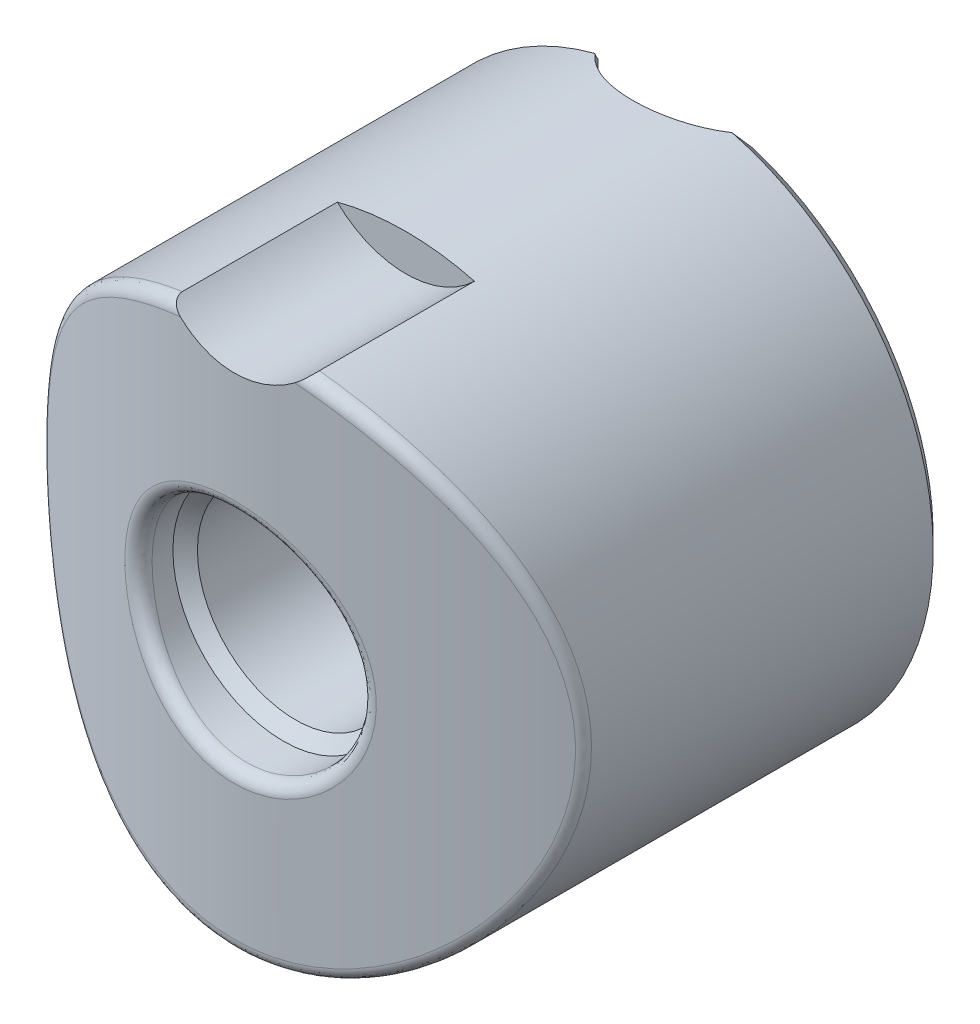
ISO-10303-21;
HEADER;
FILE_DESCRIPTION(('STEP AP214'),'2;1');
FILE_NAME('part.step','',(''),(''),'','','');
FILE_SCHEMA(('AUTOMOTIVE_DESIGN { 1 0 10303 214 1 1 1 1 }'));
ENDSEC;
DATA;
#1=APPLICATION_CONTEXT('core data for automotive mechanical design processes');
#2=APPLICATION_PROTOCOL_DEFINITION('international standard','automotive_design',2000,#1);
#3=PRODUCT_CONTEXT('',#1,'mechanical');
#4=PRODUCT('Part','Part','',(#3));
#5=PRODUCT_RELATED_PRODUCT_CATEGORY('part','',(#4));
#6=PRODUCT_DEFINITION_FORMATION('','',#4);
#7=PRODUCT_DEFINITION_CONTEXT('part definition',#1,'design');
#8=PRODUCT_DEFINITION('design','',#6,#7);
#9=PRODUCT_DEFINITION_SHAPE('','',#8);
#10=(LENGTH_UNIT() NAMED_UNIT(*) SI_UNIT(.MILLI.,.METRE.));
#11=(NAMED_UNIT(*) PLANE_ANGLE_UNIT() SI_UNIT($,.RADIAN.));
#12=(NAMED_UNIT(*) SI_UNIT($,.STERADIAN.) SOLID_ANGLE_UNIT());
#13=UNCERTAINTY_MEASURE_WITH_UNIT(LENGTH_MEASURE(1.E-05),#10,'distance_accuracy_value','');
#14=(GEOMETRIC_REPRESENTATION_CONTEXT(3) GLOBAL_UNCERTAINTY_ASSIGNED_CONTEXT((#13)) GLOBAL_UNIT_ASSIGNED_CONTEXT((#10,
#11,#12)) REPRESENTATION_CONTEXT('',''));
#15=CARTESIAN_POINT('',(0.,0.,0.));
#16=DIRECTION('',(0.,0.,1.));
#17=DIRECTION('',(1.,0.,0.));
#18=AXIS2_PLACEMENT_3D('',#15,#16,#17);
#19=CARTESIAN_POINT('',(0.,6.12361162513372,0.));
#20=DIRECTION('',(0.,-1.,0.));
#21=DIRECTION('',(1.,0.,0.));
#22=AXIS2_PLACEMENT_3D('',#19,#20,#21);
#23=TOROIDAL_SURFACE('',#22,5.5,0.5);
#24=CARTESIAN_POINT('',(0.,6.55662432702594,0.));
#25=DIRECTION('',(0.,-1.,0.));
#26=DIRECTION('',(1.,0.,0.));
#27=AXIS2_PLACEMENT_3D('',#24,#25,#26);
#28=CIRCLE('',#27,5.75);
#29=CARTESIAN_POINT('',(5.39096466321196,6.55662432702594,2.));
#30=VERTEX_POINT('',#29);
#31=CARTESIAN_POINT('',(-5.39096466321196,6.55662432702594,2.));
#32=VERTEX_POINT('',#31);
#33=EDGE_CURVE('E287',#30,#32,#28,.T.);
#34=ORIENTED_EDGE('',*,*,#33,.F.);
#35=CARTESIAN_POINT('',(5.65685424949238,6.12361162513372,2.));
#36=CARTESIAN_POINT('',(5.65688407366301,6.15054765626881,2.));
#37=CARTESIAN_POINT('',(5.65454760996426,6.17746797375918,2.));
#38=CARTESIAN_POINT('',(5.6453707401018,6.2304792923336,2.));
#39=CARTESIAN_POINT('',(5.63853892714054,6.25657177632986,2.));
#40=CARTESIAN_POINT('',(5.62059892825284,6.30723645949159,2.));
#41=CARTESIAN_POINT('',(5.60949098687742,6.33180874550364,2.));
#42=CARTESIAN_POINT('',(5.58340092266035,6.37879149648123,2.));
#43=CARTESIAN_POINT('',(5.56841916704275,6.40120216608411,2.));
#44=CARTESIAN_POINT('',(5.5346930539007,6.44380606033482,2.));
#45=CARTESIAN_POINT('',(5.51587204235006,6.46393848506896,2.));
#46=CARTESIAN_POINT('',(5.47525760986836,6.5009735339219,2.));
#47=CARTESIAN_POINT('',(5.45346117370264,6.51787283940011,2.));
#48=CARTESIAN_POINT('',(5.40626060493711,6.54893030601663,2.));
#49=CARTESIAN_POINT('',(5.38072400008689,6.56288664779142,2.));
#50=CARTESIAN_POINT('',(5.32781002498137,6.58658528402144,2.));
#51=CARTESIAN_POINT('',(5.30043556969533,6.59633407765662,2.));
#52=CARTESIAN_POINT('',(5.27248536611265,6.60388211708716,2.));
#53=B_SPLINE_CURVE_WITH_KNOTS('',3,(#35,#36,#37,#38,#39,#40,#41,#42,#43,#44,#45,#46,#47,#48,#49,
#50,#51,#52),.UNSPECIFIED.,.F.,.F.,(4,2,2,2,2,2,2,2,4),(0.,0.0806828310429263,0.161211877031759,
0.241736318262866,0.322253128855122,0.404570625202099,0.486972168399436,0.57390465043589,
0.660702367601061),.UNSPECIFIED.);
#54=CARTESIAN_POINT('',(5.65685424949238,6.12361162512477,2.));
#55=VERTEX_POINT('',#54);
#56=EDGE_CURVE('E23',#30,#55,#53,.F.);
#57=ORIENTED_EDGE('',*,*,#56,.T.);
#58=CARTESIAN_POINT('',(0.,6.12361162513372,0.));
#59=DIRECTION('',(0.,-1.,0.));
#60=DIRECTION('',(1.,0.,0.));
#61=AXIS2_PLACEMENT_3D('',#58,#59,#60);
#62=CIRCLE('',#61,6.);
#63=CARTESIAN_POINT('',(-5.65685424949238,6.12361162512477,2.));
#64=VERTEX_POINT('',#63);
#65=EDGE_CURVE('E288',#64,#55,#62,.F.);
#66=ORIENTED_EDGE('',*,*,#65,.F.);
#67=CARTESIAN_POINT('',(-5.39096466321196,6.55662432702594,2.));
#68=CARTESIAN_POINT('',(-5.41647014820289,6.54284572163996,2.));
#69=CARTESIAN_POINT('',(-5.44086154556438,6.52696502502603,2.));
#70=CARTESIAN_POINT('',(-5.48675040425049,6.4913727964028,2.));
#71=CARTESIAN_POINT('',(-5.50824135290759,6.47165287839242,2.));
#72=CARTESIAN_POINT('',(-5.54758209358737,6.42877909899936,2.));
#73=CARTESIAN_POINT('',(-5.56542484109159,6.40561874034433,2.));
#74=CARTESIAN_POINT('',(-5.59673458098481,6.35654526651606,2.));
#75=CARTESIAN_POINT('',(-5.61020777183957,6.33063612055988,2.));
#76=CARTESIAN_POINT('',(-5.63179057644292,6.27797871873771,2.));
#77=CARTESIAN_POINT('',(-5.64010696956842,6.25131522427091,2.));
#78=CARTESIAN_POINT('',(-5.65194858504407,6.1969258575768,2.));
#79=CARTESIAN_POINT('',(-5.65547169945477,6.16919952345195,2.));
#80=CARTESIAN_POINT('',(-5.65752509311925,6.11466943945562,2.));
#81=CARTESIAN_POINT('',(-5.65624780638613,6.08787270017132,2.));
#82=CARTESIAN_POINT('',(-5.64920917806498,6.03485931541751,2.));
#83=CARTESIAN_POINT('',(-5.6434452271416,6.00864301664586,2.));
#84=CARTESIAN_POINT('',(-5.63547995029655,5.9831064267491,2.));
#85=B_SPLINE_CURVE_WITH_KNOTS('',3,(#67,#68,#69,#70,#71,#72,#73,#74,#75,#76,#77,#78,#79,#80,#81,
#82,#83,#84),.UNSPECIFIED.,.F.,.F.,(4,2,2,2,2,2,2,2,4),(0.,0.0869040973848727,0.174000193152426,
0.261262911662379,0.348401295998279,0.431770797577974,0.515176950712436,0.595275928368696,
0.675421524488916),.UNSPECIFIED.);
#86=EDGE_CURVE('E9',#64,#32,#85,.F.);
#87=ORIENTED_EDGE('',*,*,#86,.T.);
#88=EDGE_LOOP('',(#34,#57,#66,#87));
#89=FACE_BOUND('',#88,.T.);
#90=ADVANCED_FACE('F14',(#89),#23,.F.);
#91=CARTESIAN_POINT('',(0.,0.,0.));
#92=DIRECTION('',(0.,-1.,0.));
#93=DIRECTION('',(1.,0.,0.));
#94=AXIS2_PLACEMENT_3D('',#91,#92,#93);
#95=CYLINDRICAL_SURFACE('',#94,6.);
#96=DIRECTION('',(0.,-1.,0.));
#97=VECTOR('',#96,1.);
#98=CARTESIAN_POINT('',(-5.65685424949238,0.,2.));
#99=LINE('',#98,#97);
#100=CARTESIAN_POINT('',(-5.65685424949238,-8.84590300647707,2.));
#101=VERTEX_POINT('',#100);
#102=EDGE_CURVE('E87',#64,#101,#99,.T.);
#103=ORIENTED_EDGE('',*,*,#102,.F.);
#104=ORIENTED_EDGE('',*,*,#65,.T.);
#105=DIRECTION('',(0.,-1.,0.));
#106=VECTOR('',#105,1.);
#107=CARTESIAN_POINT('',(5.65685424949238,0.,2.));
#108=LINE('',#107,#106);
#109=CARTESIAN_POINT('',(5.65685424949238,-8.84590300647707,2.));
#110=VERTEX_POINT('',#109);
#111=EDGE_CURVE('E96',#110,#55,#108,.F.);
#112=ORIENTED_EDGE('',*,*,#111,.F.);
#113=CARTESIAN_POINT('',(5.67435282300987,-8.77496667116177,1.9498));
#114=CARTESIAN_POINT('',(5.65702664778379,-8.84621603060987,2.00022184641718));
#115=CARTESIAN_POINT('',(5.63897843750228,-8.91734928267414,2.05056053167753));
#116=CARTESIAN_POINT('',(5.60142029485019,-9.05933693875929,2.15103872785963));
#117=CARTESIAN_POINT('',(5.58191079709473,-9.13019141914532,2.20117829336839));
#118=CARTESIAN_POINT('',(5.54140216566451,-9.27161722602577,2.30125535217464));
#119=CARTESIAN_POINT('',(5.52040303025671,-9.34218855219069,2.35119284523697));
#120=CARTESIAN_POINT('',(5.47688221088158,-9.48304058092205,2.45086060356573));
#121=CARTESIAN_POINT('',(5.45436007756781,-9.55332119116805,2.50059080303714));
#122=CARTESIAN_POINT('',(5.43106618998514,-9.62343182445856,2.55020000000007));
#123=B_SPLINE_CURVE_WITH_KNOTS('',3,(#113,#114,#115,#116,#117,#118,#119,#120,#121,#122),
.UNSPECIFIED.,.F.,.F.,(4,2,2,2,4),(0.,0.266964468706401,0.533849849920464,0.800735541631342,
1.06770032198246),.UNSPECIFIED.);
#124=CARTESIAN_POINT('',(5.45435605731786,-9.5524865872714,2.5));
#125=VERTEX_POINT('',#124);
#126=EDGE_CURVE('E108',#110,#125,#123,.T.);
#127=ORIENTED_EDGE('',*,*,#126,.T.);
#128=CARTESIAN_POINT('',(-5.45435605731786,-9.5524865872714,2.5));
#129=CARTESIAN_POINT('',(-5.38129194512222,-9.59419617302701,2.65935324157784));
#130=CARTESIAN_POINT('',(-5.30162045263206,-9.63858371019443,2.81478312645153));
#131=CARTESIAN_POINT('',(-5.1296552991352,-9.73119910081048,3.1172052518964));
#132=CARTESIAN_POINT('',(-5.03736716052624,-9.77942527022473,3.26420114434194));
#133=CARTESIAN_POINT('',(-4.74224213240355,-9.92770925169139,3.69202864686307));
#134=CARTESIAN_POINT('',(-4.52123446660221,-10.0313183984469,3.9595058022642));
#135=CARTESIAN_POINT('',(-4.15789831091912,-10.1847571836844,4.32918189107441));
#136=CARTESIAN_POINT('',(-4.03147997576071,-10.2355750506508,4.4471522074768));
#137=CARTESIAN_POINT('',(-3.76843834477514,-10.3353090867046,4.67212814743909));
#138=CARTESIAN_POINT('',(-3.63181487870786,-10.384225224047,4.77913358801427));
#139=CARTESIAN_POINT('',(-3.34910026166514,-10.4788240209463,4.98133893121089));
#140=CARTESIAN_POINT('',(-3.20301121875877,-10.5245073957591,5.07654144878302));
#141=CARTESIAN_POINT('',(-2.90216155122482,-10.6114067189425,5.25432809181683));
#142=CARTESIAN_POINT('',(-2.74740502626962,-10.6526247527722,5.33691811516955));
#143=CARTESIAN_POINT('',(-2.43248689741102,-10.7288795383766,5.48753229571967));
#144=CARTESIAN_POINT('',(-2.27244164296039,-10.7639999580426,5.55575690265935));
#145=CARTESIAN_POINT('',(-1.9459631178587,-10.8277823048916,5.67834570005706));
#146=CARTESIAN_POINT('',(-1.77953316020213,-10.8564475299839,5.73271696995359));
#147=CARTESIAN_POINT('',(-1.44161525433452,-10.9064613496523,5.8268765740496));
#148=CARTESIAN_POINT('',(-1.27013014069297,-10.9278139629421,5.86667291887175));
#149=CARTESIAN_POINT('',(-0.923547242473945,-10.9625441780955,5.93111414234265));
#150=CARTESIAN_POINT('',(-0.748449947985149,-10.9759228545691,5.95576106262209));
#151=CARTESIAN_POINT('',(-0.417019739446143,-10.9931942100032,5.98752612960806));
#152=CARTESIAN_POINT('',(-0.260897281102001,-10.9980161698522,5.99636248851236));
#153=CARTESIAN_POINT('',(0.0516210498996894,-11.0009884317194,6.00181251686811));
#154=CARTESIAN_POINT('',(0.208016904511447,-10.9991391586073,5.99842696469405));
#155=CARTESIAN_POINT('',(0.519815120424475,-10.9888180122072,5.97948022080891));
#156=CARTESIAN_POINT('',(0.675217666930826,-10.980347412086,5.96392136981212));
#157=CARTESIAN_POINT('',(0.983862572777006,-10.9570054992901,5.92083579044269));
#158=CARTESIAN_POINT('',(1.13710493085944,-10.94213418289,5.8933090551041));
#159=CARTESIAN_POINT('',(1.43315538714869,-10.9072093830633,5.82820176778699));
#160=CARTESIAN_POINT('',(1.57611452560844,-10.8874337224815,5.79115726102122));
#161=CARTESIAN_POINT('',(1.85821589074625,-10.8428533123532,5.70690234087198));
#162=CARTESIAN_POINT('',(1.9973568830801,-10.8180469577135,5.65968868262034));
#163=CARTESIAN_POINT('',(2.40781435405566,-10.7368521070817,5.50345337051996));
#164=CARTESIAN_POINT('',(2.67237295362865,-10.6736622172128,5.37979105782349));
#165=CARTESIAN_POINT('',(3.19683392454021,-10.5289982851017,5.08696070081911));
#166=CARTESIAN_POINT('',(3.45493617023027,-10.4465158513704,4.91509816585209));
#167=CARTESIAN_POINT('',(3.94014596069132,-10.2733480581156,4.53544469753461));
#168=CARTESIAN_POINT('',(4.16723666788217,-10.1826582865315,4.32763438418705));
#169=CARTESIAN_POINT('',(4.59730514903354,-9.99611590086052,3.86889067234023));
#170=CARTESIAN_POINT('',(4.79856437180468,-9.90022739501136,3.61634724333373));
#171=CARTESIAN_POINT('',(5.06887853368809,-9.76302925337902,3.21443282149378));
#172=CARTESIAN_POINT('',(5.15373156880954,-9.7183958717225,3.07658818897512));
#173=CARTESIAN_POINT('',(5.31243302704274,-9.63255755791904,2.79362463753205));
#174=CARTESIAN_POINT('',(5.3862775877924,-9.59135383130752,2.6485031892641));
#175=CARTESIAN_POINT('',(5.45435605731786,-9.5524865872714,2.5));
#176=B_SPLINE_CURVE_WITH_KNOTS('',3,(#128,#129,#130,#131,#132,#133,#134,#135,#136,#137,#138,
#139,#140,#141,#142,#143,#144,#145,#146,#147,#148,#149,#150,#151,#152,#153,#154,#155,#156,#157,
#158,#159,#160,#161,#162,#163,#164,#165,#166,#167,#168,#169,#170,#171,#172,#173,#174,#175),
.UNSPECIFIED.,.F.,.F.,(4,2,2,2,2,2,2,2,2,2,2,2,2,2,2,2,2,2,2,2,2,2,2,4),(0.,0.54010219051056,
1.07996872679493,2.16035596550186,2.70056608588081,3.24078521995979,3.78088445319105,
4.32073034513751,4.85245422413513,5.38390583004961,5.91506490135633,6.44615237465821,
6.91488851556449,7.38359480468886,7.85221099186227,8.32082745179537,8.76731855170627,
9.21395233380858,10.1065843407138,11.0654103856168,12.0247549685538,13.0309370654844,
13.5341849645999,14.037609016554),.UNSPECIFIED.);
#177=CARTESIAN_POINT('',(-5.45435605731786,-9.5524865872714,2.5));
#178=VERTEX_POINT('',#177);
#179=EDGE_CURVE('E103',#178,#125,#176,.T.);
#180=ORIENTED_EDGE('',*,*,#179,.F.);
#181=CARTESIAN_POINT('',(-5.43106618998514,-9.62343182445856,2.55020000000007));
#182=CARTESIAN_POINT('',(-5.45436007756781,-9.55332119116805,2.50059080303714));
#183=CARTESIAN_POINT('',(-5.47688221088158,-9.48304058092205,2.45086060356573));
#184=CARTESIAN_POINT('',(-5.52040303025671,-9.34218855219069,2.35119284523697));
#185=CARTESIAN_POINT('',(-5.54140216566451,-9.27161722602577,2.30125535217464));
#186=CARTESIAN_POINT('',(-5.58191079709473,-9.13019141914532,2.20117829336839));
#187=CARTESIAN_POINT('',(-5.60142029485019,-9.05933693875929,2.15103872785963));
#188=CARTESIAN_POINT('',(-5.63897843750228,-8.91734928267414,2.05056053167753));
#189=CARTESIAN_POINT('',(-5.65702664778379,-8.84621603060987,2.00022184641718));
#190=CARTESIAN_POINT('',(-5.67435282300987,-8.77496667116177,1.9498));
#191=B_SPLINE_CURVE_WITH_KNOTS('',3,(#181,#182,#183,#184,#185,#186,#187,#188,#189,#190),
.UNSPECIFIED.,.F.,.F.,(4,2,2,2,4),(0.,0.266964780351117,0.533850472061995,0.800735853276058,
1.06770032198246),.UNSPECIFIED.);
#192=EDGE_CURVE('E99',#178,#101,#191,.T.);
#193=ORIENTED_EDGE('',*,*,#192,.T.);
#194=EDGE_LOOP('',(#103,#104,#112,#127,#180,#193));
#195=FACE_BOUND('',#194,.T.);
#196=CARTESIAN_POINT('',(-5.5,0.,2.39791576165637));
#197=CARTESIAN_POINT('',(-5.49999985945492,0.0780212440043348,2.39791616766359));
#198=CARTESIAN_POINT('',(-5.49833310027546,0.156044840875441,2.40175041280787));
#199=CARTESIAN_POINT('',(-5.49173804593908,0.31121975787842,2.41679046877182));
#200=CARTESIAN_POINT('',(-5.48680928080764,0.388370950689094,2.42799734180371));
#201=CARTESIAN_POINT('',(-5.46732095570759,0.618072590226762,2.47172719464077));
#202=CARTESIAN_POINT('',(-5.44806107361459,0.768347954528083,2.51435169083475));
#203=CARTESIAN_POINT('',(-5.40494303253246,1.02428827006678,2.60546441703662));
#204=CARTESIAN_POINT('',(-5.38335718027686,1.13188382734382,2.64997721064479));
#205=CARTESIAN_POINT('',(-5.33474440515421,1.34244403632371,2.74653077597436));
#206=CARTESIAN_POINT('',(-5.30771362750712,1.44540534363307,2.79857687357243));
#207=CARTESIAN_POINT('',(-5.24857418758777,1.64729375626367,2.90797967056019));
#208=CARTESIAN_POINT('',(-5.21645143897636,1.74620868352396,2.96535091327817));
#209=CARTESIAN_POINT('',(-5.14743841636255,1.94022415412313,3.08359834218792));
#210=CARTESIAN_POINT('',(-5.11054655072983,2.03532341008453,3.14447569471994));
#211=CARTESIAN_POINT('',(-5.00029381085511,2.29800475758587,3.31883651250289));
#212=CARTESIAN_POINT('',(-4.92165638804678,2.46169834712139,3.43487363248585));
#213=CARTESIAN_POINT('',(-4.74948461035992,2.77939235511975,3.66928232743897));
#214=CARTESIAN_POINT('',(-4.6559399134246,2.93338593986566,3.78765547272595));
#215=CARTESIAN_POINT('',(-4.4539249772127,3.23186845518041,4.02325751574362));
#216=CARTESIAN_POINT('',(-4.34547196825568,3.37636807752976,4.14048756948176));
#217=CARTESIAN_POINT('',(-4.11333114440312,3.65560532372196,4.37118969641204));
#218=CARTESIAN_POINT('',(-3.9896515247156,3.79034813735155,4.48466374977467));
#219=CARTESIAN_POINT('',(-3.66132769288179,4.11350564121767,4.76032116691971));
#220=CARTESIAN_POINT('',(-3.44693538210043,4.29542496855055,4.91877367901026));
#221=CARTESIAN_POINT('',(-2.98285644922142,4.62969562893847,5.21324376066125));
#222=CARTESIAN_POINT('',(-2.73323304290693,4.78209878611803,5.34930058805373));
#223=CARTESIAN_POINT('',(-2.25406244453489,5.02252068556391,5.56538751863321));
#224=CARTESIAN_POINT('',(-2.0305984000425,5.11732472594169,5.65118269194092));
#225=CARTESIAN_POINT('',(-1.68204594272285,5.23792850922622,5.76069593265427));
#226=CARTESIAN_POINT('',(-1.56360044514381,5.2745366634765,5.79401044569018));
#227=CARTESIAN_POINT('',(-1.32289010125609,5.3399898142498,5.85365766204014));
#228=CARTESIAN_POINT('',(-1.20062694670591,5.36883819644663,5.87999341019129));
#229=CARTESIAN_POINT('',(-0.9522187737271,5.41843467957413,5.92531285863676));
#230=CARTESIAN_POINT('',(-0.826052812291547,5.43912559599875,5.94424464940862));
#231=CARTESIAN_POINT('',(-0.571642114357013,5.47171529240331,5.97407943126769));
#232=CARTESIAN_POINT('',(-0.443397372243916,5.48361404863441,5.98498240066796));
#233=CARTESIAN_POINT('',(-0.185994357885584,5.49836510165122,5.99850065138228));
#234=CARTESIAN_POINT('',(-0.0568364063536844,5.50122043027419,6.00111871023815));
#235=CARTESIAN_POINT('',(0.201251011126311,5.49783154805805,5.99801227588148));
#236=CARTESIAN_POINT('',(0.330180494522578,5.49158806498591,5.99228844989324));
#237=CARTESIAN_POINT('',(0.573036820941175,5.47127583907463,5.973679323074));
#238=CARTESIAN_POINT('',(0.687103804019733,5.45810782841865,5.96161846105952));
#239=CARTESIAN_POINT('',(0.913379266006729,5.42483542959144,5.93117153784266));
#240=CARTESIAN_POINT('',(1.02558712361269,5.40472876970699,5.91278340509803));
#241=CARTESIAN_POINT('',(1.35828237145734,5.3344455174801,5.84858397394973));
#242=CARTESIAN_POINT('',(1.57503769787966,5.27428854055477,5.79372186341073));
#243=CARTESIAN_POINT('',(2.00326929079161,5.12743397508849,5.6603529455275));
#244=CARTESIAN_POINT('',(2.21406648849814,5.03966167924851,5.58089127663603));
#245=CARTESIAN_POINT('',(2.61707586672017,4.842648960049,5.40364619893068));
#246=CARTESIAN_POINT('',(2.80928012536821,4.7333994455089,5.30585503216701));
#247=CARTESIAN_POINT('',(3.13070963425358,4.52506346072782,5.12098373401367));
#248=CARTESIAN_POINT('',(3.26408561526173,4.42967416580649,5.03683170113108));
#249=CARTESIAN_POINT('',(3.5192390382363,4.22980079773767,4.8619816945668));
#250=CARTESIAN_POINT('',(3.6410151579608,4.12531569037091,4.77128297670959));
#251=CARTESIAN_POINT('',(3.87338508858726,3.9079768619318,4.58466642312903));
#252=CARTESIAN_POINT('',(3.98394354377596,3.79509851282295,4.48873346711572));
#253=CARTESIAN_POINT('',(4.19364530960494,3.5620096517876,4.29346674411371));
#254=CARTESIAN_POINT('',(4.29279078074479,3.44180053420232,4.19413362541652));
#255=CARTESIAN_POINT('',(4.48222976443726,3.19137589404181,3.99115962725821));
#256=CARTESIAN_POINT('',(4.57224379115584,3.0609864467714,3.88747296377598));
#257=CARTESIAN_POINT('',(4.74077182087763,2.79287896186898,3.68007222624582));
#258=CARTESIAN_POINT('',(4.81928065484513,2.65515766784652,3.57635816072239));
#259=CARTESIAN_POINT('',(4.96459773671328,2.37233909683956,3.37171522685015));
#260=CARTESIAN_POINT('',(5.03143657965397,2.22726243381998,3.27077967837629));
#261=CARTESIAN_POINT('',(5.15337424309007,1.92841181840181,3.07505585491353));
#262=CARTESIAN_POINT('',(5.20848533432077,1.77464717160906,2.98026122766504));
#263=CARTESIAN_POINT('',(5.29903192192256,1.47999330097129,2.81562539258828));
#264=CARTESIAN_POINT('',(5.33617058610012,1.34055056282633,2.74416595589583));
#265=CARTESIAN_POINT('',(5.40028415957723,1.05288623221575,2.61573511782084));
#266=CARTESIAN_POINT('',(5.42727609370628,0.90467983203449,2.55873950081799));
#267=CARTESIAN_POINT('',(5.46574661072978,0.625935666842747,2.47535562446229));
#268=CARTESIAN_POINT('',(5.47910077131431,0.4967747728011,2.44537880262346));
#269=CARTESIAN_POINT('',(5.49654285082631,0.234831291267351,2.40593513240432));
#270=CARTESIAN_POINT('',(5.50065059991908,0.102057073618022,2.39642439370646));
#271=CARTESIAN_POINT('',(5.49917847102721,-0.163380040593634,2.3997991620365));
#272=CARTESIAN_POINT('',(5.49358022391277,-0.296042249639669,2.41272713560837));
#273=CARTESIAN_POINT('',(5.47327095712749,-0.557289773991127,2.45843031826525));
#274=CARTESIAN_POINT('',(5.45853931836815,-0.685865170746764,2.4912504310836));
#275=CARTESIAN_POINT('',(5.42476231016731,-0.91236647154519,2.56382875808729));
#276=CARTESIAN_POINT('',(5.40711800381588,-1.01138049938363,2.60098661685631));
#277=CARTESIAN_POINT('',(5.3671769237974,-1.20550218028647,2.68243735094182));
#278=CARTESIAN_POINT('',(5.34487670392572,-1.30060687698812,2.72673550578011));
#279=CARTESIAN_POINT('',(5.29593749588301,-1.48741631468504,2.82061279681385));
#280=CARTESIAN_POINT('',(5.26928345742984,-1.57910785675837,2.87021003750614));
#281=CARTESIAN_POINT('',(5.21194473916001,-1.75913351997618,2.97306434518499));
#282=CARTESIAN_POINT('',(5.18125853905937,-1.84746635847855,3.02632278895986));
#283=CARTESIAN_POINT('',(5.08555061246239,-2.10224208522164,3.18625202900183));
#284=CARTESIAN_POINT('',(5.01523274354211,-2.26456715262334,3.29634172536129));
#285=CARTESIAN_POINT('',(4.86063307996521,-2.57973611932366,3.52034914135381));
#286=CARTESIAN_POINT('',(4.77634005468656,-2.73257225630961,3.63426988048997));
#287=CARTESIAN_POINT('',(4.59383283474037,-3.02935971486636,3.86238670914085));
#288=CARTESIAN_POINT('',(4.49562471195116,-3.17331487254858,3.97658265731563));
#289=CARTESIAN_POINT('',(4.28507118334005,-3.45234581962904,4.20262143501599));
#290=CARTESIAN_POINT('',(4.17273270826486,-3.58742591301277,4.31446538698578));
#291=CARTESIAN_POINT('',(3.95583345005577,-3.82388352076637,4.51318020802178));
#292=CARTESIAN_POINT('',(3.85371964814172,-3.92685299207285,4.60082320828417));
#293=CARTESIAN_POINT('',(3.63975733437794,-4.12596035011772,4.77189265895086));
#294=CARTESIAN_POINT('',(3.52790644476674,-4.22209655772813,4.85531807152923));
#295=CARTESIAN_POINT('',(3.17798519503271,-4.49873460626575,5.09711110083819));
#296=CARTESIAN_POINT('',(2.9249967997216,-4.66807497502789,5.24751425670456));
#297=CARTESIAN_POINT('',(2.44209425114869,-4.9339690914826,5.48556525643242));
#298=CARTESIAN_POINT('',(2.21973057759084,-5.03832934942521,5.57972236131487));
#299=CARTESIAN_POINT('',(1.87130867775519,-5.17337078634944,5.7020527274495));
#300=CARTESIAN_POINT('',(1.75265111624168,-5.21481057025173,5.73968701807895));
#301=CARTESIAN_POINT('',(1.51097014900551,-5.28989200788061,5.80798704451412));
#302=CARTESIAN_POINT('',(1.38794871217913,-5.32353712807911,5.8386558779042));
#303=CARTESIAN_POINT('',(1.13730197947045,-5.38268115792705,5.89263177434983));
#304=CARTESIAN_POINT('',(1.00964803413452,-5.40811375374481,5.91587889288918));
#305=CARTESIAN_POINT('',(0.751645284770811,-5.4499636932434,5.95416094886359));
#306=CARTESIAN_POINT('',(0.621296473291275,-5.466381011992,5.96919586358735));
#307=CARTESIAN_POINT('',(0.359117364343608,-5.48984045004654,5.9906866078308));
#308=CARTESIAN_POINT('',(0.227287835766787,-5.49688722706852,5.99714669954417));
#309=CARTESIAN_POINT('',(-0.0366680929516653,-5.50146101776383,6.00133920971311));
#310=CARTESIAN_POINT('',(-0.168794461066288,-5.49898901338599,5.99907252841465));
#311=CARTESIAN_POINT('',(-0.416310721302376,-5.48544993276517,5.98666477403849));
#312=CARTESIAN_POINT('',(-0.531810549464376,-5.47544729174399,5.97749891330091));
#313=CARTESIAN_POINT('',(-0.761289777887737,-5.44828336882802,5.9526264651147));
#314=CARTESIAN_POINT('',(-0.875268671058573,-5.43111975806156,5.93691774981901));
#315=CARTESIAN_POINT('',(-1.10088425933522,-5.38991621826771,5.89924799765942));
#316=CARTESIAN_POINT('',(-1.21252169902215,-5.36587851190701,5.87728898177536));
#317=CARTESIAN_POINT('',(-1.43286997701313,-5.31128885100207,5.8274922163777));
#318=CARTESIAN_POINT('',(-1.54157968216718,-5.28073441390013,5.79965222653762));
#319=CARTESIAN_POINT('',(-1.86757258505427,-5.17829846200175,5.70648282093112));
#320=CARTESIAN_POINT('',(-2.0794014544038,-5.09663435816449,5.63241382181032));
#321=CARTESIAN_POINT('',(-2.48524675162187,-4.91156162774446,5.46551332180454));
#322=CARTESIAN_POINT('',(-2.679254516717,-4.80814250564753,5.37267276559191));
#323=CARTESIAN_POINT('',(-3.00258375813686,-4.61096282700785,5.19706627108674));
#324=CARTESIAN_POINT('',(-3.13606211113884,-4.5211053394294,5.11745807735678));
#325=CARTESIAN_POINT('',(-3.39201536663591,-4.33238010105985,4.951514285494));
#326=CARTESIAN_POINT('',(-3.51448913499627,-4.23351142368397,4.86517799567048));
#327=CARTESIAN_POINT('',(-3.74873005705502,-4.02758094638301,4.6870807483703));
#328=CARTESIAN_POINT('',(-3.8604702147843,-3.92049964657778,4.59530700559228));
#329=CARTESIAN_POINT('',(-4.07305740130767,-3.69915517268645,4.40797792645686));
#330=CARTESIAN_POINT('',(-4.17390607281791,-3.58489308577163,4.31242316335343));
#331=CARTESIAN_POINT('',(-4.36720546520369,-3.34687630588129,4.11665886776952));
#332=CARTESIAN_POINT('',(-4.45940010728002,-3.22296069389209,4.0163926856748));
#333=CARTESIAN_POINT('',(-4.63283728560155,-2.96826044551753,3.81503242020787));
#334=CARTESIAN_POINT('',(-4.71407671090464,-2.83747387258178,3.71393811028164));
#335=CARTESIAN_POINT('',(-4.86556588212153,-2.56904513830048,3.513125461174));
#336=CARTESIAN_POINT('',(-4.93583237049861,-2.43141385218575,3.41340524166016));
#337=CARTESIAN_POINT('',(-5.06540591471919,-2.14845871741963,3.21797717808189));
#338=CARTESIAN_POINT('',(-5.12472002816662,-2.00313990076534,3.12226678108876));
#339=CARTESIAN_POINT('',(-5.23230121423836,-1.7025465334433,2.93843540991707));
#340=CARTESIAN_POINT('',(-5.28050622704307,-1.54722197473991,2.85035870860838));
#341=CARTESIAN_POINT('',(-5.36429610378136,-1.22553537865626,2.68933292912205));
#342=CARTESIAN_POINT('',(-5.39989426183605,-1.05918518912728,2.616367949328));
#343=CARTESIAN_POINT('',(-5.45118779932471,-0.744992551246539,2.50750875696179));
#344=CARTESIAN_POINT('',(-5.46929894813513,-0.599131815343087,2.46732628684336));
#345=CARTESIAN_POINT('',(-5.4876147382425,-0.376356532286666,2.42616899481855));
#346=CARTESIAN_POINT('',(-5.49224452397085,-0.301542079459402,2.41563741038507));
#347=CARTESIAN_POINT('',(-5.49843643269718,-0.151152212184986,2.40151238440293));
#348=CARTESIAN_POINT('',(-5.50000013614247,-0.0755772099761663,2.39791536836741));
#349=CARTESIAN_POINT('',(-5.5,0.,2.39791576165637));
#350=B_SPLINE_CURVE_WITH_KNOTS('',3,(#196,#197,#198,#199,#200,#201,#202,#203,#204,#205,#206,
#207,#208,#209,#210,#211,#212,#213,#214,#215,#216,#217,#218,#219,#220,#221,#222,#223,#224,#225,
#226,#227,#228,#229,#230,#231,#232,#233,#234,#235,#236,#237,#238,#239,#240,#241,#242,#243,#244,
#245,#246,#247,#248,#249,#250,#251,#252,#253,#254,#255,#256,#257,#258,#259,#260,#261,#262,#263,
#264,#265,#266,#267,#268,#269,#270,#271,#272,#273,#274,#275,#276,#277,#278,#279,#280,#281,#282,
#283,#284,#285,#286,#287,#288,#289,#290,#291,#292,#293,#294,#295,#296,#297,#298,#299,#300,#301,
#302,#303,#304,#305,#306,#307,#308,#309,#310,#311,#312,#313,#314,#315,#316,#317,#318,#319,#320,
#321,#322,#323,#324,#325,#326,#327,#328,#329,#330,#331,#332,#333,#334,#335,#336,#337,#338,#339,
#340,#341,#342,#343,#344,#345,#346,#347,#348,#349),.UNSPECIFIED.,.T.,.F.,(4,2,2,2,2,2,2,2,2,2,2,
2,2,2,2,2,2,2,2,2,2,2,2,2,2,2,2,2,2,2,2,2,2,2,2,2,2,2,2,2,2,2,2,2,2,2,2,2,2,2,2,2,2,2,2,2,2,2,2,
2,2,2,2,2,2,2,2,2,2,2,2,2,2,2,2,2,4),(0.,0.233955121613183,0.467943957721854,0.937463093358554,
1.29229646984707,1.6473819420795,2.00346743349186,2.35967207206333,3.0052948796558,
3.65136755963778,4.29669972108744,4.94168606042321,5.90632521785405,6.86925500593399,
7.63823538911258,8.02294257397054,8.40748163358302,8.79467035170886,9.18186011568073,
9.56892005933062,9.95594904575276,10.3019063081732,10.647976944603,11.3395324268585,
12.0622798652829,12.7853338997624,13.3375570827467,13.8898431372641,14.4438190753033,
14.9976899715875,15.5652557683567,16.1330757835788,16.6993840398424,17.2650968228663,
17.7473622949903,18.2288149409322,18.6270067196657,19.0243437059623,19.4224334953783,
19.8214252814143,20.1426249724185,20.464063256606,20.7866371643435,21.1093330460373,
21.7334822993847,22.3581355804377,22.9825171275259,23.6065936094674,24.1144603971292,
24.6224515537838,25.6355518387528,26.4214354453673,26.8146113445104,27.2076120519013,
27.6037110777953,27.999811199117,28.3957143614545,28.7915766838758,29.1400462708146,
29.4886292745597,29.8370996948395,30.1857031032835,30.8991836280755,31.6130091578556,
32.1508779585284,32.6888021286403,33.2280456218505,33.7672076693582,34.3191642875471,
34.8712773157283,35.4225395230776,35.9734452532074,36.5273577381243,37.0806843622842,
37.5354448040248,37.762188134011,37.9888145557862),.UNSPECIFIED.);
#351=CARTESIAN_POINT('',(-5.5,0.,2.39791576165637));
#352=VERTEX_POINT('',#351);
#353=EDGE_CURVE('E345',#352,#352,#350,.T.);
#354=ORIENTED_EDGE('',*,*,#353,.F.);
#355=EDGE_LOOP('',(#354));
#356=FACE_BOUND('',#355,.T.);
#357=ADVANCED_FACE('F100',(#195,#356),#95,.F.);
#358=CARTESIAN_POINT('',(0.,0.,2.));
#359=DIRECTION('',(0.,0.,1.));
#360=DIRECTION('',(1.,0.,0.));
#361=AXIS2_PLACEMENT_3D('',#358,#359,#360);
#362=PLANE('',#361);
#363=ORIENTED_EDGE('',*,*,#56,.F.);
#364=CARTESIAN_POINT('',(29.4634628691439,-7.17349573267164,2.));
#365=CARTESIAN_POINT('',(28.4276178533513,-6.57683504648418,2.));
#366=CARTESIAN_POINT('',(27.3917198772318,-5.98026623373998,2.));
#367=CARTESIAN_POINT('',(25.319730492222,-4.78742555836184,2.));
#368=CARTESIAN_POINT('',(24.2836390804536,-4.19115370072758,2.));
#369=CARTESIAN_POINT('',(22.2107394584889,-2.99876946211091,2.));
#370=CARTESIAN_POINT('',(21.173931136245,-2.40265727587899,2.));
#371=CARTESIAN_POINT('',(19.0999499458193,-1.21110542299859,2.));
#372=CARTESIAN_POINT('',(18.0627770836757,-0.615665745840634,2.));
#373=CARTESIAN_POINT('',(16.0153211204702,0.558371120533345,2.));
#374=CARTESIAN_POINT('',(15.005054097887,1.13699632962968,2.));
#375=CARTESIAN_POINT('',(13.4888409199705,2.00356928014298,2.));
#376=CARTESIAN_POINT('',(12.9832888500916,2.29220641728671,2.));
#377=CARTESIAN_POINT('',(11.9718134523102,2.86882459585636,2.));
#378=CARTESIAN_POINT('',(11.46589012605,3.15680564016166,2.));
#379=CARTESIAN_POINT('',(10.4536515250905,3.73172730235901,2.));
#380=CARTESIAN_POINT('',(9.94733641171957,4.01866820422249,2.));
#381=CARTESIAN_POINT('',(8.93387305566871,4.59109771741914,2.));
#382=CARTESIAN_POINT('',(8.42672479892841,4.87658630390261,2.));
#383=CARTESIAN_POINT('',(7.66499639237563,5.30297317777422,2.));
#384=CARTESIAN_POINT('',(7.41092982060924,5.4447886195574,2.));
#385=CARTESIAN_POINT('',(6.90233669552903,5.72759190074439,2.));
#386=CARTESIAN_POINT('',(6.64781014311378,5.86857974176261,2.));
#387=CARTESIAN_POINT('',(6.13813842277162,6.14941666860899,2.));
#388=CARTESIAN_POINT('',(5.88299327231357,6.28926578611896,2.));
#389=CARTESIAN_POINT('',(5.37182726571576,6.56735296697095,2.));
#390=CARTESIAN_POINT('',(5.11580641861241,6.70559104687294,2.));
#391=CARTESIAN_POINT('',(4.74703731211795,6.90247013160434,2.));
#392=CARTESIAN_POINT('',(4.63481131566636,6.96208923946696,2.));
#393=CARTESIAN_POINT('',(4.41006039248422,7.08076327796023,2.));
#394=CARTESIAN_POINT('',(4.29753546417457,7.13981820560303,2.));
#395=CARTESIAN_POINT('',(4.07210791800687,7.25724725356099,2.));
#396=CARTESIAN_POINT('',(3.95920524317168,7.31562126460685,2.));
#397=CARTESIAN_POINT('',(3.73296054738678,7.43151151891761,2.));
#398=CARTESIAN_POINT('',(3.61961852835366,7.48902776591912,2.));
#399=CARTESIAN_POINT('',(3.3914650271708,7.60344526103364,2.));
#400=CARTESIAN_POINT('',(3.27664910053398,7.66033766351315,2.));
#401=CARTESIAN_POINT('',(3.04633056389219,7.77271410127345,2.));
#402=CARTESIAN_POINT('',(2.93082796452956,7.82819815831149,2.));
#403=CARTESIAN_POINT('',(2.69897789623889,7.93731913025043,2.));
#404=CARTESIAN_POINT('',(2.5826305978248,7.9909564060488,2.));
#405=CARTESIAN_POINT('',(2.34884326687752,8.09578549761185,2.));
#406=CARTESIAN_POINT('',(2.23140330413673,8.14697746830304,2.));
#407=CARTESIAN_POINT('',(1.98438079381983,8.25056568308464,2.));
#408=CARTESIAN_POINT('',(1.85466534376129,8.30264798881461,2.));
#409=CARTESIAN_POINT('',(1.5930723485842,8.40125491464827,2.));
#410=CARTESIAN_POINT('',(1.46119429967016,8.44777821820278,2.));
#411=CARTESIAN_POINT('',(1.196400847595,8.53234575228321,2.));
#412=CARTESIAN_POINT('',(1.0635158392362,8.57048318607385,2.));
#413=CARTESIAN_POINT('',(0.795049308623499,8.63577539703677,2.));
#414=CARTESIAN_POINT('',(0.659469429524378,8.66293666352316,2.));
#415=CARTESIAN_POINT('',(0.412019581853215,8.69906242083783,2.));
#416=CARTESIAN_POINT('',(0.300518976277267,8.71049802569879,2.));
#417=CARTESIAN_POINT('',(0.07695248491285,8.72261749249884,2.));
#418=CARTESIAN_POINT('',(-0.0351131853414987,8.72330518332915,2.));
#419=CARTESIAN_POINT('',(-0.259566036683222,8.71381218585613,2.));
#420=CARTESIAN_POINT('',(-0.371949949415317,8.703555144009,2.));
#421=CARTESIAN_POINT('',(-0.539486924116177,8.68083090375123,2.));
#422=CARTESIAN_POINT('',(-0.595172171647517,8.67203016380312,2.));
#423=CARTESIAN_POINT('',(-0.706142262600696,8.6522066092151,2.));
#424=CARTESIAN_POINT('',(-0.761427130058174,8.6411839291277,2.));
#425=CARTESIAN_POINT('',(-0.996209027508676,8.58996079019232,2.));
#426=CARTESIAN_POINT('',(-1.17364341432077,8.54018522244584,2.));
#427=CARTESIAN_POINT('',(-1.43641620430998,8.45535203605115,2.));
#428=CARTESIAN_POINT('',(-1.52352091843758,8.42534771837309,2.));
#429=CARTESIAN_POINT('',(-1.69675182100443,8.36262681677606,2.));
#430=CARTESIAN_POINT('',(-1.78287810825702,8.32991050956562,2.));
#431=CARTESIAN_POINT('',(-2.04080829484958,8.22826251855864,2.));
#432=CARTESIAN_POINT('',(-2.21133375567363,8.1561121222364,2.));
#433=CARTESIAN_POINT('',(-2.54984116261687,8.00645634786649,2.));
#434=CARTESIAN_POINT('',(-2.71782472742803,7.9289545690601,2.));
#435=CARTESIAN_POINT('',(-3.05637407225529,7.76831702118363,2.));
#436=CARTESIAN_POINT('',(-3.22689522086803,7.6850876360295,2.));
#437=CARTESIAN_POINT('',(-3.56667253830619,7.51603875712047,2.));
#438=CARTESIAN_POINT('',(-3.73592852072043,7.43021889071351,2.));
#439=CARTESIAN_POINT('',(-4.07296107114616,7.2570287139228,2.));
#440=CARTESIAN_POINT('',(-4.24074063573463,7.16966422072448,2.));
#441=CARTESIAN_POINT('',(-4.57558933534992,6.99360825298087,2.));
#442=CARTESIAN_POINT('',(-4.74265850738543,6.9049168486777,2.));
#443=CARTESIAN_POINT('',(-5.25065589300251,6.63331164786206,2.));
#444=CARTESIAN_POINT('',(-5.5907446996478,6.44882943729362,2.));
#445=CARTESIAN_POINT('',(-6.26959241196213,6.07743140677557,2.));
#446=CARTESIAN_POINT('',(-6.60835129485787,5.8905155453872,2.));
#447=CARTESIAN_POINT('',(-7.28501269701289,5.51509475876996,2.));
#448=CARTESIAN_POINT('',(-7.62291516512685,5.32658974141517,2.));
#449=CARTESIAN_POINT('',(-8.2981190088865,4.94850569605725,2.));
#450=CARTESIAN_POINT('',(-8.63542038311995,4.75892666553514,2.));
#451=CARTESIAN_POINT('',(-9.64770109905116,4.18849907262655,2.));
#452=CARTESIAN_POINT('',(-10.3220454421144,3.80652414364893,2.));
#453=CARTESIAN_POINT('',(-11.6697826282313,3.04095005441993,2.));
#454=CARTESIAN_POINT('',(-12.3431754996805,2.65735094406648,2.));
#455=CARTESIAN_POINT('',(-13.6141773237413,1.9320485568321,2.));
#456=CARTESIAN_POINT('',(-14.2118476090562,1.59045274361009,2.));
#457=CARTESIAN_POINT('',(-15.4068787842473,0.90670701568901,2.));
#458=CARTESIAN_POINT('',(-16.0042396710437,0.564557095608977,2.));
#459=CARTESIAN_POINT('',(-17.1978302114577,-0.119615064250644,2.));
#460=CARTESIAN_POINT('',(-17.7940602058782,-0.461636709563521,2.));
#461=CARTESIAN_POINT('',(-18.9863445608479,-1.14597179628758,2.));
#462=CARTESIAN_POINT('',(-19.5823989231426,-1.48828523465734,2.));
#463=CARTESIAN_POINT('',(-20.1783958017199,-1.83069861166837,2.));
#464=B_SPLINE_CURVE_WITH_KNOTS('',3,(#364,#365,#366,#367,#368,#369,#370,#371,#372,#373,#374,
#375,#376,#377,#378,#379,#380,#381,#382,#383,#384,#385,#386,#387,#388,#389,#390,#391,#392,#393,
#394,#395,#396,#397,#398,#399,#400,#401,#402,#403,#404,#405,#406,#407,#408,#409,#410,#411,#412,
#413,#414,#415,#416,#417,#418,#419,#420,#421,#422,#423,#424,#425,#426,#427,#428,#429,#430,#431,
#432,#433,#434,#435,#436,#437,#438,#439,#440,#441,#442,#443,#444,#445,#446,#447,#448,#449,#450,
#451,#452,#453,#454,#455,#456,#457,#458,#459,#460,#461,#462,#463),.UNSPECIFIED.,.F.,.F.,(4,2,2,
2,2,2,2,2,2,2,2,2,2,2,2,2,2,2,2,2,2,2,2,2,2,2,2,2,2,2,2,2,2,2,2,2,2,2,2,2,2,2,2,2,2,2,2,2,2,4),
(0.,3.58619717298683,7.17245281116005,10.7603337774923,14.3481578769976,17.8408660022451,
19.5873045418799,21.3337354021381,23.079646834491,24.8255880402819,25.6984861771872,
26.5713826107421,27.4442546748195,28.3171177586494,28.6983540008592,29.0795922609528,
29.4608908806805,29.8421878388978,30.2265955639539,30.6109973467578,30.9953235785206,
31.379625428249,31.7988801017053,32.2182338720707,32.6326603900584,33.0468415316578,
33.3826299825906,33.7182988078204,34.056324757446,34.2254158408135,34.3944966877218,
34.9462499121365,35.2226247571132,35.4989714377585,36.0542886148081,36.609235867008,
37.1784491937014,37.7477447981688,38.3152249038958,38.8826750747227,40.0433643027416,
41.2040733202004,42.3648500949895,43.5256295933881,45.8506633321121,48.1756261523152,
50.240832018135,52.3060580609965,54.3681494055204,56.4302195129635),.UNSPECIFIED.);
#465=CARTESIAN_POINT('',(3.17214438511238,7.71132486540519,2.));
#466=VERTEX_POINT('',#465);
#467=EDGE_CURVE('E276',#30,#466,#464,.T.);
#468=ORIENTED_EDGE('',*,*,#467,.T.);
#469=DIRECTION('',(0.,-1.,0.));
#470=VECTOR('',#469,1.);
#471=CARTESIAN_POINT('',(3.17214438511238,30.,2.));
#472=LINE('',#471,#470);
#473=CARTESIAN_POINT('',(3.17214438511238,10.0093706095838,2.));
#474=VERTEX_POINT('',#473);
#475=EDGE_CURVE('E267',#474,#466,#472,.T.);
#476=ORIENTED_EDGE('',*,*,#475,.F.);
#477=CARTESIAN_POINT('',(0.,0.,2.));
#478=DIRECTION('',(0.,0.,1.));
#479=DIRECTION('',(1.,0.,0.));
#480=AXIS2_PLACEMENT_3D('',#477,#478,#479);
#481=CIRCLE('',#480,10.5);
#482=EDGE_CURVE('E113',#474,#110,#481,.F.);
#483=ORIENTED_EDGE('',*,*,#482,.T.);
#484=ORIENTED_EDGE('',*,*,#111,.T.);
#485=EDGE_LOOP('',(#363,#468,#476,#483,#484));
#486=FACE_BOUND('',#485,.T.);
#487=ADVANCED_FACE('F339',(#486),#362,.F.);
#488=CARTESIAN_POINT('',(0.,0.,2.));
#489=DIRECTION('',(0.,0.,1.));
#490=DIRECTION('',(1.,0.,0.));
#491=AXIS2_PLACEMENT_3D('',#488,#489,#490);
#492=CONICAL_SURFACE('',#491,10.5,0.785398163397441);
#493=ORIENTED_EDGE('',*,*,#192,.F.);
#494=CARTESIAN_POINT('',(0.,0.,2.5));
#495=DIRECTION('',(0.,0.,1.));
#496=DIRECTION('',(1.,0.,0.));
#497=AXIS2_PLACEMENT_3D('',#494,#495,#496);
#498=CIRCLE('',#497,11.);
#499=CARTESIAN_POINT('',(-2.79508497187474,10.6389614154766,2.5));
#500=VERTEX_POINT('',#499);
#501=EDGE_CURVE('E160',#500,#178,#498,.T.);
#502=ORIENTED_EDGE('',*,*,#501,.F.);
#503=CARTESIAN_POINT('',(-3.17214438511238,10.0093706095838,2.));
#504=CARTESIAN_POINT('',(-3.14497828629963,10.0631757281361,2.04308434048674));
#505=CARTESIAN_POINT('',(-3.11678513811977,10.1167151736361,2.08585801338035));
#506=CARTESIAN_POINT('',(-3.05831468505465,10.2231147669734,2.17068309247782));
#507=CARTESIAN_POINT('',(-3.02803961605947,10.2759755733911,2.21273521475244));
#508=CARTESIAN_POINT('',(-2.96531741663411,10.3809852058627,2.29610848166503));
#509=CARTESIAN_POINT('',(-2.93287024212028,10.4331340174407,2.33742961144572));
#510=CARTESIAN_POINT('',(-2.86569823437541,10.5366649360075,2.41931335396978));
#511=CARTESIAN_POINT('',(-2.83097102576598,10.5880461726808,2.45987511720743));
#512=CARTESIAN_POINT('',(-2.79508497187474,10.6389614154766,2.5));
#513=B_SPLINE_CURVE_WITH_KNOTS('',3,(#503,#504,#505,#506,#507,#508,#509,#510,#511,#512),
.UNSPECIFIED.,.F.,.F.,(4,2,2,2,4),(0.,0.222264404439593,0.444293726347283,0.666327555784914,
0.888596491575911),.UNSPECIFIED.);
#514=CARTESIAN_POINT('',(-3.17214438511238,10.0093706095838,2.));
#515=VERTEX_POINT('',#514);
#516=EDGE_CURVE('E111',#515,#500,#513,.T.);
#517=ORIENTED_EDGE('',*,*,#516,.F.);
#518=EDGE_CURVE('E92',#101,#515,#481,.F.);
#519=ORIENTED_EDGE('',*,*,#518,.F.);
#520=EDGE_LOOP('',(#493,#502,#517,#519));
#521=FACE_BOUND('',#520,.T.);
#522=ADVANCED_FACE('F110',(#521),#492,.T.);
#523=ORIENTED_EDGE('',*,*,#86,.F.);
#524=ORIENTED_EDGE('',*,*,#102,.T.);
#525=ORIENTED_EDGE('',*,*,#518,.T.);
#526=DIRECTION('',(0.,-1.,0.));
#527=VECTOR('',#526,1.);
#528=CARTESIAN_POINT('',(-3.17214438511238,30.,2.));
#529=LINE('',#528,#527);
#530=CARTESIAN_POINT('',(-3.17214438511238,7.71132486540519,2.));
#531=VERTEX_POINT('',#530);
#532=EDGE_CURVE('E269',#531,#515,#529,.F.);
#533=ORIENTED_EDGE('',*,*,#532,.F.);
#534=EDGE_CURVE('E95',#531,#32,#464,.T.);
#535=ORIENTED_EDGE('',*,*,#534,.T.);
#536=EDGE_LOOP('',(#523,#524,#525,#533,#535));
#537=FACE_BOUND('',#536,.T.);
#538=ADVANCED_FACE('F89',(#537),#362,.F.);
#539=CARTESIAN_POINT('',(0.,0.,0.));
#540=DIRECTION('',(0.,0.,-1.));
#541=DIRECTION('',(-1.,0.,0.));
#542=AXIS2_PLACEMENT_3D('',#539,#540,#541);
#543=CYLINDRICAL_SURFACE('',#542,11.);
#544=CARTESIAN_POINT('',(0.,0.,13.));
#545=DIRECTION('',(0.,0.,-1.));
#546=DIRECTION('',(-1.,0.,0.));
#547=AXIS2_PLACEMENT_3D('',#544,#545,#546);
#548=CIRCLE('',#547,11.);
#549=CARTESIAN_POINT('',(-2.7953610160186,10.6388888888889,13.));
#550=VERTEX_POINT('',#549);
#551=CARTESIAN_POINT('',(2.7953610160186,10.6388888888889,13.));
#552=VERTEX_POINT('',#551);
#553=EDGE_CURVE('E114',#550,#552,#548,.T.);
#554=ORIENTED_EDGE('',*,*,#553,.T.);
#555=DIRECTION('',(0.,0.,-1.));
#556=VECTOR('',#555,1.);
#557=CARTESIAN_POINT('',(2.7953610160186,10.6388888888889,27.7656374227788));
#558=LINE('',#557,#556);
#559=CARTESIAN_POINT('',(2.7953610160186,10.6388888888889,19.3165778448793));
#560=VERTEX_POINT('',#559);
#561=EDGE_CURVE('E264',#552,#560,#558,.F.);
#562=ORIENTED_EDGE('',*,*,#561,.T.);
#563=CARTESIAN_POINT('',(-10.6865408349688,-1.29868255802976,16.9055566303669));
#564=CARTESIAN_POINT('',(-10.9182089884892,-1.33909625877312,16.7591118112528));
#565=CARTESIAN_POINT('',(-10.9155381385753,-1.36052458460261,16.4829177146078));
#566=CARTESIAN_POINT('',(-10.7214413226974,-1.02568715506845,16.8834940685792));
#567=CARTESIAN_POINT('',(-10.9526986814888,-1.05783397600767,16.7366404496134));
#568=CARTESIAN_POINT('',(-10.9511864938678,-1.0745294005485,16.461406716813));
#569=CARTESIAN_POINT('',(-10.7453858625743,-0.750853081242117,16.8682215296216));
#570=CARTESIAN_POINT('',(-10.9764131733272,-0.774240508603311,16.7210526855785));
#571=CARTESIAN_POINT('',(-10.9756441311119,-0.786607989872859,16.4465159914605));
#572=CARTESIAN_POINT('',(-10.770994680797,-0.199806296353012,16.8518817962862));
#573=CARTESIAN_POINT('',(-11.0017391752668,-0.206101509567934,16.7043999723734));
#574=CARTESIAN_POINT('',(-11.0018017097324,-0.209320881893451,16.4305847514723));
#575=CARTESIAN_POINT('',(-10.7726610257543,0.076406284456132,16.850813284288));
#576=CARTESIAN_POINT('',(-11.0033894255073,0.0788539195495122,16.7033095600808));
#577=CARTESIAN_POINT('',(-11.0035037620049,0.0800446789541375,16.4295429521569));
#578=CARTESIAN_POINT('',(-10.7536882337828,0.62776582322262,16.8629270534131));
#579=CARTESIAN_POINT('',(-10.9846264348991,0.64729779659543,16.715655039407));
#580=CARTESIAN_POINT('',(-10.9841244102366,0.657659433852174,16.4413538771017));
#581=CARTESIAN_POINT('',(-10.733051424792,0.902912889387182,16.8761078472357));
#582=CARTESIAN_POINT('',(-10.9641882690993,0.931197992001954,16.7291073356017));
#583=CARTESIAN_POINT('',(-10.9630453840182,0.945908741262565,16.4542051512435));
#584=CARTESIAN_POINT('',(-10.6698095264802,1.44982262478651,16.9161626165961));
#585=CARTESIAN_POINT('',(-10.9016259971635,1.49526018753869,16.7699456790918));
#586=CARTESIAN_POINT('',(-10.8984483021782,1.51886179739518,16.4932585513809));
#587=CARTESIAN_POINT('',(-10.6272047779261,1.72158534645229,16.9430363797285));
#588=CARTESIAN_POINT('',(-10.8594132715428,1.77581453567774,16.7973891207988));
#589=CARTESIAN_POINT('',(-10.8549305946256,1.80356560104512,16.5194604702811));
#590=CARTESIAN_POINT('',(-10.5255309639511,2.23501141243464,17.0063643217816));
#591=CARTESIAN_POINT('',(-10.7587845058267,2.30566132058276,16.862000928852));
#592=CARTESIAN_POINT('',(-10.7510780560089,2.3414405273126,16.5812052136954));
#593=CARTESIAN_POINT('',(-10.4683207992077,2.47715704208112,17.0417194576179));
#594=CARTESIAN_POINT('',(-10.7020730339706,2.55582425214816,16.8981321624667));
#595=CARTESIAN_POINT('',(-10.6926419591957,2.59511690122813,16.6156764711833));
#596=CARTESIAN_POINT('',(-10.3369167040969,2.95556342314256,17.1217419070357));
#597=CARTESIAN_POINT('',(-10.5718855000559,3.05012922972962,16.9798875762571));
#598=CARTESIAN_POINT('',(-10.5584220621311,3.09630453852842,16.6936983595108));
#599=CARTESIAN_POINT('',(-10.2627172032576,3.19182221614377,17.1664122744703));
#600=CARTESIAN_POINT('',(-10.4982650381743,3.29450082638,17.0255977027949));
#601=CARTESIAN_POINT('',(-10.4826325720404,3.34381375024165,16.7372519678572));
#602=CARTESIAN_POINT('',(-10.0156869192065,3.88986218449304,17.3125034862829));
#603=CARTESIAN_POINT('',(-10.2525843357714,4.01859638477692,17.175476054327));
#604=CARTESIAN_POINT('',(-10.2303087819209,4.07509371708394,16.8796908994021));
#605=CARTESIAN_POINT('',(-9.81836257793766,4.34121374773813,17.4260449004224));
#606=CARTESIAN_POINT('',(-10.0559184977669,4.48698256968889,17.2922126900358));
#607=CARTESIAN_POINT('',(-10.028756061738,4.54793821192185,16.9903937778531));
#608=CARTESIAN_POINT('',(-9.34071417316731,5.2533942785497,17.6870641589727));
#609=CARTESIAN_POINT('',(-9.58026737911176,5.43509200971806,17.5606332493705));
#610=CARTESIAN_POINT('',(-9.54087233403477,5.50355591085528,17.2448875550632));
#611=CARTESIAN_POINT('',(-9.05389198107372,5.71032623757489,17.8368434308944));
#612=CARTESIAN_POINT('',(-9.29325986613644,5.91125499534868,17.7153714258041));
#613=CARTESIAN_POINT('',(-9.24790395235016,5.98224653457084,17.3909223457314));
#614=CARTESIAN_POINT('',(-8.41463120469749,6.57451991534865,18.1471905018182));
#615=CARTESIAN_POINT('',(-8.65382971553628,6.81422091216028,18.03644349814));
#616=CARTESIAN_POINT('',(-8.59494473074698,6.88759229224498,17.6935107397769));
#617=CARTESIAN_POINT('',(-8.06214590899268,6.98174593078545,18.3077659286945));
#618=CARTESIAN_POINT('',(-8.29931070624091,7.24111098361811,18.2033992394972));
#619=CARTESIAN_POINT('',(-8.23490617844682,7.31421002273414,17.8500717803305));
#620=CARTESIAN_POINT('',(-7.24549900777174,7.79156498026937,18.6473270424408));
#621=CARTESIAN_POINT('',(-7.47580413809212,8.09506576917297,18.5582156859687));
#622=CARTESIAN_POINT('',(-7.40075970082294,8.16259188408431,18.181143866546));
#623=CARTESIAN_POINT('',(-6.7726936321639,8.18616904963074,18.8258842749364));
#624=CARTESIAN_POINT('',(-6.99684402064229,8.51187910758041,18.7454363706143));
#625=CARTESIAN_POINT('',(-6.91782278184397,8.57598662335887,18.3552371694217));
#626=CARTESIAN_POINT('',(-6.01305142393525,8.71613206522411,19.0765526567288));
#627=CARTESIAN_POINT('',(-6.22906819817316,9.07268019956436,19.0085922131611));
#628=CARTESIAN_POINT('',(-6.14190252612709,9.13118597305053,18.599638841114));
#629=CARTESIAN_POINT('',(-5.75125600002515,8.88254538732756,19.1572916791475));
#630=CARTESIAN_POINT('',(-5.96218492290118,9.25019331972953,19.0940676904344));
#631=CARTESIAN_POINT('',(-5.87449720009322,9.30552373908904,18.6783593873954));
#632=CARTESIAN_POINT('',(-5.21214010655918,9.19336748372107,19.3109282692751));
#633=CARTESIAN_POINT('',(-5.41103107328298,9.58309695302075,19.2573916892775));
#634=CARTESIAN_POINT('',(-5.32382882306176,9.63114688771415,18.8281550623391));
#635=CARTESIAN_POINT('',(-4.93482756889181,9.33778736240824,19.3838297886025));
#636=CARTESIAN_POINT('',(-5.12679399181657,9.73808662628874,19.3350811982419));
#637=CARTESIAN_POINT('',(-5.04057387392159,9.78244390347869,18.899234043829));
#638=CARTESIAN_POINT('',(-4.37029563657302,9.6013216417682,19.5188011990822));
#639=CARTESIAN_POINT('',(-4.54644071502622,10.0220970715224,19.4795323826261));
#640=CARTESIAN_POINT('',(-4.46394482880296,10.05852743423,19.0308311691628));
#641=CARTESIAN_POINT('',(-4.08326891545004,9.72076156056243,19.581008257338));
#642=CARTESIAN_POINT('',(-4.25070227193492,10.1510280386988,19.5462415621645));
#643=CARTESIAN_POINT('',(-4.17076753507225,10.1836549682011,19.0914830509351));
#644=CARTESIAN_POINT('',(-3.49779864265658,9.93541109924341,19.694014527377));
#645=CARTESIAN_POINT('',(-3.64555658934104,10.3837411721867,19.6679651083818));
#646=CARTESIAN_POINT('',(-3.57275147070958,10.4085259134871,19.2016641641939));
#647=CARTESIAN_POINT('',(-3.19936083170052,10.0306327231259,19.7448193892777));
#648=CARTESIAN_POINT('',(-3.33654528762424,10.4870900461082,19.7227663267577));
#649=CARTESIAN_POINT('',(-3.26791856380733,10.5082819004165,19.2511989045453));
#650=CARTESIAN_POINT('',(-2.59348180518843,10.1955842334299,19.8334950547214));
#651=CARTESIAN_POINT('',(-2.70727108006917,10.6668765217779,19.8188301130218));
#652=CARTESIAN_POINT('',(-2.64905641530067,10.6810882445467,19.3376576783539));
#653=CARTESIAN_POINT('',(-2.28604646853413,10.2653303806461,19.8713741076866));
#654=CARTESIAN_POINT('',(-2.38760041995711,10.7429264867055,19.859891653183));
#655=CARTESIAN_POINT('',(-2.33503317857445,10.754155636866,19.3745897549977));
#656=CARTESIAN_POINT('',(-1.66472026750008,10.3783639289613,19.933040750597));
#657=CARTESIAN_POINT('',(-1.73976028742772,10.866654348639,19.9270033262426));
#658=CARTESIAN_POINT('',(-1.70039284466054,10.8725717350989,19.434714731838));
#659=CARTESIAN_POINT('',(-1.35083026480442,10.4216548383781,19.9568302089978));
#660=CARTESIAN_POINT('',(-1.41235302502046,10.9140219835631,19.9528872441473));
#661=CARTESIAN_POINT('',(-1.37977662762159,10.9179241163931,19.4579094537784));
#662=CARTESIAN_POINT('',(-0.755805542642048,10.4776861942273,19.9876736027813));
#663=CARTESIAN_POINT('',(-0.79043250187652,10.9755149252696,19.9865484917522));
#664=CARTESIAN_POINT('',(-0.772001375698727,10.9766236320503,19.4879817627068));
#665=CARTESIAN_POINT('',(-0.475040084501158,10.4933595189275,19.9963331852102));
#666=CARTESIAN_POINT('',(-0.497009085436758,10.9927040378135,19.9959934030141));
#667=CARTESIAN_POINT('',(-0.485219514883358,10.9930433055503,19.4964248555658));
#668=CARTESIAN_POINT('',(0.086997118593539,10.5032320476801,20.0017845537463));
#669=CARTESIAN_POINT('',(0.0911034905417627,11.0035532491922,20.0019511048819));
#670=CARTESIAN_POINT('',(0.0888613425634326,11.0033859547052,19.5017399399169));
#671=CARTESIAN_POINT('',(0.368268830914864,10.4974325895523,19.9985770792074));
#672=CARTESIAN_POINT('',(0.385144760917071,10.9971909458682,19.9984515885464));
#673=CARTESIAN_POINT('',(0.376160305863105,10.9973103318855,19.498612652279));
#674=CARTESIAN_POINT('',(0.929054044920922,10.4644388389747,19.9803793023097));
#675=CARTESIAN_POINT('',(0.971735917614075,10.9609491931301,19.9785728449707));
#676=CARTESIAN_POINT('',(0.948962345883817,10.9627454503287,19.4808698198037));
#677=CARTESIAN_POINT('',(1.20856781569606,10.4372479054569,19.9653908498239));
#678=CARTESIAN_POINT('',(1.26365085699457,10.9311523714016,19.9622389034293));
#679=CARTESIAN_POINT('',(1.23446569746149,10.9342597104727,19.4662560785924));
#680=CARTESIAN_POINT('',(1.76373077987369,10.3618301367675,19.9240243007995));
#681=CARTESIAN_POINT('',(1.84339324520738,10.8484615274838,19.9171394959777));
#682=CARTESIAN_POINT('',(1.80152501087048,10.8552506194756,19.4259236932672));
#683=CARTESIAN_POINT('',(2.0393799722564,10.3136032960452,19.8976462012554));
#684=CARTESIAN_POINT('',(2.13064249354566,10.795739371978,19.8884671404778));
#685=CARTESIAN_POINT('',(2.08308097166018,10.8047272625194,19.4002050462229));
#686=CARTESIAN_POINT('',(2.57214266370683,10.1994178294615,19.8356398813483));
#687=CARTESIAN_POINT('',(2.68550256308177,10.6709103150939,19.8210786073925));
#688=CARTESIAN_POINT('',(2.6272600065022,10.6851043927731,19.3397488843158));
#689=CARTESIAN_POINT('',(2.82952250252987,10.1343865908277,19.8004980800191));
#690=CARTESIAN_POINT('',(2.95290333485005,10.6000499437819,19.7830141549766));
#691=CARTESIAN_POINT('',(2.89015512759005,10.6169764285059,19.305485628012));
#692=CARTESIAN_POINT('',(3.3374200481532,9.98641381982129,19.7212531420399));
#693=CARTESIAN_POINT('',(3.47990385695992,10.4389376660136,19.6972640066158));
#694=CARTESIAN_POINT('',(3.40893619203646,10.461957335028,19.2282218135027));
#695=CARTESIAN_POINT('',(3.58793552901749,9.90346655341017,19.6771471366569));
#696=CARTESIAN_POINT('',(3.73917438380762,10.3489300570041,19.6497037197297));
#697=CARTESIAN_POINT('',(3.66481986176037,10.3750601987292,19.1852184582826));
#698=CARTESIAN_POINT('',(4.32691561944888,9.62891083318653,19.5327662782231));
#699=CARTESIAN_POINT('',(4.49975207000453,10.0525608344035,19.4948584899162));
#700=CARTESIAN_POINT('',(4.41963523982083,10.087430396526,19.0444471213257));
#701=CARTESIAN_POINT('',(4.8032219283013,9.41149975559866,19.4203789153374));
#702=CARTESIAN_POINT('',(4.98912655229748,9.8189603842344,19.3748860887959));
#703=CARTESIAN_POINT('',(4.90614811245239,9.85966641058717,18.9348694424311));
#704=CARTESIAN_POINT('',(5.74670189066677,8.89685969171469,19.163301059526));
#705=CARTESIAN_POINT('',(5.9545416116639,9.26711659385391,19.1012312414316));
#706=CARTESIAN_POINT('',(5.86984550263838,9.32051967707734,18.6842185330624));
#707=CARTESIAN_POINT('',(6.21069594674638,8.59497810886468,19.0168564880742));
#708=CARTESIAN_POINT('',(6.42736729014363,8.94588730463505,18.9465001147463));
#709=CARTESIAN_POINT('',(6.34378228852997,9.00426278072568,18.5414350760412));
#710=CARTESIAN_POINT('',(7.08292687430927,7.92788975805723,18.7095214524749));
#711=CARTESIAN_POINT('',(7.31196015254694,8.23777123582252,18.6229573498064));
#712=CARTESIAN_POINT('',(7.23470387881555,8.30540831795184,18.2417834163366));
#713=CARTESIAN_POINT('',(7.49112558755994,7.56264003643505,18.5486212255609));
#714=CARTESIAN_POINT('',(7.72470763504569,7.85252698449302,18.4545588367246));
#715=CARTESIAN_POINT('',(7.65164970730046,7.92276575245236,18.0849056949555));
#716=CARTESIAN_POINT('',(8.28727827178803,6.73204141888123,18.2079297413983));
#717=CARTESIAN_POINT('',(8.52454928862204,6.98012213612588,18.0999966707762));
#718=CARTESIAN_POINT('',(8.46486280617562,7.05261481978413,17.752731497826));
#719=CARTESIAN_POINT('',(8.66794285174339,6.26007956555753,18.0280259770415));
#720=CARTESIAN_POINT('',(8.90713350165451,6.486179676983,17.9132076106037));
#721=CARTESIAN_POINT('',(8.85368448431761,6.55817859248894,17.5773253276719));
#722=CARTESIAN_POINT('',(9.34415633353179,5.25440243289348,17.6870168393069));
#723=CARTESIAN_POINT('',(9.58235009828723,5.43738653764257,17.5611947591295));
#724=CARTESIAN_POINT('',(9.54438825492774,5.50461207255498,17.2448414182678));
#725=CARTESIAN_POINT('',(9.63965834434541,4.72065335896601,17.5259218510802));
#726=CARTESIAN_POINT('',(9.87792657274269,4.88189842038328,17.3949329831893));
#727=CARTESIAN_POINT('',(9.8462224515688,4.94544637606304,17.0877738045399));
#728=CARTESIAN_POINT('',(10.0111392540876,3.88189137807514,17.3146612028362));
#729=CARTESIAN_POINT('',(10.2484216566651,4.00913337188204,17.1774794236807));
#730=CARTESIAN_POINT('',(10.2256636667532,4.06674334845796,16.8817946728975));
#731=CARTESIAN_POINT('',(10.1231653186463,3.59529789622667,17.2491980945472));
#732=CARTESIAN_POINT('',(10.3597612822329,3.7122152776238,17.1103548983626));
#733=CARTESIAN_POINT('',(10.3400902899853,3.76650255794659,16.8179681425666));
#734=CARTESIAN_POINT('',(10.3216250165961,3.01142424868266,17.1311821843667));
#735=CARTESIAN_POINT('',(10.5565704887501,3.10825404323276,16.989628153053));
#736=CARTESIAN_POINT('',(10.5428026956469,3.15482540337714,16.7029026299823));
#737=CARTESIAN_POINT('',(10.4080736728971,2.7141504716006,17.0786218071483));
#738=CARTESIAN_POINT('',(10.6423648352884,2.80083061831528,16.9358428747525));
#739=CARTESIAN_POINT('',(10.6311038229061,2.84339573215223,16.6516562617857));
#740=CARTESIAN_POINT('',(10.55388089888,2.11202926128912,16.9889061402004));
#741=CARTESIAN_POINT('',(10.7867649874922,2.17900522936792,16.8442358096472));
#742=CARTESIAN_POINT('',(10.7800354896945,2.21260208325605,16.5641834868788));
#743=CARTESIAN_POINT('',(10.6133106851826,1.80720399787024,16.9517103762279));
#744=CARTESIAN_POINT('',(10.845686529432,1.8641496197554,16.8062231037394));
#745=CARTESIAN_POINT('',(10.8407387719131,1.8932613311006,16.5279176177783));
#746=CARTESIAN_POINT('',(10.7043149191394,1.19227446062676,16.8943948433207));
#747=CARTESIAN_POINT('',(10.9357305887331,1.22977269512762,16.747770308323));
#748=CARTESIAN_POINT('',(10.933693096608,1.24904943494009,16.4720349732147));
#749=CARTESIAN_POINT('',(10.7359085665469,0.882173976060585,16.8742633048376));
#750=CARTESIAN_POINT('',(10.9670335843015,0.909707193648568,16.727214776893));
#751=CARTESIAN_POINT('',(10.9659637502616,0.924182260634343,16.4524067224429));
#752=CARTESIAN_POINT('',(10.767060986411,0.324626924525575,16.8543943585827));
#753=CARTESIAN_POINT('',(10.997849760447,0.334784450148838,16.7069601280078));
#754=CARTESIAN_POINT('',(10.9977837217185,0.340085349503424,16.433034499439));
#755=CARTESIAN_POINT('',(10.7719145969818,0.0775590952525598,16.8512869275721));
#756=CARTESIAN_POINT('',(11.00265377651,0.0799275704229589,16.7037906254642));
#757=CARTESIAN_POINT('',(11.0027413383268,0.0812523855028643,16.4300047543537));
#758=CARTESIAN_POINT('',(10.7637467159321,-0.416176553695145,16.8565058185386));
#759=CARTESIAN_POINT('',(10.9945759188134,-0.429094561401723,16.7091094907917));
#760=CARTESIAN_POINT('',(10.9943984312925,-0.435994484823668,16.4350931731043));
#761=CARTESIAN_POINT('',(10.7507259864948,-0.662844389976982,16.8648316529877));
#762=CARTESIAN_POINT('',(10.9816854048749,-0.683555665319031,16.7176035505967));
#763=CARTESIAN_POINT('',(10.9810986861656,-0.694408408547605,16.4432108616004));
#764=CARTESIAN_POINT('',(10.7040255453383,-1.18711717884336,16.8945174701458));
#765=CARTESIAN_POINT('',(10.9354877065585,-1.22423378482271,16.7478679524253));
#766=CARTESIAN_POINT('',(10.933397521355,-1.24364656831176,16.4721545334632));
#767=CARTESIAN_POINT('',(10.6678040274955,-1.46442352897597,16.9174791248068));
#768=CARTESIAN_POINT('',(10.8996046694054,-1.5104575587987,16.7713113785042));
#769=CARTESIAN_POINT('',(10.8963998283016,-1.53415798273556,16.4945421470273));
#770=CARTESIAN_POINT('',(10.5731128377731,-2.01412399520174,16.9768190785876));
#771=CARTESIAN_POINT('',(10.805893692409,-2.0776723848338,16.8318451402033));
#772=CARTESIAN_POINT('',(10.7996795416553,-2.11003466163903,16.5523986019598));
#773=CARTESIAN_POINT('',(10.5146317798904,-2.28651552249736,17.0132042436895));
#774=CARTESIAN_POINT('',(10.7479206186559,-2.35904619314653,16.8690273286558));
#775=CARTESIAN_POINT('',(10.7399453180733,-2.39539721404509,16.5878741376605));
#776=CARTESIAN_POINT('',(10.3761156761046,-2.82475367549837,17.0980354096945));
#777=CARTESIAN_POINT('',(10.6107162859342,-2.91501819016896,16.955668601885));
#778=CARTESIAN_POINT('',(10.5984610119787,-2.95926575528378,16.6705845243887));
#779=CARTESIAN_POINT('',(10.2960405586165,-3.09058712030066,17.1465038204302));
#780=CARTESIAN_POINT('',(10.5312595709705,-3.18993825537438,17.0052627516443));
#781=CARTESIAN_POINT('',(10.5166699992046,-3.23775793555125,16.7178412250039));
#782=CARTESIAN_POINT('',(10.1153618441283,-3.61355552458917,17.2537091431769));
#783=CARTESIAN_POINT('',(10.3520679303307,-3.73095039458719,17.1149426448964));
#784=CARTESIAN_POINT('',(10.3321195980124,-3.78562959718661,16.8223664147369));
#785=CARTESIAN_POINT('',(10.0147487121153,-3.87068637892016,17.312450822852));
#786=CARTESIAN_POINT('',(10.2520974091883,-3.9973140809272,17.1751605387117));
#787=CARTESIAN_POINT('',(10.2293504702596,-4.05500477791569,16.8796395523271));
#788=CARTESIAN_POINT('',(9.6852142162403,-4.62318505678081,17.500292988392));
#789=CARTESIAN_POINT('',(9.92361909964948,-4.77988966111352,17.3684010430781));
#790=CARTESIAN_POINT('',(9.89275452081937,-4.84333672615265,17.0627856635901));
#791=CARTESIAN_POINT('',(9.42747302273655,-5.10394732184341,17.641739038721));
#792=CARTESIAN_POINT('',(9.66613184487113,-5.27990430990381,17.5142201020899));
#793=CARTESIAN_POINT('',(9.62949030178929,-5.34699243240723,17.2006955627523));
#794=CARTESIAN_POINT('',(8.84276221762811,-6.01720158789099,17.9419440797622));
#795=CARTESIAN_POINT('',(9.08272144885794,-6.23144081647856,17.8238090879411));
#796=CARTESIAN_POINT('',(9.03224997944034,-6.30373499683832,17.4933954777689));
#797=CARTESIAN_POINT('',(8.51579519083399,-6.44969539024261,18.1007024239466));
#798=CARTESIAN_POINT('',(8.75465770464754,-6.68354407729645,17.9883811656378));
#799=CARTESIAN_POINT('',(8.69827651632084,-6.75682374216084,17.6481848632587));
#800=CARTESIAN_POINT('',(7.76140239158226,-7.30303897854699,18.4376953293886));
#801=CARTESIAN_POINT('',(7.99651682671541,-7.5798620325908,18.3390096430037));
#802=CARTESIAN_POINT('',(7.92771815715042,-7.65080273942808,17.9767529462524));
#803=CARTESIAN_POINT('',(7.32705994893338,-7.71798287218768,18.6162360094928));
#804=CARTESIAN_POINT('',(7.55778669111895,-8.01671601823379,18.5255502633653));
#805=CARTESIAN_POINT('',(7.48406837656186,-8.0855058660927,18.1508301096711));
#806=CARTESIAN_POINT('',(6.38894191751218,-8.47337739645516,18.9586398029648));
#807=CARTESIAN_POINT('',(6.60779403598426,-8.81728706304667,18.8853751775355));
#808=CARTESIAN_POINT('',(6.52584781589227,-8.87687155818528,18.4846738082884));
#809=CARTESIAN_POINT('',(5.8851446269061,-8.81380465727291,19.1224983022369));
#810=CARTESIAN_POINT('',(6.09492600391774,-9.17893931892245,19.0582307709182));
#811=CARTESIAN_POINT('',(6.01125486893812,-9.23350964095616,18.6444358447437));
#812=CARTESIAN_POINT('',(5.07950404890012,-9.26373464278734,19.3462992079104));
#813=CARTESIAN_POINT('',(5.27506469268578,-9.65866421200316,19.2951106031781));
#814=CARTESIAN_POINT('',(5.18835056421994,-9.70486486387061,18.8626417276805));
#815=CARTESIAN_POINT('',(4.79904817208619,-9.40487018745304,19.4179375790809));
#816=CARTESIAN_POINT('',(4.98739559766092,-9.81025484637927,19.3715188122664));
#817=CARTESIAN_POINT('',(4.901884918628,-9.85272114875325,18.9324891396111));
#818=CARTESIAN_POINT('',(4.22453105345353,-9.66330687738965,19.5509605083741));
#819=CARTESIAN_POINT('',(4.39622932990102,-10.0890567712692,19.5140385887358));
#820=CARTESIAN_POINT('',(4.31505671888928,-10.123464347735,19.0621864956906));
#821=CARTESIAN_POINT('',(3.93047629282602,-9.78061923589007,19.6123498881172));
#822=CARTESIAN_POINT('',(4.0929774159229,-10.2158138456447,19.5799409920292));
#823=CARTESIAN_POINT('',(4.01470078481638,-10.2463630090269,19.1220411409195));
#824=CARTESIAN_POINT('',(3.33102765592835,-9.98991632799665,19.7230102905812));
#825=CARTESIAN_POINT('',(3.47280092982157,-10.4429598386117,19.699271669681));
#826=CARTESIAN_POINT('',(3.40240681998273,-10.4656266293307,19.2299350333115));
#827=CARTESIAN_POINT('',(3.02564068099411,-10.0819161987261,19.7722885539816));
#828=CARTESIAN_POINT('',(3.15633185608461,-10.5428995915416,19.7524763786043));
#829=CARTESIAN_POINT('',(3.09047583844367,-10.5620074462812,19.2779813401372));
#830=CARTESIAN_POINT('',(2.40590542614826,-10.2393768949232,19.8572245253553));
#831=CARTESIAN_POINT('',(2.51211431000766,-10.7146838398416,19.844582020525));
#832=CARTESIAN_POINT('',(2.45746054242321,-10.7269662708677,19.36079391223));
#833=CARTESIAN_POINT('',(2.09155843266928,-10.3048415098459,19.8928841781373));
#834=CARTESIAN_POINT('',(2.18502336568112,-10.7861208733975,19.8832701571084));
#835=CARTESIAN_POINT('',(2.13637754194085,-10.7955482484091,19.3955620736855));
#836=CARTESIAN_POINT('',(1.4912394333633,-10.4026090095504,19.9463520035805));
#837=CARTESIAN_POINT('',(1.55883222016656,-10.8931854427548,19.9414878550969));
#838=CARTESIAN_POINT('',(1.52319456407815,-10.8979713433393,19.4476932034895));
#839=CARTESIAN_POINT('',(1.20588278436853,-10.4377361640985,19.9656756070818));
#840=CARTESIAN_POINT('',(1.26101022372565,-10.931650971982,19.9625297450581));
#841=CARTESIAN_POINT('',(1.23172312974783,-10.9347712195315,19.4665337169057));
#842=CARTESIAN_POINT('',(0.632645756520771,-10.4856170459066,19.9920497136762));
#843=CARTESIAN_POINT('',(0.661635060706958,-10.9842226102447,19.9913266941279));
#844=CARTESIAN_POINT('',(0.64620245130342,-10.9849321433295,19.4922484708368));
#845=CARTESIAN_POINT('',(0.344765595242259,-10.4983726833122,19.9991012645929));
#846=CARTESIAN_POINT('',(0.360750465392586,-10.9982119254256,19.9990179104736));
#847=CARTESIAN_POINT('',(0.352153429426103,-10.9982951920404,19.4991237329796));
#848=CARTESIAN_POINT('',(-0.231063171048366,-10.5013346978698,20.0007371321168));
#849=CARTESIAN_POINT('',(-0.241814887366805,-11.0014667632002,20.0008056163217));
#850=CARTESIAN_POINT('',(-0.236014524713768,-11.0013982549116,19.5007187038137));
#851=CARTESIAN_POINT('',(-0.519011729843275,-10.4915478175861,19.9953251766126));
#852=CARTESIAN_POINT('',(-0.542797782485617,-10.9907321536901,19.9949020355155));
#853=CARTESIAN_POINT('',(-0.53013340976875,-10.9911453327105,19.4954420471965));
#854=CARTESIAN_POINT('',(-1.09267770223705,-10.4495770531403,19.9721923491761));
#855=CARTESIAN_POINT('',(-1.14273216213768,-10.9446409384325,19.9696390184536));
#856=CARTESIAN_POINT('',(-1.11609222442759,-10.9471759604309,19.4728875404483));
#857=CARTESIAN_POINT('',(-1.37839517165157,-10.4173937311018,19.954471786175));
#858=CARTESIAN_POINT('',(-1.44100907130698,-10.9093896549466,19.9503372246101));
#859=CARTESIAN_POINT('',(-1.40793221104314,-10.9134600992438,19.4556099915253));
#860=CARTESIAN_POINT('',(-1.92539877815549,-10.3340945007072,19.9088615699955));
#861=CARTESIAN_POINT('',(-2.01203169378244,-10.818092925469,19.9006322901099));
#862=CARTESIAN_POINT('',(-1.96665732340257,-10.8261942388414,19.4111400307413));
#863=CARTESIAN_POINT('',(-2.18699150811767,-10.2844669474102,19.881773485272));
#864=CARTESIAN_POINT('',(-2.28451508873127,-10.7638635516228,19.8712022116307));
#865=CARTESIAN_POINT('',(-2.23385561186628,-10.7742034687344,19.3847291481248));
#866=CARTESIAN_POINT('',(-2.70461183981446,-10.1667836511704,19.8180025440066));
#867=CARTESIAN_POINT('',(-2.82321639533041,-10.6353070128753,19.8019518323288));
#868=CARTESIAN_POINT('',(-2.76256780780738,-10.6509162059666,19.3225524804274));
#869=CARTESIAN_POINT('',(-2.96063765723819,-10.0987220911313,19.7813166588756));
#870=CARTESIAN_POINT('',(-3.08902867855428,-10.5611926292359,19.7622438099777));
#871=CARTESIAN_POINT('',(-3.02407989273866,-10.5796136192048,19.2867837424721));
#872=CARTESIAN_POINT('',(-3.71784830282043,-9.86789902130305,19.6580328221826));
#873=CARTESIAN_POINT('',(-3.87148115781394,-10.3109561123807,19.6294161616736));
#874=CARTESIAN_POINT('',(-3.79751648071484,-10.3377989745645,19.1665820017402));
#875=CARTESIAN_POINT('',(-4.20861265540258,-9.67842992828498,19.558169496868));
#876=CARTESIAN_POINT('',(-4.37736860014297,-10.1066296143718,19.5223927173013));
#877=CARTESIAN_POINT('',(-4.29879721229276,-10.1393075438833,19.069215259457));
#878=CARTESIAN_POINT('',(-5.17572527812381,-9.22350645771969,19.3254375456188));
#879=CARTESIAN_POINT('',(-5.37102912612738,-9.61659809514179,19.2734375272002));
#880=CARTESIAN_POINT('',(-5.28663367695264,-9.66272105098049,18.8423016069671));
#881=CARTESIAN_POINT('',(-5.65000330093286,-8.95461869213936,19.1911248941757));
#882=CARTESIAN_POINT('',(-5.85596045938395,-9.3293574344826,19.1309348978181));
#883=CARTESIAN_POINT('',(-5.77107480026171,-9.38102910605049,18.7113467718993));
#884=CARTESIAN_POINT('',(-6.54772190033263,-8.35323313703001,18.9036975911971));
#885=CARTESIAN_POINT('',(-6.76987639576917,-8.68825323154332,18.8269321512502));
#886=CARTESIAN_POINT('',(-6.68803022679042,-8.75100614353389,18.4311051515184));
#887=CARTESIAN_POINT('',(-6.97113477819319,-8.02070094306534,18.7505727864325));
#888=CARTESIAN_POINT('',(-7.19931392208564,-8.3362622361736,18.6660594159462));
#889=CARTESIAN_POINT('',(-7.12051623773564,-8.40263908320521,18.2818084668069));
#890=CARTESIAN_POINT('',(-7.80587650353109,-7.25755167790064,18.4198753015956));
#891=CARTESIAN_POINT('',(-8.04073522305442,-7.53160451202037,18.3204355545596));
#892=CARTESIAN_POINT('',(-7.97314528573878,-7.60314937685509,17.9593784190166));
#893=CARTESIAN_POINT('',(-8.21036535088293,-6.82008282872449,18.2415017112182));
#894=CARTESIAN_POINT('',(-8.44822878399,-7.07237773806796,18.1346575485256));
#895=CARTESIAN_POINT('',(-8.38630175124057,-7.14484867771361,17.7854641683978));
#896=CARTESIAN_POINT('',(-8.75772011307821,-6.11768322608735,17.9817533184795));
#897=CARTESIAN_POINT('',(-8.99916535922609,-6.33376209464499,17.8641884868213));
#898=CARTESIAN_POINT('',(-8.94538554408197,-6.40900147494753,17.5322094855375));
#899=CARTESIAN_POINT('',(-8.93038340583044,-5.87564995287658,17.8964109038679));
#900=CARTESIAN_POINT('',(-9.17190768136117,-6.08105081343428,17.7759230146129));
#901=CARTESIAN_POINT('',(-9.12174876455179,-6.1554428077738,17.4490006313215));
#902=CARTESIAN_POINT('',(-9.25496189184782,-5.37698812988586,17.7307306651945));
#903=CARTESIAN_POINT('',(-9.49584788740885,-5.56136788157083,17.6050069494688));
#904=CARTESIAN_POINT('',(-9.45328250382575,-5.63303518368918,17.2874623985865));
#905=CARTESIAN_POINT('',(-9.40687393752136,-5.1203573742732,17.6503936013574));
#906=CARTESIAN_POINT('',(-9.64739637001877,-5.2943053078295,17.5222269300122));
#907=CARTESIAN_POINT('',(-9.60844980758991,-5.36418391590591,17.2091337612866));
#908=CARTESIAN_POINT('',(-9.69395258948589,-4.58389962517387,17.494427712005));
#909=CARTESIAN_POINT('',(-9.93309126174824,-4.73707652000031,17.3619263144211));
#910=CARTESIAN_POINT('',(-9.90168014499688,-4.80218055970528,17.0570670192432));
#911=CARTESIAN_POINT('',(-9.82827794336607,-4.30356370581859,17.4190882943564));
#912=CARTESIAN_POINT('',(-10.0668044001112,-4.44612035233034,17.2845197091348));
#913=CARTESIAN_POINT('',(-10.0388838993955,-4.50849531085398,16.983611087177));
#914=CARTESIAN_POINT('',(-10.0717245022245,-3.73029596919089,17.2794693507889));
#915=CARTESIAN_POINT('',(-10.3085783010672,-3.85212031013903,17.1414192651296));
#916=CARTESIAN_POINT('',(-10.2875471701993,-3.90792911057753,16.847482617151));
#917=CARTESIAN_POINT('',(-10.1808594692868,-3.43737113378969,17.2151837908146));
#918=CARTESIAN_POINT('',(-10.4170157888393,-3.54876588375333,17.0755308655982));
#919=CARTESIAN_POINT('',(-10.3990207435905,-3.60105547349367,16.7848041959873));
#920=CARTESIAN_POINT('',(-10.3724141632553,-2.84122527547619,17.1004532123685));
#921=CARTESIAN_POINT('',(-10.6069223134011,-2.93233468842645,16.9582136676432));
#922=CARTESIAN_POINT('',(-10.5946801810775,-2.97652171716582,16.6729418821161));
#923=CARTESIAN_POINT('',(-10.4548686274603,-2.5380182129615,17.0499902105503));
#924=CARTESIAN_POINT('',(-10.688738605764,-2.61884936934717,16.9065866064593));
#925=CARTESIAN_POINT('',(-10.6789015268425,-2.65887622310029,16.6237404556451));
#926=CARTESIAN_POINT('',(-10.5918793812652,-1.92357621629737,16.9652181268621));
#927=CARTESIAN_POINT('',(-10.8243966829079,-1.98446105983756,16.8200525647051));
#928=CARTESIAN_POINT('',(-10.81884822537,-2.01517508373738,16.5410876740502));
#929=CARTESIAN_POINT('',(-10.6464416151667,-1.61234300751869,16.9309056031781));
#930=CARTESIAN_POINT('',(-10.8784852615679,-1.66304191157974,16.78499334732));
#931=CARTESIAN_POINT('',(-10.8745796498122,-1.68912124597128,16.5076329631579));
#932=CARTESIAN_POINT('',(-10.6865408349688,-1.29868255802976,16.9055566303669));
#933=CARTESIAN_POINT('',(-10.9182089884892,-1.33909625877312,16.7591118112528));
#934=CARTESIAN_POINT('',(-10.9155381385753,-1.36052458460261,16.4829177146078));
#935=(BOUNDED_SURFACE() B_SPLINE_SURFACE(3,2,((#563,#564,#565),(#566,#567,#568),(#569,#570,
#571),(#572,#573,#574),(#575,#576,#577),(#578,#579,#580),(#581,#582,#583),(#584,#585,#586),
(#587,#588,#589),(#590,#591,#592),(#593,#594,#595),(#596,#597,#598),(#599,#600,#601),(#602,#603,
#604),(#605,#606,#607),(#608,#609,#610),(#611,#612,#613),(#614,#615,#616),(#617,#618,#619),
(#620,#621,#622),(#623,#624,#625),(#626,#627,#628),(#629,#630,#631),(#632,#633,#634),(#635,#636,
#637),(#638,#639,#640),(#641,#642,#643),(#644,#645,#646),(#647,#648,#649),(#650,#651,#652),
(#653,#654,#655),(#656,#657,#658),(#659,#660,#661),(#662,#663,#664),(#665,#666,#667),(#668,#669,
#670),(#671,#672,#673),(#674,#675,#676),(#677,#678,#679),(#680,#681,#682),(#683,#684,#685),
(#686,#687,#688),(#689,#690,#691),(#692,#693,#694),(#695,#696,#697),(#698,#699,#700),(#701,#702,
#703),(#704,#705,#706),(#707,#708,#709),(#710,#711,#712),(#713,#714,#715),(#716,#717,#718),
(#719,#720,#721),(#722,#723,#724),(#725,#726,#727),(#728,#729,#730),(#731,#732,#733),(#734,#735,
#736),(#737,#738,#739),(#740,#741,#742),(#743,#744,#745),(#746,#747,#748),(#749,#750,#751),
(#752,#753,#754),(#755,#756,#757),(#758,#759,#760),(#761,#762,#763),(#764,#765,#766),(#767,#768,
#769),(#770,#771,#772),(#773,#774,#775),(#776,#777,#778),(#779,#780,#781),(#782,#783,#784),
(#785,#786,#787),(#788,#789,#790),(#791,#792,#793),(#794,#795,#796),(#797,#798,#799),(#800,#801,
#802),(#803,#804,#805),(#806,#807,#808),(#809,#810,#811),(#812,#813,#814),(#815,#816,#817),
(#818,#819,#820),(#821,#822,#823),(#824,#825,#826),(#827,#828,#829),(#830,#831,#832),(#833,#834,
#835),(#836,#837,#838),(#839,#840,#841),(#842,#843,#844),(#845,#846,#847),(#848,#849,#850),
(#851,#852,#853),(#854,#855,#856),(#857,#858,#859),(#860,#861,#862),(#863,#864,#865),(#866,#867,
#868),(#869,#870,#871),(#872,#873,#874),(#875,#876,#877),(#878,#879,#880),(#881,#882,#883),
(#884,#885,#886),(#887,#888,#889),(#890,#891,#892),(#893,#894,#895),(#896,#897,#898),(#899,#900,
#901),(#902,#903,#904),(#905,#906,#907),(#908,#909,#910),(#911,#912,#913),(#914,#915,#916),
(#917,#918,#919),(#920,#921,#922),(#923,#924,#925),(#926,#927,#928),(#929,#930,#931),(#932,#933,
#934)),.UNSPECIFIED.,.T.,.F.,.F.) B_SPLINE_SURFACE_WITH_KNOTS((4,2,2,2,2,2,2,2,2,2,2,2,2,2,2,2,
2,2,2,2,2,2,2,2,2,2,2,2,2,2,2,2,2,2,2,2,2,2,2,2,2,2,2,2,2,2,2,2,2,2,2,2,2,2,2,2,2,2,2,2,2,4),(3,
3),(0.,0.827514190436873,1.65495161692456,2.48230268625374,3.30964092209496,4.06142377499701,
4.81345347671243,6.3165776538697,7.97604170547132,9.63669080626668,11.5206827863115,
12.4638337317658,13.4065068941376,14.3360026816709,15.265036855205,16.1934769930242,
17.1217939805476,17.9437104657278,18.7655757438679,19.5873119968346,20.4090484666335,
21.1926266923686,21.9764560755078,23.5428972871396,25.2231835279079,26.9046132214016,
28.7728757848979,30.6421650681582,31.5808067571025,32.5188960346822,33.4544981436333,
34.3894544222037,35.1300164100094,35.8705468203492,36.7106233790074,37.5511302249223,
38.3932076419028,39.2356768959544,40.9073316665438,42.5789240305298,44.4246425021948,
46.2709389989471,47.2164680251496,48.1615509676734,49.1060675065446,50.0504491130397,
50.8925202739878,51.7345195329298,52.5762669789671,53.4179932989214,54.2006057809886,
54.983465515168,56.5478736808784,58.1934776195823,59.8399736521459,61.673559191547,
62.5917426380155,63.5100652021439,64.4628141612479,65.4150413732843,66.3660237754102,
67.3168034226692),(0.,1.),
.UNSPECIFIED.) GEOMETRIC_REPRESENTATION_ITEM() RATIONAL_B_SPLINE_SURFACE(((1.,0.87470689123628,
1.),(1.,0.8756967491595,1.),(1.,0.876378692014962,1.),(1.,0.877108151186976,1.),(1.,
0.877155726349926,1.),(1.,0.876615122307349,1.),(1.,0.876027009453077,1.),(1.,0.87423174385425,
1.),(1.,0.873024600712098,1.),(1.,0.870160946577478,1.),(1.,0.868555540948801,1.),(1.,
0.864894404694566,1.),(1.,0.862838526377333,1.),(1.,0.856054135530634,1.),(1.,0.850707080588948,
1.),(1.,0.838116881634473,1.),(1.,0.830734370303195,1.),(1.,0.814981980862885,1.),(1.,
0.806611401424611,1.),(1.,0.788368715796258,1.),(1.,0.778446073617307,1.),(1.,0.764074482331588,
1.),(1.,0.759366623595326,1.),(1.,0.750277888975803,1.),(1.,0.745896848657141,1.),(1.,
0.737680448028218,1.),(1.,0.733838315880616,1.),(1.,0.726784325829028,1.),(1.,0.723572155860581,
1.),(1.,0.717920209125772,1.),(1.,0.715479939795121,1.),(1.,0.711486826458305,1.),(1.,
0.709933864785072,1.),(1.,0.707916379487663,1.),(1.,0.707347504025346,1.),(1.,0.706989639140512,
1.),(1.,0.707200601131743,1.),(1.,0.708393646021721,1.),(1.,0.709375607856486,1.),(1.,
0.712070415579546,1.),(1.,0.713783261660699,1.),(1.,0.717777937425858,1.),(1.,0.72002965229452,
1.),(1.,0.725060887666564,1.),(1.,0.727840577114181,1.),(1.,0.736841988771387,1.),(1.,
0.743729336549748,1.),(1.,0.759059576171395,1.),(1.,0.767579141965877,1.),(1.,0.784916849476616,
1.),(1.,0.793735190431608,1.),(1.,0.811859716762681,1.),(1.,0.821111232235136,1.),(1.,
0.838151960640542,1.),(1.,0.84594036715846,1.),(1.,0.855941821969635,1.),(1.,0.859000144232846,
1.),(1.,0.864465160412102,1.),(1.,0.866872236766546,1.),(1.,0.870955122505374,1.),(1.,
0.872632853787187,1.),(1.,0.875209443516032,1.),(1.,0.876108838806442,1.),(1.,0.876996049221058,
1.),(1.,0.877134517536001,1.),(1.,0.876901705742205,1.),(1.,0.87653044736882,1.),(1.,
0.87520250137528,1.),(1.,0.874173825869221,1.),(1.,0.871499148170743,1.),(1.,0.869852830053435,
1.),(1.,0.865982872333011,1.),(1.,0.863758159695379,1.),(1.,0.858788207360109,1.),(1.,
0.856042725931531,1.),(1.,0.847160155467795,1.),(1.,0.8403445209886,1.),(1.,0.825457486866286,
1.),(1.,0.817386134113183,1.),(1.,0.799726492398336,1.),(1.,0.790067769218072,1.),(1.,
0.770934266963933,1.),(1.,0.761459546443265,1.),(1.,0.748160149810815,1.),(1.,0.743834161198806,
1.),(1.,0.735700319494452,1.),(1.,0.731892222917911,1.),(1.,0.724956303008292,1.),(1.,
0.721828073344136,1.),(1.,0.716395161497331,1.),(1.,0.714090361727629,1.),(1.,0.710618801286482,
1.),(1.,0.709355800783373,1.),(1.,0.707629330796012,1.),(1.,0.707165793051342,1.),(1.,
0.707058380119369,1.),(1.,0.707414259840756,1.),(1.,0.708929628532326,1.),(1.,0.710089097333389,
1.),(1.,0.713054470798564,1.),(1.,0.714809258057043,1.),(1.,0.71890851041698,1.),(1.,
0.721253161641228,1.),(1.,0.72905767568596,1.),(1.,0.735290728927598,1.),(1.,0.749443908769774,
1.),(1.,0.757434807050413,1.),(1.,0.774032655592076,1.),(1.,0.782639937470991,1.),(1.,
0.800680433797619,1.),(1.,0.810096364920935,1.),(1.,0.823402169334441,1.),(1.,0.827704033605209,
1.),(1.,0.835940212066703,1.),(1.,0.839874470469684,1.),(1.,0.847417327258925,1.),(1.,
0.851008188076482,1.),(1.,0.857590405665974,1.),(1.,0.860582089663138,1.),(1.,0.865875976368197,
1.),(1.,0.868179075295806,1.),(1.,0.872025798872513,1.),(1.,0.873569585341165,1.),(1.,
0.87470689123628,1.))) REPRESENTATION_ITEM('') SURFACE());
#936=CARTESIAN_POINT('',(-10.9155381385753,-1.36052458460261,16.4829177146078));
#937=CARTESIAN_POINT('',(-10.9511864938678,-1.0745294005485,16.461406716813));
#938=CARTESIAN_POINT('',(-10.9756441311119,-0.786607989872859,16.4465159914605));
#939=CARTESIAN_POINT('',(-11.0018017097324,-0.209320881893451,16.4305847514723));
#940=CARTESIAN_POINT('',(-11.0035037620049,0.0800446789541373,16.4295429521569));
#941=CARTESIAN_POINT('',(-10.9841244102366,0.657659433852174,16.4413538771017));
#942=CARTESIAN_POINT('',(-10.9630453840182,0.945908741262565,16.4542051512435));
#943=CARTESIAN_POINT('',(-10.8984483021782,1.51886179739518,16.4932585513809));
#944=CARTESIAN_POINT('',(-10.8549305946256,1.80356560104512,16.5194604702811));
#945=CARTESIAN_POINT('',(-10.7510780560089,2.3414405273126,16.5812052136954));
#946=CARTESIAN_POINT('',(-10.6926419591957,2.59511690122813,16.6156764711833));
#947=CARTESIAN_POINT('',(-10.5584220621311,3.09630453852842,16.6936983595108));
#948=CARTESIAN_POINT('',(-10.4826325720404,3.34381375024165,16.7372519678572));
#949=CARTESIAN_POINT('',(-10.2303087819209,4.07509371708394,16.8796908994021));
#950=CARTESIAN_POINT('',(-10.028756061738,4.54793821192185,16.9903937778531));
#951=CARTESIAN_POINT('',(-9.54087233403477,5.50355591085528,17.2448875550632));
#952=CARTESIAN_POINT('',(-9.24790395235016,5.98224653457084,17.3909223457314));
#953=CARTESIAN_POINT('',(-8.59494473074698,6.88759229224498,17.6935107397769));
#954=CARTESIAN_POINT('',(-8.23490617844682,7.31421002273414,17.8500717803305));
#955=CARTESIAN_POINT('',(-7.40075970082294,8.16259188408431,18.181143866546));
#956=CARTESIAN_POINT('',(-6.91782278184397,8.57598662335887,18.3552371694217));
#957=CARTESIAN_POINT('',(-6.14190252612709,9.13118597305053,18.599638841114));
#958=CARTESIAN_POINT('',(-5.87449720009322,9.30552373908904,18.6783593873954));
#959=CARTESIAN_POINT('',(-5.32382882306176,9.63114688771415,18.8281550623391));
#960=CARTESIAN_POINT('',(-5.04057387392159,9.78244390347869,18.899234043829));
#961=CARTESIAN_POINT('',(-4.46394482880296,10.05852743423,19.0308311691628));
#962=CARTESIAN_POINT('',(-4.17076753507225,10.1836549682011,19.0914830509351));
#963=CARTESIAN_POINT('',(-3.57275147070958,10.4085259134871,19.2016641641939));
#964=CARTESIAN_POINT('',(-3.26791856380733,10.5082819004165,19.2511989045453));
#965=CARTESIAN_POINT('',(-2.64905641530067,10.6810882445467,19.3376576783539));
#966=CARTESIAN_POINT('',(-2.33503317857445,10.754155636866,19.3745897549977));
#967=CARTESIAN_POINT('',(-1.70039284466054,10.8725717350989,19.434714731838));
#968=CARTESIAN_POINT('',(-1.37977662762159,10.9179241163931,19.4579094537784));
#969=CARTESIAN_POINT('',(-0.772001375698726,10.9766236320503,19.4879817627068));
#970=CARTESIAN_POINT('',(-0.485219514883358,10.9930433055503,19.4964248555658));
#971=CARTESIAN_POINT('',(0.0888613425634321,11.0033859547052,19.5017399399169));
#972=CARTESIAN_POINT('',(0.376160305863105,10.9973103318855,19.498612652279));
#973=CARTESIAN_POINT('',(0.948962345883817,10.9627454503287,19.4808698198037));
#974=CARTESIAN_POINT('',(1.23446569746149,10.9342597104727,19.4662560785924));
#975=CARTESIAN_POINT('',(1.80152501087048,10.8552506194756,19.4259236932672));
#976=CARTESIAN_POINT('',(2.08308097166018,10.8047272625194,19.4002050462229));
#977=CARTESIAN_POINT('',(2.6272600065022,10.6851043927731,19.3397488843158));
#978=CARTESIAN_POINT('',(2.89015512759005,10.6169764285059,19.305485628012));
#979=CARTESIAN_POINT('',(3.40893619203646,10.461957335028,19.2282218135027));
#980=CARTESIAN_POINT('',(3.66481986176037,10.3750601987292,19.1852184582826));
#981=CARTESIAN_POINT('',(4.41963523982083,10.087430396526,19.0444471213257));
#982=CARTESIAN_POINT('',(4.90614811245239,9.85966641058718,18.9348694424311));
#983=CARTESIAN_POINT('',(5.86984550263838,9.32051967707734,18.6842185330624));
#984=CARTESIAN_POINT('',(6.34378228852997,9.00426278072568,18.5414350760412));
#985=CARTESIAN_POINT('',(7.23470387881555,8.30540831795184,18.2417834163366));
#986=CARTESIAN_POINT('',(7.65164970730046,7.92276575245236,18.0849056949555));
#987=CARTESIAN_POINT('',(8.46486280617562,7.05261481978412,17.752731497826));
#988=CARTESIAN_POINT('',(8.85368448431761,6.55817859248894,17.5773253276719));
#989=CARTESIAN_POINT('',(9.54438825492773,5.50461207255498,17.2448414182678));
#990=CARTESIAN_POINT('',(9.8462224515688,4.94544637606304,17.0877738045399));
#991=CARTESIAN_POINT('',(10.2256636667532,4.06674334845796,16.8817946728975));
#992=CARTESIAN_POINT('',(10.3400902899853,3.76650255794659,16.8179681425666));
#993=CARTESIAN_POINT('',(10.5428026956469,3.15482540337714,16.7029026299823));
#994=CARTESIAN_POINT('',(10.6311038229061,2.84339573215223,16.6516562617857));
#995=CARTESIAN_POINT('',(10.7800354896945,2.21260208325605,16.5641834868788));
#996=CARTESIAN_POINT('',(10.8407387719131,1.8932613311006,16.5279176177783));
#997=CARTESIAN_POINT('',(10.933693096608,1.24904943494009,16.4720349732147));
#998=CARTESIAN_POINT('',(10.9659637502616,0.924182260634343,16.4524067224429));
#999=CARTESIAN_POINT('',(10.9977837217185,0.340085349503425,16.433034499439));
#1000=CARTESIAN_POINT('',(11.0027413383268,0.0812523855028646,16.4300047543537));
#1001=CARTESIAN_POINT('',(10.9943984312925,-0.435994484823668,16.4350931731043));
#1002=CARTESIAN_POINT('',(10.9810986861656,-0.694408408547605,16.4432108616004));
#1003=CARTESIAN_POINT('',(10.933397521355,-1.24364656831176,16.4721545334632));
#1004=CARTESIAN_POINT('',(10.8963998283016,-1.53415798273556,16.4945421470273));
#1005=CARTESIAN_POINT('',(10.7996795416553,-2.11003466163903,16.5523986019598));
#1006=CARTESIAN_POINT('',(10.7399453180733,-2.39539721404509,16.5878741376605));
#1007=CARTESIAN_POINT('',(10.5984610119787,-2.95926575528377,16.6705845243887));
#1008=CARTESIAN_POINT('',(10.5166699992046,-3.23775793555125,16.7178412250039));
#1009=CARTESIAN_POINT('',(10.3321195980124,-3.78562959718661,16.8223664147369));
#1010=CARTESIAN_POINT('',(10.2293504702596,-4.05500477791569,16.8796395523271));
#1011=CARTESIAN_POINT('',(9.89275452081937,-4.84333672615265,17.0627856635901));
#1012=CARTESIAN_POINT('',(9.62949030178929,-5.34699243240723,17.2006955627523));
#1013=CARTESIAN_POINT('',(9.03224997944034,-6.30373499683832,17.4933954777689));
#1014=CARTESIAN_POINT('',(8.69827651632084,-6.75682374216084,17.6481848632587));
#1015=CARTESIAN_POINT('',(7.92771815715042,-7.65080273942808,17.9767529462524));
#1016=CARTESIAN_POINT('',(7.48406837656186,-8.0855058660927,18.1508301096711));
#1017=CARTESIAN_POINT('',(6.52584781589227,-8.87687155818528,18.4846738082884));
#1018=CARTESIAN_POINT('',(6.01125486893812,-9.23350964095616,18.6444358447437));
#1019=CARTESIAN_POINT('',(5.18835056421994,-9.70486486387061,18.8626417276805));
#1020=CARTESIAN_POINT('',(4.901884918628,-9.85272114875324,18.9324891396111));
#1021=CARTESIAN_POINT('',(4.31505671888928,-10.123464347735,19.0621864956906));
#1022=CARTESIAN_POINT('',(4.01470078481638,-10.2463630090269,19.1220411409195));
#1023=CARTESIAN_POINT('',(3.40240681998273,-10.4656266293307,19.2299350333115));
#1024=CARTESIAN_POINT('',(3.09047583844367,-10.5620074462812,19.2779813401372));
#1025=CARTESIAN_POINT('',(2.45746054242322,-10.7269662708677,19.36079391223));
#1026=CARTESIAN_POINT('',(2.13637754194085,-10.7955482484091,19.3955620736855));
#1027=CARTESIAN_POINT('',(1.52319456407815,-10.8979713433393,19.4476932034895));
#1028=CARTESIAN_POINT('',(1.23172312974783,-10.9347712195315,19.4665337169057));
#1029=CARTESIAN_POINT('',(0.64620245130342,-10.9849321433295,19.4922484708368));
#1030=CARTESIAN_POINT('',(0.352153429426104,-10.9982951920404,19.4991237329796));
#1031=CARTESIAN_POINT('',(-0.236014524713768,-11.0013982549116,19.5007187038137));
#1032=CARTESIAN_POINT('',(-0.530133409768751,-10.9911453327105,19.4954420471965));
#1033=CARTESIAN_POINT('',(-1.11609222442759,-10.9471759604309,19.4728875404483));
#1034=CARTESIAN_POINT('',(-1.40793221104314,-10.9134600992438,19.4556099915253));
#1035=CARTESIAN_POINT('',(-1.96665732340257,-10.8261942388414,19.4111400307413));
#1036=CARTESIAN_POINT('',(-2.23385561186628,-10.7742034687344,19.3847291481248));
#1037=CARTESIAN_POINT('',(-2.76256780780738,-10.6509162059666,19.3225524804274));
#1038=CARTESIAN_POINT('',(-3.02407989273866,-10.5796136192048,19.286783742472));
#1039=CARTESIAN_POINT('',(-3.79751648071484,-10.3377989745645,19.1665820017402));
#1040=CARTESIAN_POINT('',(-4.29879721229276,-10.1393075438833,19.069215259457));
#1041=CARTESIAN_POINT('',(-5.28663367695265,-9.6627210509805,18.8423016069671));
#1042=CARTESIAN_POINT('',(-5.77107480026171,-9.38102910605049,18.7113467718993));
#1043=CARTESIAN_POINT('',(-6.68803022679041,-8.75100614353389,18.4311051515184));
#1044=CARTESIAN_POINT('',(-7.12051623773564,-8.40263908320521,18.2818084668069));
#1045=CARTESIAN_POINT('',(-7.97314528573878,-7.60314937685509,17.9593784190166));
#1046=CARTESIAN_POINT('',(-8.38630175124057,-7.14484867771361,17.7854641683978));
#1047=CARTESIAN_POINT('',(-8.94538554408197,-6.40900147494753,17.5322094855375));
#1048=CARTESIAN_POINT('',(-9.12174876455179,-6.1554428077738,17.4490006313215));
#1049=CARTESIAN_POINT('',(-9.45328250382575,-5.63303518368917,17.2874623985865));
#1050=CARTESIAN_POINT('',(-9.60844980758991,-5.36418391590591,17.2091337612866));
#1051=CARTESIAN_POINT('',(-9.90168014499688,-4.80218055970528,17.0570670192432));
#1052=CARTESIAN_POINT('',(-10.0388838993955,-4.50849531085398,16.983611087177));
#1053=CARTESIAN_POINT('',(-10.2875471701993,-3.90792911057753,16.847482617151));
#1054=CARTESIAN_POINT('',(-10.3990207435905,-3.60105547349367,16.7848041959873));
#1055=CARTESIAN_POINT('',(-10.5946801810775,-2.97652171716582,16.6729418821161));
#1056=CARTESIAN_POINT('',(-10.6789015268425,-2.65887622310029,16.6237404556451));
#1057=CARTESIAN_POINT('',(-10.81884822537,-2.01517508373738,16.5410876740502));
#1058=CARTESIAN_POINT('',(-10.8745796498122,-1.68912124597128,16.5076329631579));
#1059=CARTESIAN_POINT('',(-10.9155381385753,-1.36052458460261,16.4829177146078));
#1060=B_SPLINE_CURVE_WITH_KNOTS('',3,(#936,#937,#938,#939,#940,#941,#942,#943,#944,#945,#946,
#947,#948,#949,#950,#951,#952,#953,#954,#955,#956,#957,#958,#959,#960,#961,#962,#963,#964,#965,
#966,#967,#968,#969,#970,#971,#972,#973,#974,#975,#976,#977,#978,#979,#980,#981,#982,#983,#984,
#985,#986,#987,#988,#989,#990,#991,#992,#993,#994,#995,#996,#997,#998,#999,#1000,#1001,#1002,
#1003,#1004,#1005,#1006,#1007,#1008,#1009,#1010,#1011,#1012,#1013,#1014,#1015,#1016,#1017,#1018,
#1019,#1020,#1021,#1022,#1023,#1024,#1025,#1026,#1027,#1028,#1029,#1030,#1031,#1032,#1033,#1034,
#1035,#1036,#1037,#1038,#1039,#1040,#1041,#1042,#1043,#1044,#1045,#1046,#1047,#1048,#1049,#1050,
#1051,#1052,#1053,#1054,#1055,#1056,#1057,#1058,#1059),.UNSPECIFIED.,.T.,.F.,(4,2,2,2,2,2,2,2,2,
2,2,2,2,2,2,2,2,2,2,2,2,2,2,2,2,2,2,2,2,2,2,2,2,2,2,2,2,2,2,2,2,2,2,2,2,2,2,2,2,2,2,2,2,2,2,2,2,
2,2,2,2,4),(0.,0.827514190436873,1.65495161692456,2.48230268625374,3.30964092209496,
4.06142377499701,4.81345347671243,6.3165776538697,7.97604170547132,9.63669080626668,
11.5206827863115,12.4638337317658,13.4065068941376,14.3360026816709,15.265036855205,
16.1934769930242,17.1217939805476,17.9437104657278,18.7655757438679,19.5873119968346,
20.4090484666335,21.1926266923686,21.9764560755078,23.5428972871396,25.2231835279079,
26.9046132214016,28.7728757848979,30.6421650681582,31.5808067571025,32.5188960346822,
33.4544981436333,34.3894544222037,35.1300164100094,35.8705468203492,36.7106233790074,
37.5511302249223,38.3932076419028,39.2356768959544,40.9073316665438,42.5789240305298,
44.4246425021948,46.2709389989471,47.2164680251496,48.1615509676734,49.1060675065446,
50.0504491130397,50.8925202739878,51.7345195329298,52.5762669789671,53.4179932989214,
54.2006057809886,54.983465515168,56.5478736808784,58.1934776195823,59.8399736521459,
61.673559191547,62.5917426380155,63.5100652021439,64.4628141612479,65.4150413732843,
66.3660237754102,67.3168034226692),.UNSPECIFIED.);
#1061=CARTESIAN_POINT('',(-2.7953610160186,10.6388888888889,19.3165778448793));
#1062=VERTEX_POINT('',#1061);
#1063=EDGE_CURVE('E214',#560,#1062,#1060,.T.);
#1064=ORIENTED_EDGE('',*,*,#1063,.T.);
#1065=DIRECTION('',(0.,0.,-1.));
#1066=VECTOR('',#1065,1.);
#1067=CARTESIAN_POINT('',(-2.7953610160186,10.6388888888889,27.7656374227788));
#1068=LINE('',#1067,#1066);
#1069=EDGE_CURVE('E261',#1062,#550,#1068,.T.);
#1070=ORIENTED_EDGE('',*,*,#1069,.T.);
#1071=EDGE_LOOP('',(#554,#562,#1064,#1070));
#1072=FACE_BOUND('',#1071,.T.);
#1073=ORIENTED_EDGE('',*,*,#501,.T.);
#1074=ORIENTED_EDGE('',*,*,#179,.T.);
#1075=CARTESIAN_POINT('',(2.79508497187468,10.6389614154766,2.50000000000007));
#1076=VERTEX_POINT('',#1075);
#1077=EDGE_CURVE('E529',#125,#1076,#498,.T.);
#1078=ORIENTED_EDGE('',*,*,#1077,.T.);
#1079=CARTESIAN_POINT('',(-3.17214438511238,10.5326872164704,2.));
#1080=CARTESIAN_POINT('',(-3.11526503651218,10.5498149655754,2.09020670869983));
#1081=CARTESIAN_POINT('',(-3.05462874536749,10.5675765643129,2.17785485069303));
#1082=CARTESIAN_POINT('',(-2.92621285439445,10.6038554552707,2.34757703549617));
#1083=CARTESIAN_POINT('',(-2.85843370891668,10.6223726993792,2.4296514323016));
#1084=CARTESIAN_POINT('',(-2.64492213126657,10.6782944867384,2.6668499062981));
#1085=CARTESIAN_POINT('',(-2.48901884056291,10.716068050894,2.81294407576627));
#1086=CARTESIAN_POINT('',(-2.15420245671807,10.7883616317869,3.07691976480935));
#1087=CARTESIAN_POINT('',(-1.97527565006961,10.8228796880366,3.19478434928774));
#1088=CARTESIAN_POINT('',(-1.59908109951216,10.8848142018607,3.39869530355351));
#1089=CARTESIAN_POINT('',(-1.40182698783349,10.9122358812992,3.48476508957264));
#1090=CARTESIAN_POINT('',(-0.998652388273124,10.9564110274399,3.62070593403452));
#1091=CARTESIAN_POINT('',(-0.792995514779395,10.9733734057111,3.67128884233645));
#1092=CARTESIAN_POINT('',(-0.375449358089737,10.9955759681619,3.73713451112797));
#1093=CARTESIAN_POINT('',(-0.163560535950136,11.0008170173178,3.75239987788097));
#1094=CARTESIAN_POINT('',(0.249677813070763,10.9990165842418,3.74711215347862));
#1095=CARTESIAN_POINT('',(0.451053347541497,10.9925424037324,3.72821347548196));
#1096=CARTESIAN_POINT('',(0.847509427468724,10.9690999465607,3.6585134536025));
#1097=CARTESIAN_POINT('',(1.04259146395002,10.9521341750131,3.60771972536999));
#1098=CARTESIAN_POINT('',(1.42109466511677,10.909481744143,3.4760822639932));
#1099=CARTESIAN_POINT('',(1.60452384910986,10.88380116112,3.39525946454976));
#1100=CARTESIAN_POINT('',(1.95563533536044,10.826225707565,3.20589699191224));
#1101=CARTESIAN_POINT('',(2.12330555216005,10.7943261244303,3.09733628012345));
#1102=CARTESIAN_POINT('',(2.36898618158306,10.7422548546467,2.90907549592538));
#1103=CARTESIAN_POINT('',(2.45385761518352,10.7231348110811,2.83784149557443));
#1104=CARTESIAN_POINT('',(2.61695459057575,10.684500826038,2.68817547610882));
#1105=CARTESIAN_POINT('',(2.69517941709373,10.6649868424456,2.60974268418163));
#1106=CARTESIAN_POINT('',(2.84440845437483,10.6261607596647,2.44624052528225));
#1107=CARTESIAN_POINT('',(2.9154123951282,10.6068486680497,2.36117091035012));
#1108=CARTESIAN_POINT('',(3.04969549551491,10.5690217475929,2.18497997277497));
#1109=CARTESIAN_POINT('',(3.11297494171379,10.5505068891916,2.09385887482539));
#1110=CARTESIAN_POINT('',(3.17214438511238,10.5326872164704,2.));
#1111=B_SPLINE_CURVE_WITH_KNOTS('',3,(#1079,#1080,#1081,#1082,#1083,#1084,#1085,#1086,#1087,
#1088,#1089,#1090,#1091,#1092,#1093,#1094,#1095,#1096,#1097,#1098,#1099,#1100,#1101,#1102,#1103,
#1104,#1105,#1106,#1107,#1108,#1109,#1110),.UNSPECIFIED.,.F.,.F.,(4,2,2,2,2,2,2,2,2,2,2,2,2,2,2,
4),(0.,0.323816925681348,0.647613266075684,1.29522439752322,1.94322306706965,2.59074354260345,
3.22487192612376,3.85895351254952,4.46314719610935,5.0671966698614,5.67082583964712,
6.27491421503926,6.61187296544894,6.948867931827,7.28587549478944,7.62287055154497),.UNSPECIFIED.);
#1112=EDGE_CURVE('E200',#500,#1076,#1111,.T.);
#1113=ORIENTED_EDGE('',*,*,#1112,.F.);
#1114=EDGE_LOOP('',(#1073,#1074,#1078,#1113));
#1115=FACE_BOUND('',#1114,.T.);
#1116=ADVANCED_FACE('F187',(#1072,#1115),#543,.T.);
#1117=CARTESIAN_POINT('',(0.,6.41228675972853,0.));
#1118=DIRECTION('',(0.,-1.,0.));
#1119=DIRECTION('',(1.,0.,0.));
#1120=AXIS2_PLACEMENT_3D('',#1117,#1118,#1119);
#1121=CONICAL_SURFACE('',#1120,6.,1.0471975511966);
#1122=ORIENTED_EDGE('',*,*,#467,.F.);
#1123=ORIENTED_EDGE('',*,*,#33,.T.);
#1124=ORIENTED_EDGE('',*,*,#534,.F.);
#1125=CARTESIAN_POINT('',(0.,7.71132486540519,0.));
#1126=DIRECTION('',(0.,-1.,0.));
#1127=DIRECTION('',(1.,0.,0.));
#1128=AXIS2_PLACEMENT_3D('',#1125,#1126,#1127);
#1129=CIRCLE('',#1128,3.75);
#1130=EDGE_CURVE('E222',#466,#531,#1129,.T.);
#1131=ORIENTED_EDGE('',*,*,#1130,.F.);
#1132=EDGE_LOOP('',(#1122,#1123,#1124,#1131));
#1133=FACE_BOUND('',#1132,.T.);
#1134=ADVANCED_FACE('F192',(#1133),#1121,.F.);
#1135=CARTESIAN_POINT('',(0.,30.,0.));
#1136=DIRECTION('',(0.,-1.,0.));
#1137=DIRECTION('',(1.,0.,0.));
#1138=AXIS2_PLACEMENT_3D('',#1135,#1136,#1137);
#1139=CYLINDRICAL_SURFACE('',#1138,3.75);
#1140=ORIENTED_EDGE('',*,*,#532,.T.);
#1141=ORIENTED_EDGE('',*,*,#516,.T.);
#1142=ORIENTED_EDGE('',*,*,#1112,.T.);
#1143=CARTESIAN_POINT('',(2.79508497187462,10.6389614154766,2.5));
#1144=CARTESIAN_POINT('',(2.83097102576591,10.5880461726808,2.45987511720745));
#1145=CARTESIAN_POINT('',(2.86569823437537,10.5366649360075,2.41931335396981));
#1146=CARTESIAN_POINT('',(2.93287024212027,10.4331340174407,2.33742961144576));
#1147=CARTESIAN_POINT('',(2.96531741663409,10.3809852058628,2.29610848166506));
#1148=CARTESIAN_POINT('',(3.02803961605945,10.2759755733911,2.21273521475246));
#1149=CARTESIAN_POINT('',(3.05831468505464,10.2231147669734,2.17068309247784));
#1150=CARTESIAN_POINT('',(3.11678513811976,10.1167151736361,2.08585801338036));
#1151=CARTESIAN_POINT('',(3.14497828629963,10.0631757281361,2.04308434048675));
#1152=CARTESIAN_POINT('',(3.17214438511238,10.0093706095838,2.));
#1153=B_SPLINE_CURVE_WITH_KNOTS('',3,(#1143,#1144,#1145,#1146,#1147,#1148,#1149,#1150,#1151,
#1152),.UNSPECIFIED.,.F.,.F.,(4,2,2,2,4),(0.,0.22226893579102,0.44430276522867,
0.666332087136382,0.888596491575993),.UNSPECIFIED.);
#1154=EDGE_CURVE('E117',#1076,#474,#1153,.T.);
#1155=ORIENTED_EDGE('',*,*,#1154,.T.);
#1156=ORIENTED_EDGE('',*,*,#475,.T.);
#1157=ORIENTED_EDGE('',*,*,#1130,.T.);
#1158=EDGE_LOOP('',(#1140,#1141,#1142,#1155,#1156,#1157));
#1159=FACE_BOUND('',#1158,.T.);
#1160=ADVANCED_FACE('F135',(#1159),#1139,.F.);
#1161=CARTESIAN_POINT('',(0.,50.,0.));
#1162=DIRECTION('',(0.,-1.,0.));
#1163=DIRECTION('',(1.,0.,0.));
#1164=AXIS2_PLACEMENT_3D('',#1161,#1162,#1163);
#1165=CYLINDRICAL_SURFACE('',#1164,20.);
#1166=CARTESIAN_POINT('',(1.21022188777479,-4.3342084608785,19.4535808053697));
#1167=CARTESIAN_POINT('',(1.24281173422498,-4.32510854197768,19.9618160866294));
#1168=CARTESIAN_POINT('',(1.3791702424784,-4.81578717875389,19.95239056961));
#1169=CARTESIAN_POINT('',(0.967628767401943,-4.40194622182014,19.4722118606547));
#1170=CARTESIAN_POINT('',(0.995402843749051,-4.39614685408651,19.9770239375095));
#1171=CARTESIAN_POINT('',(1.10271084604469,-4.89105135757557,19.9714993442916));
#1172=CARTESIAN_POINT('',(0.719024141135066,-4.44934816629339,19.4856255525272));
#1173=CARTESIAN_POINT('',(0.739604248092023,-4.44644718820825,19.9881337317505));
#1174=CARTESIAN_POINT('',(0.819400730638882,-4.943720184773,19.9852569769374));
#1175=CARTESIAN_POINT('',(0.217117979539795,-4.5018326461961,19.5005011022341));
#1176=CARTESIAN_POINT('',(0.22376266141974,-4.5018841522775,20.0003998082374));
#1177=CARTESIAN_POINT('',(0.247427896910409,-5.00203627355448,20.0005139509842));
#1178=CARTESIAN_POINT('',(-0.0361827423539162,-4.50692244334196,19.5019650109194));
#1179=CARTESIAN_POINT('',(-0.0375009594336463,-4.50729557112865,20.0016167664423));
#1180=CARTESIAN_POINT('',(-0.0412338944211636,-5.00769160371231,20.0020153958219));
#1181=CARTESIAN_POINT('',(-0.533436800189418,-4.47503579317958,19.4928996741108));
#1182=CARTESIAN_POINT('',(-0.548762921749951,-4.47360602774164,19.9941373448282));
#1183=CARTESIAN_POINT('',(-0.607905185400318,-4.97226199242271,19.9927176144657));
#1184=CARTESIAN_POINT('',(-0.777464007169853,-4.43912612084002,19.4826745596));
#1185=CARTESIAN_POINT('',(-0.800062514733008,-4.43547892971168,19.9856579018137));
#1186=CARTESIAN_POINT('',(-0.885998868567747,-4.93236235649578,19.9822303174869));
#1187=CARTESIAN_POINT('',(-1.25588313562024,-4.3281710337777,19.4518304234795));
#1188=CARTESIAN_POINT('',(-1.2905171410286,-4.31853465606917,19.9603279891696));
#1189=CARTESIAN_POINT('',(-1.43120585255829,-4.80907892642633,19.9505953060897));
#1190=CARTESIAN_POINT('',(-1.49027473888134,-4.25312432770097,19.431211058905));
#1191=CARTESIAN_POINT('',(-1.53064410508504,-4.23921028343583,19.943370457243));
#1192=CARTESIAN_POINT('',(-1.69831879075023,-4.72569369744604,19.9294472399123));
#1193=CARTESIAN_POINT('',(-1.94436120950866,-4.06572642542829,19.3816237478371));
#1194=CARTESIAN_POINT('',(-1.99320795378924,-4.04277755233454,19.9030642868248));
#1195=CARTESIAN_POINT('',(-2.21579625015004,-4.5174738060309,19.8785884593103));
#1196=CARTESIAN_POINT('',(-2.16396804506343,-3.95317209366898,19.3526104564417));
#1197=CARTESIAN_POINT('',(-2.21615896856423,-3.92472568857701,19.8795438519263));
#1198=CARTESIAN_POINT('',(-2.46606045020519,-4.3924134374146,19.8488312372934));
#1199=CARTESIAN_POINT('',(-2.58146904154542,-3.69410368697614,19.2893169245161));
#1200=CARTESIAN_POINT('',(-2.63722456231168,-3.65551153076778,19.8289130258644));
#1201=CARTESIAN_POINT('',(-2.9418450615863,-4.1045596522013,19.7839147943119));
#1202=CARTESIAN_POINT('',(-2.7793593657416,-3.54758362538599,19.2550357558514));
#1203=CARTESIAN_POINT('',(-2.83551827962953,-3.50355470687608,19.8016898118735));
#1204=CARTESIAN_POINT('',(-3.16736110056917,-3.94175958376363,19.7487546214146));
#1205=CARTESIAN_POINT('',(-3.15376662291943,-3.21984305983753,19.1837571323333));
#1206=CARTESIAN_POINT('',(-3.20811354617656,-3.16691090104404,19.7458758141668));
#1207=CARTESIAN_POINT('',(-3.59403603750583,-3.57760339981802,19.6756483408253));
#1208=CARTESIAN_POINT('',(-3.32951836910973,-3.03775639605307,19.1467102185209));
#1209=CARTESIAN_POINT('',(-3.38120322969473,-2.98082902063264,19.7172395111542));
#1210=CARTESIAN_POINT('',(-3.79432292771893,-3.37528488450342,19.6376515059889));
#1211=CARTESIAN_POINT('',(-3.64824177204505,-2.64650814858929,19.0748799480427));
#1212=CARTESIAN_POINT('',(-3.6929002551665,-2.58505916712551,19.6625115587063));
#1213=CARTESIAN_POINT('',(-4.15754048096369,-2.94056460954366,19.5639794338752));
#1214=CARTESIAN_POINT('',(-3.79121070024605,-2.43734431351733,19.0400967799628));
#1215=CARTESIAN_POINT('',(-3.83080713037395,-2.37511434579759,19.6364831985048));
#1216=CARTESIAN_POINT('',(-4.32046803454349,-2.70816034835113,19.5283043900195));
#1217=CARTESIAN_POINT('',(-4.04151455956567,-1.9953095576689,18.9764431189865));
#1218=CARTESIAN_POINT('',(-4.07094540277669,-1.93544696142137,19.5894208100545));
#1219=CARTESIAN_POINT('',(-4.60571459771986,-2.21701061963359,19.4630185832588));
#1220=CARTESIAN_POINT('',(-4.14849957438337,-1.76223307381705,18.9476316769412));
#1221=CARTESIAN_POINT('',(-4.17188533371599,-1.70592527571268,19.5685890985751));
#1222=CARTESIAN_POINT('',(-4.7276348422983,-1.95803674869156,19.433468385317));
#1223=CARTESIAN_POINT('',(-4.32152143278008,-1.28058538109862,18.8998325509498));
#1224=CARTESIAN_POINT('',(-4.33480132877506,-1.23472401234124,19.5342639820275));
#1225=CARTESIAN_POINT('',(-4.92481074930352,-1.42287264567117,19.3844436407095));
#1226=CARTESIAN_POINT('',(-4.3875669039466,-1.03201744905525,18.8808427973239));
#1227=CARTESIAN_POINT('',(-4.39592172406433,-0.994031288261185,19.5209404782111));
#1228=CARTESIAN_POINT('',(-5.00007624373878,-1.14668605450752,19.3649669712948));
#1229=CARTESIAN_POINT('',(-4.47527893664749,-0.533232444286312,18.8554082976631));
#1230=CARTESIAN_POINT('',(-4.47735556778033,-0.512083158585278,19.5030704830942));
#1231=CARTESIAN_POINT('',(-5.10003297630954,-0.592480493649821,19.3388803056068));
#1232=CARTESIAN_POINT('',(-4.49803859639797,-0.283220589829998,18.8486547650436));
#1233=CARTESIAN_POINT('',(-4.49818790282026,-0.272353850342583,19.4984135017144));
#1234=CARTESIAN_POINT('',(-5.1259699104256,-0.31468954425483,19.3319536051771));
#1235=CARTESIAN_POINT('',(-4.50171839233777,0.217083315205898,18.8475705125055));
#1236=CARTESIAN_POINT('',(-4.50158818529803,0.208818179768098,19.4976573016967));
#1237=CARTESIAN_POINT('',(-5.13016341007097,0.241203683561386,19.3308415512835));
#1238=CARTESIAN_POINT('',(-4.48264381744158,0.467375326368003,18.8532382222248));
#1239=CARTESIAN_POINT('',(-4.48413921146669,0.448706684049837,19.5015618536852));
#1240=CARTESIAN_POINT('',(-5.10842600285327,0.519305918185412,19.3366545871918));
#1241=CARTESIAN_POINT('',(-4.40412183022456,0.95579927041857,18.8760672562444));
#1242=CARTESIAN_POINT('',(-4.41128229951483,0.920368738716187,19.5175849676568));
#1243=CARTESIAN_POINT('',(-5.01894225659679,1.0619991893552,19.3600689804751));
#1244=CARTESIAN_POINT('',(-4.3455277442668,1.19407606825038,18.8929855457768));
#1245=CARTESIAN_POINT('',(-4.35710545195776,1.15084479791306,19.5294363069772));
#1246=CARTESIAN_POINT('',(-4.95216836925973,1.32675118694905,19.3774210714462));
#1247=CARTESIAN_POINT('',(-4.22958587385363,1.54128321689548,18.9252794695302));
#1248=CARTESIAN_POINT('',(-4.24788721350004,1.49073540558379,19.5526050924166));
#1249=CARTESIAN_POINT('',(-4.82004088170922,1.71253690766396,19.410543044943));
#1250=CARTESIAN_POINT('',(-4.1862492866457,1.65534450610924,18.9372006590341));
#1251=CARTESIAN_POINT('',(-4.20708887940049,1.60245455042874,19.5611713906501));
#1252=CARTESIAN_POINT('',(-4.77065445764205,1.83927167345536,19.4227699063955));
#1253=CARTESIAN_POINT('',(-4.0905052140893,1.87952959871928,18.9630149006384));
#1254=CARTESIAN_POINT('',(-4.11640485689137,1.82295549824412,19.5798796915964));
#1255=CARTESIAN_POINT('',(-4.66154440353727,2.0883662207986,19.4492460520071));
#1256=CARTESIAN_POINT('',(-4.03808972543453,1.98964982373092,18.9769096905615));
#1257=CARTESIAN_POINT('',(-4.06661029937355,1.9316531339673,19.5900045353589));
#1258=CARTESIAN_POINT('',(-4.60181165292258,2.21072202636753,19.4634971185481));
#1259=CARTESIAN_POINT('',(-3.86594467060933,2.316388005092,19.021464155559));
#1260=CARTESIAN_POINT('',(-3.90265671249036,2.25445805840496,19.6226454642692));
#1261=CARTESIAN_POINT('',(-4.40563495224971,2.57376445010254,19.5091940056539));
#1262=CARTESIAN_POINT('',(-3.73254572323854,2.52570485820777,19.0546341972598));
#1263=CARTESIAN_POINT('',(-3.77449930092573,2.46376849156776,19.6473065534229));
#1264=CARTESIAN_POINT('',(-4.25361335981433,2.80633873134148,19.5432145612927));
#1265=CARTESIAN_POINT('',(-3.4334206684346,2.91937784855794,19.1239411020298));
#1266=CARTESIAN_POINT('',(-3.48306318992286,2.86066158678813,19.6998009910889));
#1267=CARTESIAN_POINT('',(-3.91273010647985,3.24375316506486,19.6142985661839));
#1268=CARTESIAN_POINT('',(-3.26768795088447,3.10372886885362,19.1600785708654));
#1269=CARTESIAN_POINT('',(-3.32048931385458,3.04837940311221,19.727557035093));
#1270=CARTESIAN_POINT('',(-3.72386091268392,3.44858763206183,19.651362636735));
#1271=CARTESIAN_POINT('',(-2.99559292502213,3.36044957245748,19.2141205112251));
#1272=CARTESIAN_POINT('',(-3.04971849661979,3.31220031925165,19.769783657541));
#1273=CARTESIAN_POINT('',(-3.41378111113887,3.73383285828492,19.7067902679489));
#1274=CARTESIAN_POINT('',(-2.89941617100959,3.44376905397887,19.2323682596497));
#1275=CARTESIAN_POINT('',(-2.95399939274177,3.39787350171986,19.7840890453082));
#1276=CARTESIAN_POINT('',(-3.30417797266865,3.82641005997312,19.7255059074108));
#1277=CARTESIAN_POINT('',(-2.70041599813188,3.60193032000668,19.2681027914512));
#1278=CARTESIAN_POINT('',(-2.75516267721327,3.56091225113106,19.8122573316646));
#1279=CARTESIAN_POINT('',(-3.07739714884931,4.00214480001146,19.7621567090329));
#1280=CARTESIAN_POINT('',(-2.59760033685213,3.67678172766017,19.2855904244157));
#1281=CARTESIAN_POINT('',(-2.65207396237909,3.63838208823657,19.826129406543));
#1282=CARTESIAN_POINT('',(-2.96022830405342,4.08531303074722,19.7800927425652));
#1283=CARTESIAN_POINT('',(-2.27999463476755,3.8879424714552,19.3361947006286));
#1284=CARTESIAN_POINT('',(-2.33362723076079,3.85658530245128,19.8663197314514));
#1285=CARTESIAN_POINT('',(-2.59828448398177,4.31993607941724,19.8319945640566));
#1286=CARTESIAN_POINT('',(-2.0558892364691,4.01100597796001,19.3674850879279));
#1287=CARTESIAN_POINT('',(-2.10655411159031,3.98546820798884,19.8916100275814));
#1288=CARTESIAN_POINT('',(-2.34289371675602,4.45667330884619,19.864087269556));
#1289=CARTESIAN_POINT('',(-1.62423508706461,4.20228001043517,19.4175801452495));
#1290=CARTESIAN_POINT('',(-1.66709986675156,4.18589503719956,19.9322728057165));
#1291=CARTESIAN_POINT('',(-1.85098015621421,4.66920001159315,19.9154668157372));
#1292=CARTESIAN_POINT('',(-1.41915543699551,4.27591713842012,19.4375480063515));
#1293=CARTESIAN_POINT('',(-1.45741436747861,4.26354206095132,19.9486351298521));
#1294=CARTESIAN_POINT('',(-1.61727115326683,4.75101904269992,19.9359466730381));
#1295=CARTESIAN_POINT('',(-0.999945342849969,4.39287467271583,19.4697167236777));
#1296=CARTESIAN_POINT('',(-1.02823755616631,4.38666709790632,19.974995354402));
#1297=CARTESIAN_POINT('',(-1.13953885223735,4.88097185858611,19.9689402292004));
#1298=CARTESIAN_POINT('',(-0.785816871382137,4.43620165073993,19.4819192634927));
#1299=CARTESIAN_POINT('',(-0.808129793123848,4.43255692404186,19.9850779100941));
#1300=CARTESIAN_POINT('',(-0.89551780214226,4.92911294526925,19.9814556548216));
#1301=CARTESIAN_POINT('',(-0.447322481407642,4.47941571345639,19.4941422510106));
#1302=CARTESIAN_POINT('',(-0.460113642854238,4.47823340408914,19.995161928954));
#1303=CARTESIAN_POINT('',(-0.509769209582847,4.9771285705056,19.9939920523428));
#1304=CARTESIAN_POINT('',(-0.324308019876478,4.48999335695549,19.497150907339));
#1305=CARTESIAN_POINT('',(-0.333564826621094,4.48942147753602,19.9976474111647));
#1306=CARTESIAN_POINT('',(-0.369581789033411,4.98888150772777,19.9970778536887));
#1307=CARTESIAN_POINT('',(-0.0778852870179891,4.50101551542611,19.500288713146));
#1308=CARTESIAN_POINT('',(-0.0801495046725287,4.50107192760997,20.0002380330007));
#1309=CARTESIAN_POINT('',(-0.0887581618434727,5.00112835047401,20.0002961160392));
#1310=CARTESIAN_POINT('',(0.0455226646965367,4.50146682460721,19.5004197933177));
#1311=CARTESIAN_POINT('',(0.0468621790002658,4.50155491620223,20.0003477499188));
#1312=CARTESIAN_POINT('',(0.0518776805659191,5.00162980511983,20.0004305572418));
#1313=CARTESIAN_POINT('',(0.415270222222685,4.48756836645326,19.4964553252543));
#1314=CARTESIAN_POINT('',(0.427202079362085,4.48684359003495,19.9970694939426));
#1315=CARTESIAN_POINT('',(0.47324241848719,4.98618707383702,19.9963644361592));
#1316=CARTESIAN_POINT('',(0.661181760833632,4.45797232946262,19.4880038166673));
#1317=CARTESIAN_POINT('',(0.680566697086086,4.45541597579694,19.9900578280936));
#1318=CARTESIAN_POINT('',(0.753483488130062,4.95330258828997,19.9876962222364));
#1319=CARTESIAN_POINT('',(1.14402584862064,4.35912613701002,19.4603828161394));
#1320=CARTESIAN_POINT('',(1.17589737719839,4.35118040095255,19.9673516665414));
#1321=CARTESIAN_POINT('',(1.30373316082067,4.84347348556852,19.9593669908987));
#1322=CARTESIAN_POINT('',(1.38096553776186,4.28990825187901,19.4412220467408));
#1323=CARTESIAN_POINT('',(1.41889643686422,4.27794539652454,19.9515657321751));
#1324=CARTESIAN_POINT('',(1.57374990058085,4.76656472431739,19.9397149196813));
#1325=CARTESIAN_POINT('',(1.83979600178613,4.11406075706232,19.3942443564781));
#1326=CARTESIAN_POINT('',(1.88685337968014,4.09342741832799,19.9133057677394));
#1327=CARTESIAN_POINT('',(2.09663362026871,4.57117861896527,19.8915326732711));
#1328=CARTESIAN_POINT('',(2.06168590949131,4.00742899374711,19.3664269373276));
#1329=CARTESIAN_POINT('',(2.11250131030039,3.98142813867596,19.8906950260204));
#1330=CARTESIAN_POINT('',(2.3494996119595,4.45269888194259,19.8630019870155));
#1331=CARTESIAN_POINT('',(2.48767594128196,3.7580921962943,19.3046027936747));
#1332=CARTESIAN_POINT('',(2.54294338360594,3.72189719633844,19.8410927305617));
#1333=CARTESIAN_POINT('',(2.83495833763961,4.17565799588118,19.7995926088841));
#1334=CARTESIAN_POINT('',(2.69147890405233,3.61489669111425,19.270513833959));
#1335=CARTESIAN_POINT('',(2.74762038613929,3.57308982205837,19.8139248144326));
#1336=CARTESIAN_POINT('',(3.06721242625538,4.01655187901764,19.7646295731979));
#1337=CARTESIAN_POINT('',(3.07257436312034,3.29709939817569,19.2000246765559));
#1338=CARTESIAN_POINT('',(3.12762981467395,3.24609846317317,19.75854687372));
#1339=CARTESIAN_POINT('',(3.50150924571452,3.66344377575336,19.692333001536));
#1340=CARTESIAN_POINT('',(3.24986235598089,3.12249228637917,19.1636240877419));
#1341=CARTESIAN_POINT('',(3.30274415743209,3.06722991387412,19.7302837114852));
#1342=CARTESIAN_POINT('',(3.70354684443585,3.46943587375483,19.6549990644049));
#1343=CARTESIAN_POINT('',(3.57755582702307,2.7414995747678,19.0914713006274));
#1344=CARTESIAN_POINT('',(3.62421275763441,2.68076872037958,19.6750471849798));
#1345=CARTESIAN_POINT('',(4.07698669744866,3.04611063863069,19.5809962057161));
#1346=CARTESIAN_POINT('',(3.72715770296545,2.5344153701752,19.0557595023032));
#1347=CARTESIAN_POINT('',(3.7689959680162,2.47230100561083,19.6481843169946));
#1348=CARTESIAN_POINT('',(4.24747316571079,2.81601707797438,19.5443687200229));
#1349=CARTESIAN_POINT('',(3.9894755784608,2.09738458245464,18.9900798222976));
#1350=CARTESIAN_POINT('',(4.02138392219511,2.03651539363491,19.5994036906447));
#1351=CARTESIAN_POINT('',(4.54641091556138,2.33042731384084,19.4770049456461));
#1352=CARTESIAN_POINT('',(4.10219332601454,1.8674390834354,18.9601116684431));
#1353=CARTESIAN_POINT('',(4.12807965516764,1.80943955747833,19.5776258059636));
#1354=CARTESIAN_POINT('',(4.67486418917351,2.07493231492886,19.4462683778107));
#1355=CARTESIAN_POINT('',(4.28658432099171,1.39268560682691,18.9096849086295));
#1356=CARTESIAN_POINT('',(4.30214253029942,1.34393105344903,19.5412690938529));
#1357=CARTESIAN_POINT('',(4.88499637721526,1.54742845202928,19.3945486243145));
#1358=CARTESIAN_POINT('',(4.35853994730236,1.14799320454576,18.8891610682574));
#1359=CARTESIAN_POINT('',(4.36891307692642,1.10644306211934,19.5268092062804));
#1360=CARTESIAN_POINT('',(4.96699709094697,1.27554800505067,19.3734985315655));
#1361=CARTESIAN_POINT('',(4.46014619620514,0.649442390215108,18.8598602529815));
#1362=CARTESIAN_POINT('',(4.46342250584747,0.623954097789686,19.5061645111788));
#1363=CARTESIAN_POINT('',(5.08278768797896,0.721602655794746,19.3434464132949));
#1364=CARTESIAN_POINT('',(4.48980669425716,0.395586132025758,18.8510805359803));
#1365=CARTESIAN_POINT('',(4.49059159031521,0.380345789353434,19.5001023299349));
#1366=CARTESIAN_POINT('',(5.11658882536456,0.439540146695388,19.3344415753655));
#1367=CARTESIAN_POINT('',(4.50553162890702,-0.105850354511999,18.846446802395));
#1368=CARTESIAN_POINT('',(4.50511231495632,-0.101985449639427,19.4968737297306));
#1369=CARTESIAN_POINT('',(5.13450897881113,-0.11761150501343,19.3296890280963));
#1370=CARTESIAN_POINT('',(4.49288810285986,-0.353388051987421,18.8502096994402));
#1371=CARTESIAN_POINT('',(4.49355183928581,-0.339127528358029,19.4994642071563));
#1372=CARTESIAN_POINT('',(5.12010040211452,-0.392653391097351,19.3335484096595));
#1373=CARTESIAN_POINT('',(4.42728230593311,-0.842672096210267,18.8693624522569));
#1374=CARTESIAN_POINT('',(4.43276858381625,-0.811020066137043,19.5128763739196));
#1375=CARTESIAN_POINT('',(5.04533596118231,-0.936302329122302,19.3531922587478));
#1376=CARTESIAN_POINT('',(4.37432063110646,-1.08441852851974,18.8847521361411));
#1377=CARTESIAN_POINT('',(4.38391260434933,-1.04437749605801,19.5236175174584));
#1378=CARTESIAN_POINT('',(4.98498077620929,-1.20490947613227,19.3689765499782));
#1379=CARTESIAN_POINT('',(4.23024307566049,-1.5540441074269,18.9252257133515));
#1380=CARTESIAN_POINT('',(4.24886154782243,-1.5019971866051,19.5524777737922));
#1381=CARTESIAN_POINT('',(4.82078982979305,-1.72671567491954,19.4104879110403));
#1382=CARTESIAN_POINT('',(4.13934076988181,-1.78199282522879,18.9502552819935));
#1383=CARTESIAN_POINT('',(4.16357661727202,-1.72528483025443,19.5704117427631));
#1384=CARTESIAN_POINT('',(4.717197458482,-1.97999202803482,19.4361592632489));
#1385=CARTESIAN_POINT('',(3.92213210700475,-2.21958874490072,19.0072039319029));
#1386=CARTESIAN_POINT('',(3.95650390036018,-2.15811809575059,19.6121049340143));
#1387=CARTESIAN_POINT('',(4.46966621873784,-2.46620971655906,19.4945681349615));
#1388=CARTESIAN_POINT('',(3.79582002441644,-2.42923297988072,19.0391241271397));
#1389=CARTESIAN_POINT('',(3.83553227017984,-2.36718196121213,19.6357205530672));
#1390=CARTESIAN_POINT('',(4.3257208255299,-2.69914775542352,19.5273067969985));
#1391=CARTESIAN_POINT('',(3.50724114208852,-2.83055251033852,19.1073659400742));
#1392=CARTESIAN_POINT('',(3.55527891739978,-2.77064944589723,19.6871552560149));
#1393=CARTESIAN_POINT('',(3.99685600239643,-3.14505834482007,19.5972984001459));
#1394=CARTESIAN_POINT('',(3.34407148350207,-3.0215652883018,19.1437853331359));
#1395=CARTESIAN_POINT('',(3.39573112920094,-2.96463208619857,19.7149906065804));
#1396=CARTESIAN_POINT('',(3.81090767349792,-3.35729476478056,19.6346516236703));
#1397=CARTESIAN_POINT('',(2.98823791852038,-3.37389072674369,19.2162996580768));
#1398=CARTESIAN_POINT('',(3.04379692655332,-3.324570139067,19.7712288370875));
#1399=CARTESIAN_POINT('',(3.40539933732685,-3.74876747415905,19.7090252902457));
#1400=CARTESIAN_POINT('',(2.79557015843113,-3.53519950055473,19.2523945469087));
#1401=CARTESIAN_POINT('',(2.85185268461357,-3.49105614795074,19.7996357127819));
#1402=CARTESIAN_POINT('',(3.18583493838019,-3.92799944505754,19.7460456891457));
#1403=CARTESIAN_POINT('',(2.38191396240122,-3.82643608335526,19.320987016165));
#1404=CARTESIAN_POINT('',(2.43655225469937,-3.79249860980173,19.8541140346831));
#1405=CARTESIAN_POINT('',(2.71443186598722,-4.25159564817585,19.8163969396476));
#1406=CARTESIAN_POINT('',(2.16047221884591,-3.95573636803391,19.3534067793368));
#1407=CARTESIAN_POINT('',(2.21260798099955,-3.92770267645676,19.8802413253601));
#1408=CARTESIAN_POINT('',(2.46207660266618,-4.39526263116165,19.849647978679));
#1409=CARTESIAN_POINT('',(1.69817135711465,-4.17512273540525,19.410214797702));
#1410=CARTESIAN_POINT('',(1.74298209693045,-4.15711000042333,19.9262108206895));
#1411=CARTESIAN_POINT('',(1.93523801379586,-4.63902526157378,19.9079126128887));
#1412=CARTESIAN_POINT('',(1.4573149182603,-4.26521421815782,19.4346041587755));
#1413=CARTESIAN_POINT('',(1.49674403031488,-4.2521971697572,19.9462072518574));
#1414=CARTESIAN_POINT('',(1.66075774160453,-4.73912690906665,19.9329273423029));
#1415=CARTESIAN_POINT('',(1.21022188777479,-4.3342084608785,19.4535808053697));
#1416=CARTESIAN_POINT('',(1.24281173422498,-4.32510854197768,19.9618160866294));
#1417=CARTESIAN_POINT('',(1.3791702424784,-4.81578717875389,19.95239056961));
#1418=(BOUNDED_SURFACE() B_SPLINE_SURFACE(3,2,((#1166,#1167,#1168),(#1169,#1170,#1171),(#1172,
#1173,#1174),(#1175,#1176,#1177),(#1178,#1179,#1180),(#1181,#1182,#1183),(#1184,#1185,#1186),
(#1187,#1188,#1189),(#1190,#1191,#1192),(#1193,#1194,#1195),(#1196,#1197,#1198),(#1199,#1200,
#1201),(#1202,#1203,#1204),(#1205,#1206,#1207),(#1208,#1209,#1210),(#1211,#1212,#1213),(#1214,
#1215,#1216),(#1217,#1218,#1219),(#1220,#1221,#1222),(#1223,#1224,#1225),(#1226,#1227,#1228),
(#1229,#1230,#1231),(#1232,#1233,#1234),(#1235,#1236,#1237),(#1238,#1239,#1240),(#1241,#1242,
#1243),(#1244,#1245,#1246),(#1247,#1248,#1249),(#1250,#1251,#1252),(#1253,#1254,#1255),(#1256,
#1257,#1258),(#1259,#1260,#1261),(#1262,#1263,#1264),(#1265,#1266,#1267),(#1268,#1269,#1270),
(#1271,#1272,#1273),(#1274,#1275,#1276),(#1277,#1278,#1279),(#1280,#1281,#1282),(#1283,#1284,
#1285),(#1286,#1287,#1288),(#1289,#1290,#1291),(#1292,#1293,#1294),(#1295,#1296,#1297),(#1298,
#1299,#1300),(#1301,#1302,#1303),(#1304,#1305,#1306),(#1307,#1308,#1309),(#1310,#1311,#1312),
(#1313,#1314,#1315),(#1316,#1317,#1318),(#1319,#1320,#1321),(#1322,#1323,#1324),(#1325,#1326,
#1327),(#1328,#1329,#1330),(#1331,#1332,#1333),(#1334,#1335,#1336),(#1337,#1338,#1339),(#1340,
#1341,#1342),(#1343,#1344,#1345),(#1346,#1347,#1348),(#1349,#1350,#1351),(#1352,#1353,#1354),
(#1355,#1356,#1357),(#1358,#1359,#1360),(#1361,#1362,#1363),(#1364,#1365,#1366),(#1367,#1368,
#1369),(#1370,#1371,#1372),(#1373,#1374,#1375),(#1376,#1377,#1378),(#1379,#1380,#1381),(#1382,
#1383,#1384),(#1385,#1386,#1387),(#1388,#1389,#1390),(#1391,#1392,#1393),(#1394,#1395,#1396),
(#1397,#1398,#1399),(#1400,#1401,#1402),(#1403,#1404,#1405),(#1406,#1407,#1408),(#1409,#1410,
#1411),(#1412,#1413,#1414),(#1415,#1416,#1417)),.UNSPECIFIED.,.T.,.F.,
.F.) B_SPLINE_SURFACE_WITH_KNOTS((4,2,2,2,2,2,2,2,2,2,2,2,2,2,2,2,2,2,2,2,2,2,2,2,2,2,2,2,2,2,2,
2,2,2,2,2,2,2,2,2,2,4),(3,3),(0.,0.840393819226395,1.6806434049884,2.49951897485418,
3.31842156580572,4.14183330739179,4.96539029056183,5.8123002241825,6.65928062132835,
7.51427398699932,8.36908711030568,9.20201114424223,10.0348298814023,10.8502183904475,
11.2581142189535,11.6663714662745,12.4957002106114,13.3251986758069,13.7524253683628,
14.1791615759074,15.0319189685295,15.7582854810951,16.4844944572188,16.8957100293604,
17.306649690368,18.1283689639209,18.9494199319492,19.7705181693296,20.6032693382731,
21.4361617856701,22.2903582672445,23.1445142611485,23.9926783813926,24.8406444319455,
25.6629514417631,26.4852462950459,27.3029734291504,28.1208328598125,28.9614552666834,
29.8021875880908,30.6582879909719,31.5142704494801),(0.,1.),
.UNSPECIFIED.) GEOMETRIC_REPRESENTATION_ITEM() RATIONAL_B_SPLINE_SURFACE(((1.,0.700519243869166,
1.),(1.,0.70317261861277,1.),(1.,0.705072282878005,1.),(1.,0.707178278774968,1.),(1.,
0.707384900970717,1.),(1.,0.706102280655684,1.),(1.,0.704656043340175,1.),(1.,0.700272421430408,
1.),(1.,0.697334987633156,1.),(1.,0.690221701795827,1.),(1.,0.686039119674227,1.),(1.,
0.676835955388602,1.),(1.,0.671815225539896,1.),(1.,0.66127603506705,1.),(1.,0.655747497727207,
1.),(1.,0.644922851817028,1.),(1.,0.639626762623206,1.),(1.,0.629851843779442,1.),(1.,
0.625381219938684,1.),(1.,0.617919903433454,1.),(1.,0.61492889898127,1.),(1.,0.610913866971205,
1.),(1.,0.609841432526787,1.),(1.,0.609669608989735,1.),(1.,0.610569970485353,1.),(1.,
0.614175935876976,1.),(1.,0.616843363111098,1.),(1.,0.621893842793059,1.),(1.,0.623752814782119,
1.),(1.,0.627761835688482,1.),(1.,0.629912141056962,1.),(1.,0.63677582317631,1.),(1.,
0.641845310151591,1.),(1.,0.652330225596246,1.),(1.,0.657745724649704,1.),(1.,0.665769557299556,
1.),(1.,0.668465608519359,1.),(1.,0.673722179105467,1.),(1.,0.676282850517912,1.),(1.,
0.683662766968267,1.),(1.,0.688184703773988,1.),(1.,0.69538429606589,1.),(1.,0.698235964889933,
1.),(1.,0.702817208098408,1.),(1.,0.704547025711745,1.),(1.,0.706278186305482,1.),(1.,
0.706703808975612,1.),(1.,0.70714762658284,1.),(1.,0.707166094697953,1.),(1.,0.706605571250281,
1.),(1.,0.705410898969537,1.),(1.,0.701489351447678,1.),(1.,0.698763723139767,1.),(1.,
0.692036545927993,1.),(1.,0.688034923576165,1.),(1.,0.679066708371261,1.),(1.,0.674087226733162,
1.),(1.,0.663691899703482,1.),(1.,0.658275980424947,1.),(1.,0.647435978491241,1.),(1.,
0.642015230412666,1.),(1.,0.631956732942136,1.),(1.,0.62731894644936,1.),(1.,0.619464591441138,
1.),(1.,0.616238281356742,1.),(1.,0.611619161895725,1.),(1.,0.61022592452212,1.),(1.,
0.609491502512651,1.),(1.,0.61008949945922,1.),(1.,0.613117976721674,1.),(1.,0.615548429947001,
1.),(1.,0.621889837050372,1.),(1.,0.625792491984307,1.),(1.,0.6345874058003,1.),(1.,
0.639479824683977,1.),(1.,0.64983465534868,1.),(1.,0.655309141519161,1.),(1.,0.666104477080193,
1.),(1.,0.671425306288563,1.),(1.,0.681455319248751,1.),(1.,0.686151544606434,1.),(1.,
0.694332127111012,1.),(1.,0.697816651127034,1.),(1.,0.700519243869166,1.))) REPRESENTATION_ITEM('') SURFACE());
#1419=CARTESIAN_POINT('',(1.3791702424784,-4.81578717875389,19.95239056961));
#1420=CARTESIAN_POINT('',(1.10271084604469,-4.89105135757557,19.9714993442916));
#1421=CARTESIAN_POINT('',(0.819400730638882,-4.943720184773,19.9852569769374));
#1422=CARTESIAN_POINT('',(0.247427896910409,-5.00203627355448,20.0005139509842));
#1423=CARTESIAN_POINT('',(-0.0412338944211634,-5.00769160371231,20.0020153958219));
#1424=CARTESIAN_POINT('',(-0.607905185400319,-4.97226199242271,19.9927176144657));
#1425=CARTESIAN_POINT('',(-0.885998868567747,-4.93236235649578,19.9822303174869));
#1426=CARTESIAN_POINT('',(-1.43120585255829,-4.80907892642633,19.9505953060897));
#1427=CARTESIAN_POINT('',(-1.69831879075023,-4.72569369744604,19.9294472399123));
#1428=CARTESIAN_POINT('',(-2.21579625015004,-4.5174738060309,19.8785884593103));
#1429=CARTESIAN_POINT('',(-2.4660604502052,-4.3924134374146,19.8488312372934));
#1430=CARTESIAN_POINT('',(-2.9418450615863,-4.1045596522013,19.7839147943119));
#1431=CARTESIAN_POINT('',(-3.16736110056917,-3.94175958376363,19.7487546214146));
#1432=CARTESIAN_POINT('',(-3.59403603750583,-3.57760339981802,19.6756483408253));
#1433=CARTESIAN_POINT('',(-3.79432292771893,-3.37528488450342,19.6376515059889));
#1434=CARTESIAN_POINT('',(-4.15754048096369,-2.94056460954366,19.5639794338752));
#1435=CARTESIAN_POINT('',(-4.32046803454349,-2.70816034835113,19.5283043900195));
#1436=CARTESIAN_POINT('',(-4.60571459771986,-2.21701061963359,19.4630185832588));
#1437=CARTESIAN_POINT('',(-4.7276348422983,-1.95803674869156,19.433468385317));
#1438=CARTESIAN_POINT('',(-4.92481074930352,-1.42287264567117,19.3844436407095));
#1439=CARTESIAN_POINT('',(-5.00007624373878,-1.14668605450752,19.3649669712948));
#1440=CARTESIAN_POINT('',(-5.10003297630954,-0.592480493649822,19.3388803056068));
#1441=CARTESIAN_POINT('',(-5.12596991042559,-0.314689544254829,19.3319536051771));
#1442=CARTESIAN_POINT('',(-5.13016341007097,0.241203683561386,19.3308415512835));
#1443=CARTESIAN_POINT('',(-5.10842600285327,0.519305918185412,19.3366545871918));
#1444=CARTESIAN_POINT('',(-5.01894225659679,1.0619991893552,19.3600689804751));
#1445=CARTESIAN_POINT('',(-4.95216836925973,1.32675118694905,19.3774210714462));
#1446=CARTESIAN_POINT('',(-4.82004088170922,1.71253690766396,19.410543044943));
#1447=CARTESIAN_POINT('',(-4.77065445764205,1.83927167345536,19.4227699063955));
#1448=CARTESIAN_POINT('',(-4.66154440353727,2.0883662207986,19.4492460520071));
#1449=CARTESIAN_POINT('',(-4.60181165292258,2.21072202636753,19.4634971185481));
#1450=CARTESIAN_POINT('',(-4.40563495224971,2.57376445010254,19.5091940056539));
#1451=CARTESIAN_POINT('',(-4.25361335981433,2.80633873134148,19.5432145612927));
#1452=CARTESIAN_POINT('',(-3.91273010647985,3.24375316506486,19.6142985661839));
#1453=CARTESIAN_POINT('',(-3.72386091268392,3.44858763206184,19.651362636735));
#1454=CARTESIAN_POINT('',(-3.41378111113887,3.73383285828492,19.7067902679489));
#1455=CARTESIAN_POINT('',(-3.30417797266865,3.82641005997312,19.7255059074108));
#1456=CARTESIAN_POINT('',(-3.07739714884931,4.00214480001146,19.7621567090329));
#1457=CARTESIAN_POINT('',(-2.96022830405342,4.08531303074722,19.7800927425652));
#1458=CARTESIAN_POINT('',(-2.59828448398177,4.31993607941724,19.8319945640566));
#1459=CARTESIAN_POINT('',(-2.34289371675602,4.45667330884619,19.864087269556));
#1460=CARTESIAN_POINT('',(-1.85098015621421,4.66920001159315,19.9154668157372));
#1461=CARTESIAN_POINT('',(-1.61727115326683,4.75101904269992,19.9359466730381));
#1462=CARTESIAN_POINT('',(-1.13953885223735,4.88097185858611,19.9689402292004));
#1463=CARTESIAN_POINT('',(-0.89551780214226,4.92911294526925,19.9814556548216));
#1464=CARTESIAN_POINT('',(-0.509769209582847,4.9771285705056,19.9939920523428));
#1465=CARTESIAN_POINT('',(-0.369581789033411,4.98888150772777,19.9970778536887));
#1466=CARTESIAN_POINT('',(-0.0887581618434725,5.00112835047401,20.0002961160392));
#1467=CARTESIAN_POINT('',(0.0518776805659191,5.00162980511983,20.0004305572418));
#1468=CARTESIAN_POINT('',(0.473242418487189,4.98618707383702,19.9963644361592));
#1469=CARTESIAN_POINT('',(0.753483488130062,4.95330258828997,19.9876962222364));
#1470=CARTESIAN_POINT('',(1.30373316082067,4.84347348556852,19.9593669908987));
#1471=CARTESIAN_POINT('',(1.57374990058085,4.76656472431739,19.9397149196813));
#1472=CARTESIAN_POINT('',(2.09663362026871,4.57117861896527,19.8915326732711));
#1473=CARTESIAN_POINT('',(2.3494996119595,4.45269888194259,19.8630019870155));
#1474=CARTESIAN_POINT('',(2.83495833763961,4.17565799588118,19.799592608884));
#1475=CARTESIAN_POINT('',(3.06721242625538,4.01655187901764,19.7646295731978));
#1476=CARTESIAN_POINT('',(3.50150924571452,3.66344377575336,19.6923330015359));
#1477=CARTESIAN_POINT('',(3.70354684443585,3.46943587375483,19.6549990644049));
#1478=CARTESIAN_POINT('',(4.07698669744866,3.04611063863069,19.5809962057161));
#1479=CARTESIAN_POINT('',(4.24747316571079,2.81601707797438,19.5443687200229));
#1480=CARTESIAN_POINT('',(4.54641091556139,2.33042731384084,19.4770049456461));
#1481=CARTESIAN_POINT('',(4.67486418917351,2.07493231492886,19.4462683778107));
#1482=CARTESIAN_POINT('',(4.88499637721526,1.54742845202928,19.3945486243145));
#1483=CARTESIAN_POINT('',(4.96699709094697,1.27554800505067,19.3734985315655));
#1484=CARTESIAN_POINT('',(5.08278768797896,0.721602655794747,19.3434464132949));
#1485=CARTESIAN_POINT('',(5.11658882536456,0.439540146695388,19.3344415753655));
#1486=CARTESIAN_POINT('',(5.13450897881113,-0.117611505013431,19.3296890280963));
#1487=CARTESIAN_POINT('',(5.12010040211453,-0.392653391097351,19.3335484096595));
#1488=CARTESIAN_POINT('',(5.04533596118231,-0.936302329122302,19.3531922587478));
#1489=CARTESIAN_POINT('',(4.98498077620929,-1.20490947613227,19.3689765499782));
#1490=CARTESIAN_POINT('',(4.82078982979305,-1.72671567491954,19.4104879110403));
#1491=CARTESIAN_POINT('',(4.717197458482,-1.97999202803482,19.4361592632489));
#1492=CARTESIAN_POINT('',(4.46966621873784,-2.46620971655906,19.4945681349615));
#1493=CARTESIAN_POINT('',(4.3257208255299,-2.69914775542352,19.5273067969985));
#1494=CARTESIAN_POINT('',(3.99685600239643,-3.14505834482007,19.5972984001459));
#1495=CARTESIAN_POINT('',(3.81090767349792,-3.35729476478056,19.6346516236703));
#1496=CARTESIAN_POINT('',(3.40539933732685,-3.74876747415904,19.7090252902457));
#1497=CARTESIAN_POINT('',(3.18583493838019,-3.92799944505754,19.7460456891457));
#1498=CARTESIAN_POINT('',(2.71443186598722,-4.25159564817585,19.8163969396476));
#1499=CARTESIAN_POINT('',(2.46207660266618,-4.39526263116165,19.849647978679));
#1500=CARTESIAN_POINT('',(1.93523801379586,-4.63902526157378,19.9079126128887));
#1501=CARTESIAN_POINT('',(1.66075774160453,-4.73912690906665,19.9329273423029));
#1502=CARTESIAN_POINT('',(1.3791702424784,-4.81578717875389,19.95239056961));
#1503=B_SPLINE_CURVE_WITH_KNOTS('',3,(#1419,#1420,#1421,#1422,#1423,#1424,#1425,#1426,#1427,
#1428,#1429,#1430,#1431,#1432,#1433,#1434,#1435,#1436,#1437,#1438,#1439,#1440,#1441,#1442,#1443,
#1444,#1445,#1446,#1447,#1448,#1449,#1450,#1451,#1452,#1453,#1454,#1455,#1456,#1457,#1458,#1459,
#1460,#1461,#1462,#1463,#1464,#1465,#1466,#1467,#1468,#1469,#1470,#1471,#1472,#1473,#1474,#1475,
#1476,#1477,#1478,#1479,#1480,#1481,#1482,#1483,#1484,#1485,#1486,#1487,#1488,#1489,#1490,#1491,
#1492,#1493,#1494,#1495,#1496,#1497,#1498,#1499,#1500,#1501,#1502),.UNSPECIFIED.,.T.,.F.,(4,2,2,
2,2,2,2,2,2,2,2,2,2,2,2,2,2,2,2,2,2,2,2,2,2,2,2,2,2,2,2,2,2,2,2,2,2,2,2,2,2,4),(0.,
0.840393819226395,1.6806434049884,2.49951897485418,3.31842156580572,4.14183330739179,
4.96539029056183,5.8123002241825,6.65928062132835,7.51427398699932,8.36908711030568,
9.20201114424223,10.0348298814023,10.8502183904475,11.2581142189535,11.6663714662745,
12.4957002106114,13.3251986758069,13.7524253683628,14.1791615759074,15.0319189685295,
15.7582854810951,16.4844944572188,16.8957100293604,17.306649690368,18.1283689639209,
18.9494199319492,19.7705181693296,20.6032693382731,21.4361617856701,22.2903582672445,
23.1445142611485,23.9926783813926,24.8406444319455,25.6629514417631,26.4852462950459,
27.3029734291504,28.1208328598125,28.9614552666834,29.8021875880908,30.6582879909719,
31.5142704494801),.UNSPECIFIED.);
#1504=CARTESIAN_POINT('',(1.3791702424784,-4.81578717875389,19.95239056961));
#1505=VERTEX_POINT('',#1504);
#1506=EDGE_CURVE('E244',#1505,#1505,#1503,.T.);
#1507=ORIENTED_EDGE('',*,*,#1506,.T.);
#1508=EDGE_LOOP('',(#1507));
#1509=FACE_BOUND('',#1508,.T.);
#1510=CARTESIAN_POINT('',(-10.6865408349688,-1.29868255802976,16.9055566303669));
#1511=CARTESIAN_POINT('',(-10.6464416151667,-1.61234300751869,16.9309056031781));
#1512=CARTESIAN_POINT('',(-10.5918793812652,-1.92357621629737,16.9652181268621));
#1513=CARTESIAN_POINT('',(-10.4548686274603,-2.5380182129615,17.0499902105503));
#1514=CARTESIAN_POINT('',(-10.3724141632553,-2.84122527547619,17.1004532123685));
#1515=CARTESIAN_POINT('',(-10.1808594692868,-3.43737113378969,17.2151837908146));
#1516=CARTESIAN_POINT('',(-10.0717245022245,-3.73029596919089,17.2794693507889));
#1517=CARTESIAN_POINT('',(-9.82827794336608,-4.30356370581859,17.4190882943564));
#1518=CARTESIAN_POINT('',(-9.69395258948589,-4.58389962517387,17.494427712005));
#1519=CARTESIAN_POINT('',(-9.40687393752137,-5.1203573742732,17.6503936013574));
#1520=CARTESIAN_POINT('',(-9.25496189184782,-5.37698812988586,17.7307306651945));
#1521=CARTESIAN_POINT('',(-8.93038340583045,-5.87564995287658,17.8964109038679));
#1522=CARTESIAN_POINT('',(-8.75772011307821,-6.11768322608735,17.9817533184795));
#1523=CARTESIAN_POINT('',(-8.21036535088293,-6.82008282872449,18.2415017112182));
#1524=CARTESIAN_POINT('',(-7.80587650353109,-7.25755167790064,18.4198753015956));
#1525=CARTESIAN_POINT('',(-6.97113477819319,-8.02070094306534,18.7505727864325));
#1526=CARTESIAN_POINT('',(-6.54772190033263,-8.35323313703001,18.9036975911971));
#1527=CARTESIAN_POINT('',(-5.65000330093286,-8.95461869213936,19.1911248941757));
#1528=CARTESIAN_POINT('',(-5.17572527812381,-9.22350645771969,19.3254375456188));
#1529=CARTESIAN_POINT('',(-4.20861265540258,-9.67842992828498,19.558169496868));
#1530=CARTESIAN_POINT('',(-3.71784830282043,-9.86789902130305,19.6580328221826));
#1531=CARTESIAN_POINT('',(-2.96063765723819,-10.0987220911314,19.7813166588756));
#1532=CARTESIAN_POINT('',(-2.70461183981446,-10.1667836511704,19.8180025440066));
#1533=CARTESIAN_POINT('',(-2.18699150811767,-10.2844669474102,19.881773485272));
#1534=CARTESIAN_POINT('',(-1.92539877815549,-10.3340945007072,19.9088615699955));
#1535=CARTESIAN_POINT('',(-1.37839517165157,-10.4173937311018,19.954471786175));
#1536=CARTESIAN_POINT('',(-1.09267770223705,-10.4495770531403,19.9721923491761));
#1537=CARTESIAN_POINT('',(-0.519011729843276,-10.4915478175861,19.9953251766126));
#1538=CARTESIAN_POINT('',(-0.231063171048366,-10.5013346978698,20.0007371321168));
#1539=CARTESIAN_POINT('',(0.34476559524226,-10.4983726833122,19.9991012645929));
#1540=CARTESIAN_POINT('',(0.632645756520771,-10.4856170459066,19.9920497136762));
#1541=CARTESIAN_POINT('',(1.20588278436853,-10.4377361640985,19.9656756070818));
#1542=CARTESIAN_POINT('',(1.4912394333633,-10.4026090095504,19.9463520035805));
#1543=CARTESIAN_POINT('',(2.09155843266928,-10.3048415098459,19.8928841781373));
#1544=CARTESIAN_POINT('',(2.40590542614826,-10.2393768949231,19.8572245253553));
#1545=CARTESIAN_POINT('',(3.02564068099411,-10.0819161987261,19.7722885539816));
#1546=CARTESIAN_POINT('',(3.33102765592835,-9.98991632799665,19.7230102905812));
#1547=CARTESIAN_POINT('',(3.93047629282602,-9.78061923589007,19.6123498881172));
#1548=CARTESIAN_POINT('',(4.22453105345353,-9.66330687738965,19.5509605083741));
#1549=CARTESIAN_POINT('',(4.79904817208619,-9.40487018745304,19.4179375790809));
#1550=CARTESIAN_POINT('',(5.07950404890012,-9.26373464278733,19.3462992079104));
#1551=CARTESIAN_POINT('',(5.8851446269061,-8.81380465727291,19.1224983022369));
#1552=CARTESIAN_POINT('',(6.38894191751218,-8.47337739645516,18.9586398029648));
#1553=CARTESIAN_POINT('',(7.32705994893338,-7.71798287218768,18.6162360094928));
#1554=CARTESIAN_POINT('',(7.76140239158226,-7.30303897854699,18.4376953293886));
#1555=CARTESIAN_POINT('',(8.51579519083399,-6.44969539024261,18.1007024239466));
#1556=CARTESIAN_POINT('',(8.84276221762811,-6.01720158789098,17.9419440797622));
#1557=CARTESIAN_POINT('',(9.42747302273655,-5.10394732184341,17.641739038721));
#1558=CARTESIAN_POINT('',(9.6852142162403,-4.62318505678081,17.500292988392));
#1559=CARTESIAN_POINT('',(10.0147487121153,-3.87068637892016,17.312450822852));
#1560=CARTESIAN_POINT('',(10.1153618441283,-3.61355552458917,17.2537091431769));
#1561=CARTESIAN_POINT('',(10.2960405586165,-3.09058712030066,17.1465038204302));
#1562=CARTESIAN_POINT('',(10.3761156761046,-2.82475367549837,17.0980354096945));
#1563=CARTESIAN_POINT('',(10.5146317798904,-2.28651552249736,17.0132042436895));
#1564=CARTESIAN_POINT('',(10.5731128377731,-2.01412399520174,16.9768190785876));
#1565=CARTESIAN_POINT('',(10.6678040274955,-1.46442352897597,16.9174791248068));
#1566=CARTESIAN_POINT('',(10.7040255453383,-1.18711717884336,16.8945174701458));
#1567=CARTESIAN_POINT('',(10.7507259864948,-0.662844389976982,16.8648316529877));
#1568=CARTESIAN_POINT('',(10.7637467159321,-0.416176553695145,16.8565058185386));
#1569=CARTESIAN_POINT('',(10.7719145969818,0.0775590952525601,16.8512869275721));
#1570=CARTESIAN_POINT('',(10.767060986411,0.324626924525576,16.8543943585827));
#1571=CARTESIAN_POINT('',(10.7359085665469,0.882173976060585,16.8742633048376));
#1572=CARTESIAN_POINT('',(10.7043149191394,1.19227446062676,16.8943948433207));
#1573=CARTESIAN_POINT('',(10.6133106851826,1.80720399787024,16.9517103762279));
#1574=CARTESIAN_POINT('',(10.55388089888,2.11202926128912,16.9889061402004));
#1575=CARTESIAN_POINT('',(10.4080736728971,2.71415047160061,17.0786218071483));
#1576=CARTESIAN_POINT('',(10.3216250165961,3.01142424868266,17.1311821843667));
#1577=CARTESIAN_POINT('',(10.1231653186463,3.59529789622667,17.2491980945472));
#1578=CARTESIAN_POINT('',(10.0111392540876,3.88189137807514,17.3146612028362));
#1579=CARTESIAN_POINT('',(9.63965834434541,4.72065335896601,17.5259218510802));
#1580=CARTESIAN_POINT('',(9.34415633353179,5.25440243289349,17.6870168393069));
#1581=CARTESIAN_POINT('',(8.66794285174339,6.26007956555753,18.0280259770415));
#1582=CARTESIAN_POINT('',(8.28727827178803,6.73204141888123,18.2079297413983));
#1583=CARTESIAN_POINT('',(7.49112558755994,7.56264003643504,18.5486212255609));
#1584=CARTESIAN_POINT('',(7.08292687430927,7.92788975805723,18.7095214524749));
#1585=CARTESIAN_POINT('',(6.21069594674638,8.59497810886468,19.0168564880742));
#1586=CARTESIAN_POINT('',(5.74670189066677,8.89685969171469,19.163301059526));
#1587=CARTESIAN_POINT('',(4.8032219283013,9.41149975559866,19.4203789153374));
#1588=CARTESIAN_POINT('',(4.32691561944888,9.62891083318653,19.5327662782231));
#1589=CARTESIAN_POINT('',(3.58793552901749,9.90346655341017,19.6771471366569));
#1590=CARTESIAN_POINT('',(3.33742004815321,9.98641381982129,19.7212531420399));
#1591=CARTESIAN_POINT('',(2.82952250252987,10.1343865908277,19.8004980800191));
#1592=CARTESIAN_POINT('',(2.57214266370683,10.1994178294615,19.8356398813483));
#1593=CARTESIAN_POINT('',(2.0393799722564,10.3136032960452,19.8976462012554));
#1594=CARTESIAN_POINT('',(1.76373077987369,10.3618301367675,19.9240243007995));
#1595=CARTESIAN_POINT('',(1.20856781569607,10.4372479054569,19.9653908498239));
#1596=CARTESIAN_POINT('',(0.929054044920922,10.4644388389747,19.9803793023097));
#1597=CARTESIAN_POINT('',(0.368268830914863,10.4974325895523,19.9985770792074));
#1598=CARTESIAN_POINT('',(0.0869971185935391,10.5032320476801,20.0017845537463));
#1599=CARTESIAN_POINT('',(-0.475040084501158,10.4933595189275,19.9963331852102));
#1600=CARTESIAN_POINT('',(-0.755805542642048,10.4776861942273,19.9876736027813));
#1601=CARTESIAN_POINT('',(-1.35083026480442,10.421654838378,19.9568302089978));
#1602=CARTESIAN_POINT('',(-1.66472026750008,10.3783639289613,19.933040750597));
#1603=CARTESIAN_POINT('',(-2.28604646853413,10.2653303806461,19.8713741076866));
#1604=CARTESIAN_POINT('',(-2.59348180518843,10.1955842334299,19.8334950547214));
#1605=CARTESIAN_POINT('',(-3.19936083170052,10.0306327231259,19.7448193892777));
#1606=CARTESIAN_POINT('',(-3.49779864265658,9.93541109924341,19.694014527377));
#1607=CARTESIAN_POINT('',(-4.08326891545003,9.72076156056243,19.581008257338));
#1608=CARTESIAN_POINT('',(-4.37029563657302,9.6013216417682,19.5188011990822));
#1609=CARTESIAN_POINT('',(-4.93482756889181,9.33778736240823,19.3838297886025));
#1610=CARTESIAN_POINT('',(-5.21214010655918,9.19336748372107,19.3109282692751));
#1611=CARTESIAN_POINT('',(-5.75125600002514,8.88254538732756,19.1572916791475));
#1612=CARTESIAN_POINT('',(-6.01305142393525,8.71613206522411,19.0765526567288));
#1613=CARTESIAN_POINT('',(-6.77269363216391,8.18616904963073,18.8258842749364));
#1614=CARTESIAN_POINT('',(-7.24549900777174,7.79156498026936,18.6473270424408));
#1615=CARTESIAN_POINT('',(-8.06214590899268,6.98174593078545,18.3077659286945));
#1616=CARTESIAN_POINT('',(-8.41463120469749,6.57451991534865,18.1471905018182));
#1617=CARTESIAN_POINT('',(-9.05389198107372,5.71032623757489,17.8368434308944));
#1618=CARTESIAN_POINT('',(-9.34071417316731,5.2533942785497,17.6870641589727));
#1619=CARTESIAN_POINT('',(-9.81836257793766,4.34121374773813,17.4260449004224));
#1620=CARTESIAN_POINT('',(-10.0156869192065,3.88986218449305,17.3125034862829));
#1621=CARTESIAN_POINT('',(-10.2627172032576,3.19182221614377,17.1664122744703));
#1622=CARTESIAN_POINT('',(-10.3369167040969,2.95556342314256,17.1217419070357));
#1623=CARTESIAN_POINT('',(-10.4683207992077,2.47715704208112,17.0417194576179));
#1624=CARTESIAN_POINT('',(-10.5255309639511,2.23501141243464,17.0063643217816));
#1625=CARTESIAN_POINT('',(-10.6272047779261,1.72158534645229,16.9430363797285));
#1626=CARTESIAN_POINT('',(-10.6698095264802,1.44982262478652,16.9161626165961));
#1627=CARTESIAN_POINT('',(-10.733051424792,0.902912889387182,16.8761078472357));
#1628=CARTESIAN_POINT('',(-10.7536882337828,0.627765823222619,16.8629270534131));
#1629=CARTESIAN_POINT('',(-10.7726610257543,0.0764062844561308,16.850813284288));
#1630=CARTESIAN_POINT('',(-10.770994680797,-0.199806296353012,16.8518817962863));
#1631=CARTESIAN_POINT('',(-10.7453858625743,-0.750853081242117,16.8682215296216));
#1632=CARTESIAN_POINT('',(-10.7214413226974,-1.02568715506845,16.8834940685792));
#1633=CARTESIAN_POINT('',(-10.6865408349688,-1.29868255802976,16.9055566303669));
#1634=B_SPLINE_CURVE_WITH_KNOTS('',3,(#1510,#1511,#1512,#1513,#1514,#1515,#1516,#1517,#1518,
#1519,#1520,#1521,#1522,#1523,#1524,#1525,#1526,#1527,#1528,#1529,#1530,#1531,#1532,#1533,#1534,
#1535,#1536,#1537,#1538,#1539,#1540,#1541,#1542,#1543,#1544,#1545,#1546,#1547,#1548,#1549,#1550,
#1551,#1552,#1553,#1554,#1555,#1556,#1557,#1558,#1559,#1560,#1561,#1562,#1563,#1564,#1565,#1566,
#1567,#1568,#1569,#1570,#1571,#1572,#1573,#1574,#1575,#1576,#1577,#1578,#1579,#1580,#1581,#1582,
#1583,#1584,#1585,#1586,#1587,#1588,#1589,#1590,#1591,#1592,#1593,#1594,#1595,#1596,#1597,#1598,
#1599,#1600,#1601,#1602,#1603,#1604,#1605,#1606,#1607,#1608,#1609,#1610,#1611,#1612,#1613,#1614,
#1615,#1616,#1617,#1618,#1619,#1620,#1621,#1622,#1623,#1624,#1625,#1626,#1627,#1628,#1629,#1630,
#1631,#1632,#1633),.UNSPECIFIED.,.T.,.F.,(4,2,2,2,2,2,2,2,2,2,2,2,2,2,2,2,2,2,2,2,2,2,2,2,2,2,2,
2,2,2,2,2,2,2,2,2,2,2,2,2,2,2,2,2,2,2,2,2,2,2,2,2,2,2,2,2,2,2,2,2,2,4),(0.,0.950779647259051,
1.90176204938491,2.8539892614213,3.80673822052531,4.72506078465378,5.64324423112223,
7.47682977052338,9.12332580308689,10.7689297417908,12.3333379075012,13.1161976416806,
13.8988101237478,14.7405364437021,15.5822838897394,16.4242831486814,17.2663543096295,
18.2107359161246,19.1552524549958,20.1003353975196,21.0458644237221,22.8921609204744,
24.7378793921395,26.4094717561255,28.0811265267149,28.9235957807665,29.7656731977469,
30.6061800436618,31.4462566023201,32.1867870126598,32.9273490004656,33.8623052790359,
34.7979073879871,35.7359966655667,36.674638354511,38.5439276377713,40.4121902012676,
42.0936198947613,43.7739061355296,45.3403473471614,46.1241767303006,46.9077549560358,
47.7294914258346,48.5512276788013,49.3730929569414,50.1950094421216,51.1233264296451,
52.0517665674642,52.9808007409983,53.9102965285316,54.8529696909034,55.7961206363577,
57.6801126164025,59.3407617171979,61.0002257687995,62.5033499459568,63.2553796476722,
64.0071625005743,64.8345007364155,65.6618518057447,66.4892892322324,67.3168034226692),.UNSPECIFIED.);
#1635=CARTESIAN_POINT('',(-2.33280969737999,10.250692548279,19.8634840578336));
#1636=VERTEX_POINT('',#1635);
#1637=CARTESIAN_POINT('',(2.33280969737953,10.2506925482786,19.8634840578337));
#1638=VERTEX_POINT('',#1637);
#1639=EDGE_CURVE('E221',#1636,#1638,#1634,.T.);
#1640=ORIENTED_EDGE('',*,*,#1639,.T.);
#1641=CARTESIAN_POINT('',(2.83949153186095,10.6826807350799,19.7974060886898));
#1642=CARTESIAN_POINT('',(2.76053807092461,10.6030933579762,19.8087325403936));
#1643=CARTESIAN_POINT('',(2.67822867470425,10.5268402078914,19.8200536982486));
#1644=CARTESIAN_POINT('',(2.50747571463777,10.3814876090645,19.8423777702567));
#1645=CARTESIAN_POINT('',(2.41903202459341,10.3123883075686,19.8533806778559));
#1646=CARTESIAN_POINT('',(2.2365916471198,10.1818320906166,19.8747600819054));
#1647=CARTESIAN_POINT('',(2.14259497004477,10.120375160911,19.8851365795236));
#1648=CARTESIAN_POINT('',(1.94972977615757,10.0055519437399,19.9049737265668));
#1649=CARTESIAN_POINT('',(1.8508613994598,9.95218542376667,19.9144344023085));
#1650=CARTESIAN_POINT('',(1.5477424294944,9.80474805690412,19.9410493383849));
#1651=CARTESIAN_POINT('',(1.33697627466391,9.72333817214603,19.9564367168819));
#1652=CARTESIAN_POINT('',(0.904609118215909,9.59712441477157,19.980705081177));
#1653=CARTESIAN_POINT('',(0.683013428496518,9.55230278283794,19.9895892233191));
#1654=CARTESIAN_POINT('',(0.238064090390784,9.50089754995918,19.9998046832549));
#1655=CARTESIAN_POINT('',(0.0147677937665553,9.49383915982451,20.0012297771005));
#1656=CARTESIAN_POINT('',(-0.429844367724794,9.51693613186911,19.9966165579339));
#1657=CARTESIAN_POINT('',(-0.65115993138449,9.54709706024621,19.9905771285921));
#1658=CARTESIAN_POINT('',(-1.08359685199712,9.64325365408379,19.971787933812));
#1659=CARTESIAN_POINT('',(-1.29478759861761,9.70894967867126,19.9590943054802));
#1660=CARTESIAN_POINT('',(-1.70313963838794,9.8740136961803,19.9284028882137));
#1661=CARTESIAN_POINT('',(-1.90030455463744,9.97337295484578,19.9104064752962));
#1662=CARTESIAN_POINT('',(-2.2245863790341,10.1717910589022,19.8763730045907));
#1663=CARTESIAN_POINT('',(-2.35623778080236,10.2636801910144,19.8611199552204));
#1664=CARTESIAN_POINT('',(-2.60734972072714,10.4623418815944,19.8297202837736));
#1665=CARTESIAN_POINT('',(-2.7268279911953,10.5690922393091,19.8135750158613));
#1666=CARTESIAN_POINT('',(-2.83949153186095,10.6826807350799,19.7974060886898));
#1667=B_SPLINE_CURVE_WITH_KNOTS('',3,(#1641,#1642,#1643,#1644,#1645,#1646,#1647,#1648,#1649,
#1650,#1651,#1652,#1653,#1654,#1655,#1656,#1657,#1658,#1659,#1660,#1661,#1662,#1663,#1664,#1665,
#1666),.UNSPECIFIED.,.F.,.F.,(4,2,2,2,2,2,2,2,2,2,2,2,4),(0.,0.337924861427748,
0.675856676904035,1.01378786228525,1.35170933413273,2.02754597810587,2.70305438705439,
3.37004946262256,4.03714430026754,4.69869977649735,5.36008373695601,5.84280064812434,
6.32480402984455),.UNSPECIFIED.);
#1668=EDGE_CURVE('E254',#1638,#1636,#1667,.T.);
#1669=ORIENTED_EDGE('',*,*,#1668,.T.);
#1670=EDGE_LOOP('',(#1640,#1669));
#1671=FACE_BOUND('',#1670,.T.);
#1672=ADVANCED_FACE('F236',(#1509,#1671),#1165,.T.);
#1673=CARTESIAN_POINT('',(2.33280969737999,10.250692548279,19.8634840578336));
#1674=CARTESIAN_POINT('',(2.36688769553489,10.2751255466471,19.8594889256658));
#1675=CARTESIAN_POINT('',(2.40041606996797,10.3000406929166,19.8525307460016));
#1676=CARTESIAN_POINT('',(2.46568743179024,10.3500745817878,19.8322589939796));
#1677=CARTESIAN_POINT('',(2.4974170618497,10.375193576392,19.8189034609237));
#1678=CARTESIAN_POINT('',(2.55355894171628,10.4209633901,19.7878658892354));
#1679=CARTESIAN_POINT('',(2.57836624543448,10.4417356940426,19.7710869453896));
#1680=CARTESIAN_POINT('',(2.62507763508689,10.4817380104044,19.7325392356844));
#1681=CARTESIAN_POINT('',(2.64699026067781,10.5009724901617,19.7107856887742));
#1682=CARTESIAN_POINT('',(2.68408758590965,10.5341616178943,19.6661422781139));
#1683=CARTESIAN_POINT('',(2.69978868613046,10.5484728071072,19.6439479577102));
#1684=CARTESIAN_POINT('',(2.7281261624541,10.5746453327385,19.5963222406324));
#1685=CARTESIAN_POINT('',(2.74076021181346,10.586504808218,19.5708884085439));
#1686=CARTESIAN_POINT('',(2.76249505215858,10.6071037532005,19.5171159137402));
#1687=CARTESIAN_POINT('',(2.77156873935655,10.6158192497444,19.4887569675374));
#1688=CARTESIAN_POINT('',(2.7855402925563,10.6293098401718,19.430170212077));
#1689=CARTESIAN_POINT('',(2.79045084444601,10.6340969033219,19.3999483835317));
#1690=CARTESIAN_POINT('',(2.79383900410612,10.6374025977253,19.3606295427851));
#1691=CARTESIAN_POINT('',(2.79440695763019,10.6379570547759,19.35183325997));
#1692=CARTESIAN_POINT('',(2.79516608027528,10.6386983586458,19.3342187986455));
#1693=CARTESIAN_POINT('',(2.7953576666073,10.6388856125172,19.3254006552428));
#1694=CARTESIAN_POINT('',(2.7953610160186,10.6388888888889,19.3165778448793));
#1695=B_SPLINE_CURVE_WITH_KNOTS('',3,(#1673,#1674,#1675,#1676,#1677,#1678,#1679,#1680,#1681,
#1682,#1683,#1684,#1685,#1686,#1687,#1688,#1689,#1690,#1691,#1692,#1693,#1694),.UNSPECIFIED.,
.F.,.F.,(4,2,2,2,2,2,2,2,2,2,4),(0.,0.126443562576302,0.253728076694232,0.362634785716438,
0.471212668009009,0.563005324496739,0.654867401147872,0.747415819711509,0.839681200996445,
0.866166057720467,0.892621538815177),.UNSPECIFIED.);
#1696=EDGE_CURVE('E119',#1638,#560,#1695,.T.);
#1697=ORIENTED_EDGE('',*,*,#1696,.F.);
#1698=ORIENTED_EDGE('',*,*,#1639,.F.);
#1699=CARTESIAN_POINT('',(-2.7953610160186,10.6388888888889,19.3165778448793));
#1700=CARTESIAN_POINT('',(-2.79537536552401,10.6389134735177,19.3432554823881));
#1701=CARTESIAN_POINT('',(-2.7936115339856,10.6371793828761,19.3698797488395));
#1702=CARTESIAN_POINT('',(-2.7868009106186,10.6305438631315,19.4221624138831));
#1703=CARTESIAN_POINT('',(-2.78177165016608,10.6256593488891,19.4478252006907));
#1704=CARTESIAN_POINT('',(-2.76871165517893,10.6130790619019,19.4975739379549));
#1705=CARTESIAN_POINT('',(-2.76068711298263,10.6053890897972,19.5216630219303));
#1706=CARTESIAN_POINT('',(-2.74195029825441,10.5876339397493,19.5678592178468));
#1707=CARTESIAN_POINT('',(-2.73123468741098,10.5775658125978,19.5899638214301));
#1708=CARTESIAN_POINT('',(-2.70646061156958,10.5546005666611,19.633543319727));
#1709=CARTESIAN_POINT('',(-2.69219896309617,10.5415383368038,19.6548149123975));
#1710=CARTESIAN_POINT('',(-2.66134177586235,10.5137495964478,19.6943372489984));
#1711=CARTESIAN_POINT('',(-2.64474616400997,10.4990230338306,19.7125878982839));
#1712=CARTESIAN_POINT('',(-2.60691141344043,10.4660697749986,19.7485215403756));
#1713=CARTESIAN_POINT('',(-2.58535036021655,10.447652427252,19.7656896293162));
#1714=CARTESIAN_POINT('',(-2.54016289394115,10.4099446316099,19.7959121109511));
#1715=CARTESIAN_POINT('',(-2.51653324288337,10.3906528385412,19.8089599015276));
#1716=CARTESIAN_POINT('',(-2.46687888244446,10.3511042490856,19.8314112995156));
#1717=CARTESIAN_POINT('',(-2.44079983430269,10.3308370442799,19.8406746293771));
#1718=CARTESIAN_POINT('',(-2.38753938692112,10.2905157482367,19.8550826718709));
#1719=CARTESIAN_POINT('',(-2.36036298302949,10.2704611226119,19.8602442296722));
#1720=CARTESIAN_POINT('',(-2.33280969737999,10.250692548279,19.8634840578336));
#1721=B_SPLINE_CURVE_WITH_KNOTS('',3,(#1699,#1700,#1701,#1702,#1703,#1704,#1705,#1706,#1707,
#1708,#1709,#1710,#1711,#1712,#1713,#1714,#1715,#1716,#1717,#1718,#1719,#1720),.UNSPECIFIED.,
.F.,.F.,(4,2,2,2,2,2,2,2,2,2,4),(0.,0.0798395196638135,0.159253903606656,0.238505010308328,
0.317854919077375,0.403767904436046,0.489683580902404,0.588755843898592,0.687986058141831,
0.790618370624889,0.892826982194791),.UNSPECIFIED.);
#1722=EDGE_CURVE('E230',#1062,#1636,#1721,.T.);
#1723=ORIENTED_EDGE('',*,*,#1722,.F.);
#1724=ORIENTED_EDGE('',*,*,#1063,.F.);
#1725=EDGE_LOOP('',(#1697,#1698,#1723,#1724));
#1726=FACE_BOUND('',#1725,.T.);
#1727=ADVANCED_FACE('F209',(#1726),#935,.T.);
#1728=CARTESIAN_POINT('',(0.,9.5,13.));
#1729=DIRECTION('',(0.,0.,-1.));
#1730=DIRECTION('',(-1.,0.,0.));
#1731=AXIS2_PLACEMENT_3D('',#1728,#1729,#1730);
#1732=PLANE('',#1731);
#1733=CARTESIAN_POINT('',(0.,13.5,13.));
#1734=DIRECTION('',(0.,0.,-1.));
#1735=DIRECTION('',(-1.,0.,0.));
#1736=AXIS2_PLACEMENT_3D('',#1733,#1734,#1735);
#1737=CIRCLE('',#1736,4.);
#1738=EDGE_CURVE('E183',#552,#550,#1737,.T.);
#1739=ORIENTED_EDGE('',*,*,#1738,.F.);
#1740=ORIENTED_EDGE('',*,*,#553,.F.);
#1741=EDGE_LOOP('',(#1739,#1740));
#1742=FACE_BOUND('',#1741,.T.);
#1743=ADVANCED_FACE('F240',(#1742),#1732,.F.);
#1744=CARTESIAN_POINT('',(0.,13.5,28.0455064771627));
#1745=DIRECTION('',(0.,0.,-1.));
#1746=DIRECTION('',(-1.,0.,0.));
#1747=AXIS2_PLACEMENT_3D('',#1744,#1745,#1746);
#1748=CYLINDRICAL_SURFACE('',#1747,4.);
#1749=ORIENTED_EDGE('',*,*,#1738,.T.);
#1750=ORIENTED_EDGE('',*,*,#1069,.F.);
#1751=ORIENTED_EDGE('',*,*,#1722,.T.);
#1752=ORIENTED_EDGE('',*,*,#1668,.F.);
#1753=ORIENTED_EDGE('',*,*,#1696,.T.);
#1754=ORIENTED_EDGE('',*,*,#561,.F.);
#1755=EDGE_LOOP('',(#1749,#1750,#1751,#1752,#1753,#1754));
#1756=FACE_BOUND('',#1755,.T.);
#1757=ADVANCED_FACE('F145',(#1756),#1748,.F.);
#1758=ORIENTED_EDGE('',*,*,#126,.F.);
#1759=ORIENTED_EDGE('',*,*,#482,.F.);
#1760=ORIENTED_EDGE('',*,*,#1154,.F.);
#1761=ORIENTED_EDGE('',*,*,#1077,.F.);
#1762=EDGE_LOOP('',(#1758,#1759,#1760,#1761));
#1763=FACE_BOUND('',#1762,.T.);
#1764=ADVANCED_FACE('F139',(#1763),#492,.T.);
#1765=CARTESIAN_POINT('',(0.,0.,21.7274754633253));
#1766=DIRECTION('',(0.,0.,-1.));
#1767=DIRECTION('',(-1.,0.,0.));
#1768=AXIS2_PLACEMENT_3D('',#1765,#1766,#1767);
#1769=CYLINDRICAL_SURFACE('',#1768,4.5);
#1770=CARTESIAN_POINT('',(1.21022188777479,-4.3342084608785,19.4535808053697));
#1771=CARTESIAN_POINT('',(1.4573149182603,-4.26521421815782,19.4346041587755));
#1772=CARTESIAN_POINT('',(1.69817135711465,-4.17512273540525,19.410214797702));
#1773=CARTESIAN_POINT('',(2.16047221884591,-3.95573636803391,19.3534067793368));
#1774=CARTESIAN_POINT('',(2.38191396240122,-3.82643608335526,19.320987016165));
#1775=CARTESIAN_POINT('',(2.79557015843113,-3.53519950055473,19.2523945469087));
#1776=CARTESIAN_POINT('',(2.98823791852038,-3.37389072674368,19.2162996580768));
#1777=CARTESIAN_POINT('',(3.34407148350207,-3.0215652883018,19.1437853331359));
#1778=CARTESIAN_POINT('',(3.50724114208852,-2.83055251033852,19.1073659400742));
#1779=CARTESIAN_POINT('',(3.79582002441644,-2.42923297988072,19.0391241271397));
#1780=CARTESIAN_POINT('',(3.92213210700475,-2.21958874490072,19.0072039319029));
#1781=CARTESIAN_POINT('',(4.13934076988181,-1.78199282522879,18.9502552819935));
#1782=CARTESIAN_POINT('',(4.23024307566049,-1.5540441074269,18.9252257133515));
#1783=CARTESIAN_POINT('',(4.37432063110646,-1.08441852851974,18.8847521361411));
#1784=CARTESIAN_POINT('',(4.42728230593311,-0.842672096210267,18.8693624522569));
#1785=CARTESIAN_POINT('',(4.49288810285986,-0.353388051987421,18.8502096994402));
#1786=CARTESIAN_POINT('',(4.50553162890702,-0.105850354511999,18.846446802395));
#1787=CARTESIAN_POINT('',(4.48980669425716,0.395586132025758,18.8510805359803));
#1788=CARTESIAN_POINT('',(4.46014619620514,0.649442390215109,18.8598602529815));
#1789=CARTESIAN_POINT('',(4.35853994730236,1.14799320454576,18.8891610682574));
#1790=CARTESIAN_POINT('',(4.28658432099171,1.39268560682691,18.9096849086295));
#1791=CARTESIAN_POINT('',(4.10219332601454,1.8674390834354,18.9601116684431));
#1792=CARTESIAN_POINT('',(3.9894755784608,2.09738458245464,18.9900798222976));
#1793=CARTESIAN_POINT('',(3.72715770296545,2.5344153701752,19.0557595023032));
#1794=CARTESIAN_POINT('',(3.57755582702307,2.7414995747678,19.0914713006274));
#1795=CARTESIAN_POINT('',(3.24986235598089,3.12249228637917,19.1636240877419));
#1796=CARTESIAN_POINT('',(3.07257436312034,3.29709939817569,19.2000246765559));
#1797=CARTESIAN_POINT('',(2.69147890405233,3.61489669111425,19.270513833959));
#1798=CARTESIAN_POINT('',(2.48767594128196,3.7580921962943,19.3046027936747));
#1799=CARTESIAN_POINT('',(2.06168590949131,4.00742899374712,19.3664269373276));
#1800=CARTESIAN_POINT('',(1.83979600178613,4.11406075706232,19.3942443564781));
#1801=CARTESIAN_POINT('',(1.38096553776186,4.28990825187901,19.4412220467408));
#1802=CARTESIAN_POINT('',(1.14402584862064,4.35912613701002,19.4603828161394));
#1803=CARTESIAN_POINT('',(0.661181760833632,4.45797232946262,19.4880038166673));
#1804=CARTESIAN_POINT('',(0.415270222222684,4.48756836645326,19.4964553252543));
#1805=CARTESIAN_POINT('',(0.0455226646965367,4.50146682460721,19.5004197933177));
#1806=CARTESIAN_POINT('',(-0.077885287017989,4.50101551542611,19.500288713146));
#1807=CARTESIAN_POINT('',(-0.324308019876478,4.48999335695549,19.497150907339));
#1808=CARTESIAN_POINT('',(-0.447322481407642,4.47941571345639,19.4941422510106));
#1809=CARTESIAN_POINT('',(-0.785816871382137,4.43620165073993,19.4819192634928));
#1810=CARTESIAN_POINT('',(-0.999945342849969,4.39287467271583,19.4697167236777));
#1811=CARTESIAN_POINT('',(-1.41915543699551,4.27591713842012,19.4375480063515));
#1812=CARTESIAN_POINT('',(-1.62423508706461,4.20228001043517,19.4175801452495));
#1813=CARTESIAN_POINT('',(-2.0558892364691,4.01100597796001,19.3674850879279));
#1814=CARTESIAN_POINT('',(-2.27999463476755,3.8879424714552,19.3361947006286));
#1815=CARTESIAN_POINT('',(-2.59760033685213,3.67678172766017,19.2855904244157));
#1816=CARTESIAN_POINT('',(-2.70041599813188,3.60193032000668,19.2681027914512));
#1817=CARTESIAN_POINT('',(-2.89941617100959,3.44376905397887,19.2323682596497));
#1818=CARTESIAN_POINT('',(-2.99559292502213,3.36044957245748,19.2141205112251));
#1819=CARTESIAN_POINT('',(-3.26768795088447,3.10372886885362,19.1600785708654));
#1820=CARTESIAN_POINT('',(-3.4334206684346,2.91937784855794,19.1239411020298));
#1821=CARTESIAN_POINT('',(-3.73254572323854,2.52570485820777,19.0546341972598));
#1822=CARTESIAN_POINT('',(-3.86594467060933,2.316388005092,19.021464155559));
#1823=CARTESIAN_POINT('',(-4.03808972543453,1.98964982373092,18.9769096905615));
#1824=CARTESIAN_POINT('',(-4.0905052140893,1.87952959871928,18.9630149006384));
#1825=CARTESIAN_POINT('',(-4.1862492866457,1.65534450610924,18.9372006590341));
#1826=CARTESIAN_POINT('',(-4.22958587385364,1.54128321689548,18.9252794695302));
#1827=CARTESIAN_POINT('',(-4.3455277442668,1.19407606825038,18.8929855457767));
#1828=CARTESIAN_POINT('',(-4.40412183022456,0.955799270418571,18.8760672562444));
#1829=CARTESIAN_POINT('',(-4.48264381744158,0.467375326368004,18.8532382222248));
#1830=CARTESIAN_POINT('',(-4.50171839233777,0.217083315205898,18.8475705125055));
#1831=CARTESIAN_POINT('',(-4.49803859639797,-0.283220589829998,18.8486547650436));
#1832=CARTESIAN_POINT('',(-4.47527893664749,-0.533232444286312,18.8554082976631));
#1833=CARTESIAN_POINT('',(-4.3875669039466,-1.03201744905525,18.8808427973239));
#1834=CARTESIAN_POINT('',(-4.32152143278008,-1.28058538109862,18.8998325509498));
#1835=CARTESIAN_POINT('',(-4.14849957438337,-1.76223307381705,18.9476316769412));
#1836=CARTESIAN_POINT('',(-4.04151455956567,-1.9953095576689,18.9764431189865));
#1837=CARTESIAN_POINT('',(-3.79121070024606,-2.43734431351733,19.0400967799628));
#1838=CARTESIAN_POINT('',(-3.64824177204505,-2.64650814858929,19.0748799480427));
#1839=CARTESIAN_POINT('',(-3.32951836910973,-3.03775639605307,19.1467102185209));
#1840=CARTESIAN_POINT('',(-3.15376662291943,-3.21984305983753,19.1837571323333));
#1841=CARTESIAN_POINT('',(-2.7793593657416,-3.54758362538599,19.2550357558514));
#1842=CARTESIAN_POINT('',(-2.58146904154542,-3.69410368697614,19.2893169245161));
#1843=CARTESIAN_POINT('',(-2.16396804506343,-3.95317209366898,19.3526104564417));
#1844=CARTESIAN_POINT('',(-1.94436120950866,-4.06572642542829,19.3816237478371));
#1845=CARTESIAN_POINT('',(-1.49027473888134,-4.25312432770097,19.431211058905));
#1846=CARTESIAN_POINT('',(-1.25588313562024,-4.32817103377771,19.4518304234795));
#1847=CARTESIAN_POINT('',(-0.777464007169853,-4.43912612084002,19.4826745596));
#1848=CARTESIAN_POINT('',(-0.533436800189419,-4.47503579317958,19.4928996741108));
#1849=CARTESIAN_POINT('',(-0.0361827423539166,-4.50692244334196,19.5019650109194));
#1850=CARTESIAN_POINT('',(0.217117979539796,-4.5018326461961,19.5005011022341));
#1851=CARTESIAN_POINT('',(0.719024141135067,-4.44934816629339,19.4856255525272));
#1852=CARTESIAN_POINT('',(0.967628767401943,-4.40194622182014,19.4722118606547));
#1853=CARTESIAN_POINT('',(1.21022188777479,-4.3342084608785,19.4535808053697));
#1854=B_SPLINE_CURVE_WITH_KNOTS('',3,(#1770,#1771,#1772,#1773,#1774,#1775,#1776,#1777,#1778,
#1779,#1780,#1781,#1782,#1783,#1784,#1785,#1786,#1787,#1788,#1789,#1790,#1791,#1792,#1793,#1794,
#1795,#1796,#1797,#1798,#1799,#1800,#1801,#1802,#1803,#1804,#1805,#1806,#1807,#1808,#1809,#1810,
#1811,#1812,#1813,#1814,#1815,#1816,#1817,#1818,#1819,#1820,#1821,#1822,#1823,#1824,#1825,#1826,
#1827,#1828,#1829,#1830,#1831,#1832,#1833,#1834,#1835,#1836,#1837,#1838,#1839,#1840,#1841,#1842,
#1843,#1844,#1845,#1846,#1847,#1848,#1849,#1850,#1851,#1852,#1853),.UNSPECIFIED.,.T.,.F.,(4,2,2,
2,2,2,2,2,2,2,2,2,2,2,2,2,2,2,2,2,2,2,2,2,2,2,2,2,2,2,2,2,2,2,2,2,2,2,2,2,2,4),(0.,
0.855982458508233,1.71208286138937,2.55281518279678,3.39343758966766,4.21129702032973,
5.02902415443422,5.85131900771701,6.67362601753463,7.52159206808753,8.36975618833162,
9.22391218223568,10.0781086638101,10.911001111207,11.7437522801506,12.5648505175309,
13.3859014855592,14.2076207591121,14.6185604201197,15.0297759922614,15.755984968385,
16.4823514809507,17.3351088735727,17.7618450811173,18.1890717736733,19.0185702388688,
19.8478989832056,20.2561562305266,20.6640520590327,21.4794405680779,22.3122593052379,
23.1451833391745,23.9999964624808,24.8549898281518,25.7019702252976,26.5488801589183,
27.3724371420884,28.1958488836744,29.014751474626,29.8336270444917,30.6738766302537,
31.5142704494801),.UNSPECIFIED.);
#1855=CARTESIAN_POINT('',(1.21022188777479,-4.3342084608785,19.4535808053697));
#1856=VERTEX_POINT('',#1855);
#1857=EDGE_CURVE('E289',#1856,#1856,#1854,.T.);
#1858=ORIENTED_EDGE('',*,*,#1857,.T.);
#1859=EDGE_LOOP('',(#1858));
#1860=FACE_BOUND('',#1859,.T.);
#1861=CARTESIAN_POINT('',(0.,0.,18.));
#1862=DIRECTION('',(0.,0.,-1.));
#1863=DIRECTION('',(-1.,0.,0.));
#1864=AXIS2_PLACEMENT_3D('',#1861,#1862,#1863);
#1865=CIRCLE('',#1864,4.5);
#1866=CARTESIAN_POINT('',(-4.5,0.,18.));
#1867=VERTEX_POINT('',#1866);
#1868=EDGE_CURVE('E184',#1867,#1867,#1865,.T.);
#1869=ORIENTED_EDGE('',*,*,#1868,.T.);
#1870=EDGE_LOOP('',(#1869));
#1871=FACE_BOUND('',#1870,.T.);
#1872=ADVANCED_FACE('F144',(#1860,#1871),#1769,.F.);
#1873=CARTESIAN_POINT('',(0.,0.,0.));
#1874=DIRECTION('',(0.,0.,-1.));
#1875=DIRECTION('',(-1.,0.,0.));
#1876=AXIS2_PLACEMENT_3D('',#1873,#1874,#1875);
#1877=CYLINDRICAL_SURFACE('',#1876,5.5);
#1878=CARTESIAN_POINT('',(0.,0.,9.));
#1879=DIRECTION('',(0.,0.,-1.));
#1880=DIRECTION('',(-1.,0.,0.));
#1881=AXIS2_PLACEMENT_3D('',#1878,#1879,#1880);
#1882=CIRCLE('',#1881,5.5);
#1883=CARTESIAN_POINT('',(-5.5,0.,9.));
#1884=VERTEX_POINT('',#1883);
#1885=EDGE_CURVE('E350',#1884,#1884,#1882,.T.);
#1886=ORIENTED_EDGE('',*,*,#1885,.F.);
#1887=EDGE_LOOP('',(#1886));
#1888=FACE_BOUND('',#1887,.T.);
#1889=ORIENTED_EDGE('',*,*,#353,.T.);
#1890=EDGE_LOOP('',(#1889));
#1891=FACE_BOUND('',#1890,.T.);
#1892=ADVANCED_FACE('F351',(#1888,#1891),#1877,.F.);
#1893=CARTESIAN_POINT('',(0.,0.,9.));
#1894=DIRECTION('',(0.,0.,-1.));
#1895=DIRECTION('',(-1.,0.,0.));
#1896=AXIS2_PLACEMENT_3D('',#1893,#1894,#1895);
#1897=PLANE('',#1896);
#1898=CARTESIAN_POINT('',(0.,0.,9.));
#1899=DIRECTION('',(0.,0.,-1.));
#1900=DIRECTION('',(-1.,0.,0.));
#1901=AXIS2_PLACEMENT_3D('',#1898,#1899,#1900);
#1902=CIRCLE('',#1901,4.5);
#1903=CARTESIAN_POINT('',(-4.5,0.,9.));
#1904=VERTEX_POINT('',#1903);
#1905=EDGE_CURVE('E107',#1904,#1904,#1902,.F.);
#1906=ORIENTED_EDGE('',*,*,#1905,.T.);
#1907=EDGE_LOOP('',(#1906));
#1908=FACE_BOUND('',#1907,.T.);
#1909=ORIENTED_EDGE('',*,*,#1885,.T.);
#1910=EDGE_LOOP('',(#1909));
#1911=FACE_BOUND('',#1910,.T.);
#1912=ADVANCED_FACE('F330',(#1908,#1911),#1897,.T.);
#1913=CARTESIAN_POINT('',(0.,0.,10.));
#1914=DIRECTION('',(0.,0.,-1.));
#1915=DIRECTION('',(-1.,0.,0.));
#1916=AXIS2_PLACEMENT_3D('',#1913,#1914,#1915);
#1917=CONICAL_SURFACE('',#1916,3.5,0.785398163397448);
#1918=CARTESIAN_POINT('',(0.,0.,9.5));
#1919=DIRECTION('',(0.,0.,-1.));
#1920=DIRECTION('',(-1.,0.,0.));
#1921=AXIS2_PLACEMENT_3D('',#1918,#1919,#1920);
#1922=CIRCLE('',#1921,4.);
#1923=CARTESIAN_POINT('',(-4.,0.,9.5));
#1924=VERTEX_POINT('',#1923);
#1925=EDGE_CURVE('E367',#1924,#1924,#1922,.T.);
#1926=ORIENTED_EDGE('',*,*,#1925,.F.);
#1927=EDGE_LOOP('',(#1926));
#1928=FACE_BOUND('',#1927,.T.);
#1929=ORIENTED_EDGE('',*,*,#1905,.F.);
#1930=EDGE_LOOP('',(#1929));
#1931=FACE_BOUND('',#1930,.T.);
#1932=ADVANCED_FACE('F149',(#1928,#1931),#1917,.F.);
#1933=CARTESIAN_POINT('',(0.,0.,18.));
#1934=DIRECTION('',(0.,0.,1.));
#1935=DIRECTION('',(1.,0.,0.));
#1936=AXIS2_PLACEMENT_3D('',#1933,#1934,#1935);
#1937=CONICAL_SURFACE('',#1936,4.5,0.785398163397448);
#1938=CARTESIAN_POINT('',(0.,0.,17.5));
#1939=DIRECTION('',(0.,0.,1.));
#1940=DIRECTION('',(1.,0.,0.));
#1941=AXIS2_PLACEMENT_3D('',#1938,#1939,#1940);
#1942=CIRCLE('',#1941,4.);
#1943=CARTESIAN_POINT('',(4.,0.,17.5));
#1944=VERTEX_POINT('',#1943);
#1945=EDGE_CURVE('E18',#1944,#1944,#1942,.T.);
#1946=ORIENTED_EDGE('',*,*,#1945,.F.);
#1947=EDGE_LOOP('',(#1946));
#1948=FACE_BOUND('',#1947,.T.);
#1949=ORIENTED_EDGE('',*,*,#1868,.F.);
#1950=EDGE_LOOP('',(#1949));
#1951=FACE_BOUND('',#1950,.T.);
#1952=ADVANCED_FACE('F318',(#1948,#1951),#1937,.F.);
#1953=CARTESIAN_POINT('',(1.34469098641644,-4.81578717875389,19.4535808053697));
#1954=DIRECTION('',(0.961029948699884,0.268344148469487,-0.0664293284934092));
#1955=DIRECTION('',(-0.268938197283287,0.963157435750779,0.));
#1956=AXIS2_PLACEMENT_3D('',#1953,#1954,#1955);
#1957=CIRCLE('',#1956,0.5);
#1958=EDGE_CURVE('',#1856,#1505,#1957,.T.);
#1959=ORIENTED_EDGE('',*,*,#1857,.F.);
#1960=ORIENTED_EDGE('',*,*,#1506,.F.);
#1961=ORIENTED_EDGE('',*,*,#1958,.T.);
#1962=ORIENTED_EDGE('',*,*,#1958,.F.);
#1963=EDGE_LOOP('',(#1959,#1961,#1960,#1962));
#1964=FACE_BOUND('',#1963,.T.);
#1965=ADVANCED_FACE('F314',(#1964),#1418,.T.);
#1966=CARTESIAN_POINT('',(0.,0.,22.));
#1967=DIRECTION('',(0.,0.,-1.));
#1968=DIRECTION('',(-1.,0.,0.));
#1969=AXIS2_PLACEMENT_3D('',#1966,#1967,#1968);
#1970=CYLINDRICAL_SURFACE('',#1969,4.);
#1971=ORIENTED_EDGE('',*,*,#1925,.T.);
#1972=EDGE_LOOP('',(#1971));
#1973=FACE_BOUND('',#1972,.T.);
#1974=ORIENTED_EDGE('',*,*,#1945,.T.);
#1975=EDGE_LOOP('',(#1974));
#1976=FACE_BOUND('',#1975,.T.);
#1977=ADVANCED_FACE('F317',(#1973,#1976),#1970,.F.);
#1978=CLOSED_SHELL('',(#90,#357,#487,#522,#538,#1116,#1134,#1160,#1672,#1727,#1743,#1757,#1764,
#1872,#1892,#1912,#1932,#1952,#1965,#1977));
#1979=MANIFOLD_SOLID_BREP('B1',#1978);
#1980=ADVANCED_BREP_SHAPE_REPRESENTATION('',(#18,#1979),#14);
#1981=SHAPE_DEFINITION_REPRESENTATION(#9,#1980);
ENDSEC;
END-ISO-10303-21;
